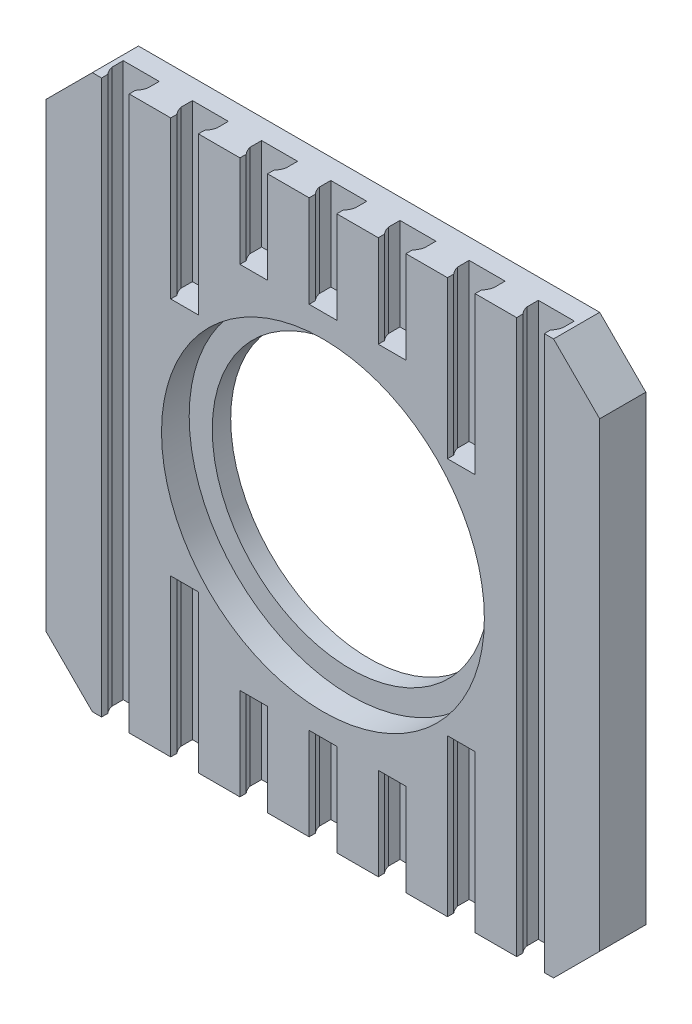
ISO-10303-21;
HEADER;
FILE_DESCRIPTION(('STEP AP214'),'2;1');
FILE_NAME('part.step','',(''),(''),'','','');
FILE_SCHEMA(('AUTOMOTIVE_DESIGN { 1 0 10303 214 1 1 1 1 }'));
ENDSEC;
DATA;
#1=APPLICATION_CONTEXT('core data for automotive mechanical design processes');
#2=APPLICATION_PROTOCOL_DEFINITION('international standard','automotive_design',2000,#1);
#3=PRODUCT_CONTEXT('',#1,'mechanical');
#4=PRODUCT('Part','Part','',(#3));
#5=PRODUCT_RELATED_PRODUCT_CATEGORY('part','',(#4));
#6=PRODUCT_DEFINITION_FORMATION('','',#4);
#7=PRODUCT_DEFINITION_CONTEXT('part definition',#1,'design');
#8=PRODUCT_DEFINITION('design','',#6,#7);
#9=PRODUCT_DEFINITION_SHAPE('','',#8);
#10=(LENGTH_UNIT() NAMED_UNIT(*) SI_UNIT(.MILLI.,.METRE.));
#11=(NAMED_UNIT(*) PLANE_ANGLE_UNIT() SI_UNIT($,.RADIAN.));
#12=(NAMED_UNIT(*) SI_UNIT($,.STERADIAN.) SOLID_ANGLE_UNIT());
#13=UNCERTAINTY_MEASURE_WITH_UNIT(LENGTH_MEASURE(1.E-05),#10,'distance_accuracy_value','');
#14=(GEOMETRIC_REPRESENTATION_CONTEXT(3) GLOBAL_UNCERTAINTY_ASSIGNED_CONTEXT((#13)) GLOBAL_UNIT_ASSIGNED_CONTEXT((#10,
#11,#12)) REPRESENTATION_CONTEXT('',''));
#15=CARTESIAN_POINT('',(0.,0.,0.));
#16=DIRECTION('',(0.,0.,1.));
#17=DIRECTION('',(1.,0.,0.));
#18=AXIS2_PLACEMENT_3D('',#15,#16,#17);
#19=CARTESIAN_POINT('',(-30.,-30.,5.));
#20=DIRECTION('',(0.,0.,1.));
#21=DIRECTION('',(1.,0.,0.));
#22=AXIS2_PLACEMENT_3D('',#19,#20,#21);
#23=PLANE('',#22);
#24=CARTESIAN_POINT('',(0.,0.,5.));
#25=DIRECTION('',(0.,0.,1.));
#26=DIRECTION('',(1.,0.,0.));
#27=AXIS2_PLACEMENT_3D('',#24,#25,#26);
#28=CIRCLE('',#27,17.5);
#29=CARTESIAN_POINT('',(17.5,0.,5.));
#30=VERTEX_POINT('',#29);
#31=EDGE_CURVE('E1473',#30,#30,#28,.T.);
#32=ORIENTED_EDGE('',*,*,#31,.F.);
#33=EDGE_LOOP('',(#32));
#34=FACE_BOUND('',#33,.T.);
#35=DIRECTION('',(0.,-1.,0.));
#36=VECTOR('',#35,1.);
#37=CARTESIAN_POINT('',(21.,45.001,5.));
#38=LINE('',#37,#36);
#39=CARTESIAN_POINT('',(21.,30.,5.));
#40=VERTEX_POINT('',#39);
#41=CARTESIAN_POINT('',(21.,-30.,5.));
#42=VERTEX_POINT('',#41);
#43=EDGE_CURVE('E1426',#40,#42,#38,.T.);
#44=ORIENTED_EDGE('',*,*,#43,.F.);
#45=DIRECTION('',(-1.,0.,0.));
#46=VECTOR('',#45,1.);
#47=CARTESIAN_POINT('',(-30.,30.,5.));
#48=LINE('',#47,#46);
#49=CARTESIAN_POINT('',(16.5,30.,5.));
#50=VERTEX_POINT('',#49);
#51=EDGE_CURVE('E698',#40,#50,#48,.T.);
#52=ORIENTED_EDGE('',*,*,#51,.T.);
#53=DIRECTION('',(0.,1.,0.));
#54=VECTOR('',#53,1.);
#55=CARTESIAN_POINT('',(16.5,13.,5.));
#56=LINE('',#55,#54);
#57=CARTESIAN_POINT('',(16.5,13.,5.));
#58=VERTEX_POINT('',#57);
#59=EDGE_CURVE('E1303',#58,#50,#56,.T.);
#60=ORIENTED_EDGE('',*,*,#59,.F.);
#61=DIRECTION('',(-1.,0.,0.));
#62=VECTOR('',#61,1.);
#63=CARTESIAN_POINT('',(13.5,13.,5.));
#64=LINE('',#63,#62);
#65=CARTESIAN_POINT('',(13.5,13.,5.));
#66=VERTEX_POINT('',#65);
#67=EDGE_CURVE('E1352',#58,#66,#64,.T.);
#68=ORIENTED_EDGE('',*,*,#67,.T.);
#69=DIRECTION('',(0.,1.,0.));
#70=VECTOR('',#69,1.);
#71=CARTESIAN_POINT('',(13.5,13.,5.));
#72=LINE('',#71,#70);
#73=CARTESIAN_POINT('',(13.5,30.,5.));
#74=VERTEX_POINT('',#73);
#75=EDGE_CURVE('E1306',#66,#74,#72,.T.);
#76=ORIENTED_EDGE('',*,*,#75,.T.);
#77=CARTESIAN_POINT('',(9.,30.,5.));
#78=VERTEX_POINT('',#77);
#79=EDGE_CURVE('E754',#74,#78,#48,.T.);
#80=ORIENTED_EDGE('',*,*,#79,.T.);
#81=DIRECTION('',(0.,1.,0.));
#82=VECTOR('',#81,1.);
#83=CARTESIAN_POINT('',(9.,20.,5.));
#84=LINE('',#83,#82);
#85=CARTESIAN_POINT('',(9.,20.,5.));
#86=VERTEX_POINT('',#85);
#87=EDGE_CURVE('E1014',#86,#78,#84,.T.);
#88=ORIENTED_EDGE('',*,*,#87,.F.);
#89=DIRECTION('',(-1.,0.,0.));
#90=VECTOR('',#89,1.);
#91=CARTESIAN_POINT('',(6.,20.,5.));
#92=LINE('',#91,#90);
#93=CARTESIAN_POINT('',(6.,20.,5.));
#94=VERTEX_POINT('',#93);
#95=EDGE_CURVE('E1051',#86,#94,#92,.T.);
#96=ORIENTED_EDGE('',*,*,#95,.T.);
#97=DIRECTION('',(0.,1.,0.));
#98=VECTOR('',#97,1.);
#99=CARTESIAN_POINT('',(6.,20.,5.));
#100=LINE('',#99,#98);
#101=CARTESIAN_POINT('',(6.,30.,5.));
#102=VERTEX_POINT('',#101);
#103=EDGE_CURVE('E1017',#94,#102,#100,.T.);
#104=ORIENTED_EDGE('',*,*,#103,.T.);
#105=CARTESIAN_POINT('',(1.5,30.,5.));
#106=VERTEX_POINT('',#105);
#107=EDGE_CURVE('E2048',#102,#106,#48,.T.);
#108=ORIENTED_EDGE('',*,*,#107,.T.);
#109=DIRECTION('',(0.,1.,0.));
#110=VECTOR('',#109,1.);
#111=CARTESIAN_POINT('',(1.5,20.,5.));
#112=LINE('',#111,#110);
#113=CARTESIAN_POINT('',(1.5,20.,5.));
#114=VERTEX_POINT('',#113);
#115=EDGE_CURVE('E956',#114,#106,#112,.T.);
#116=ORIENTED_EDGE('',*,*,#115,.F.);
#117=DIRECTION('',(-1.,0.,0.));
#118=VECTOR('',#117,1.);
#119=CARTESIAN_POINT('',(-1.5,20.,5.));
#120=LINE('',#119,#118);
#121=CARTESIAN_POINT('',(-1.5,20.,5.));
#122=VERTEX_POINT('',#121);
#123=EDGE_CURVE('E993',#114,#122,#120,.T.);
#124=ORIENTED_EDGE('',*,*,#123,.T.);
#125=DIRECTION('',(0.,1.,0.));
#126=VECTOR('',#125,1.);
#127=CARTESIAN_POINT('',(-1.5,20.,5.));
#128=LINE('',#127,#126);
#129=CARTESIAN_POINT('',(-1.5,30.,5.));
#130=VERTEX_POINT('',#129);
#131=EDGE_CURVE('E959',#122,#130,#128,.T.);
#132=ORIENTED_EDGE('',*,*,#131,.T.);
#133=CARTESIAN_POINT('',(-6.,30.,5.));
#134=VERTEX_POINT('',#133);
#135=EDGE_CURVE('E700',#130,#134,#48,.T.);
#136=ORIENTED_EDGE('',*,*,#135,.T.);
#137=DIRECTION('',(0.,1.,0.));
#138=VECTOR('',#137,1.);
#139=CARTESIAN_POINT('',(-6.,20.,5.));
#140=LINE('',#139,#138);
#141=CARTESIAN_POINT('',(-6.,20.,5.));
#142=VERTEX_POINT('',#141);
#143=EDGE_CURVE('E1072',#142,#134,#140,.T.);
#144=ORIENTED_EDGE('',*,*,#143,.F.);
#145=DIRECTION('',(-1.,0.,0.));
#146=VECTOR('',#145,1.);
#147=CARTESIAN_POINT('',(-9.,20.,5.));
#148=LINE('',#147,#146);
#149=CARTESIAN_POINT('',(-9.,20.,5.));
#150=VERTEX_POINT('',#149);
#151=EDGE_CURVE('E1108',#142,#150,#148,.T.);
#152=ORIENTED_EDGE('',*,*,#151,.T.);
#153=DIRECTION('',(0.,1.,0.));
#154=VECTOR('',#153,1.);
#155=CARTESIAN_POINT('',(-9.,20.,5.));
#156=LINE('',#155,#154);
#157=CARTESIAN_POINT('',(-9.,30.,5.));
#158=VERTEX_POINT('',#157);
#159=EDGE_CURVE('E1074',#150,#158,#156,.T.);
#160=ORIENTED_EDGE('',*,*,#159,.T.);
#161=CARTESIAN_POINT('',(-13.5,30.,5.));
#162=VERTEX_POINT('',#161);
#163=EDGE_CURVE('E2051',#158,#162,#48,.T.);
#164=ORIENTED_EDGE('',*,*,#163,.T.);
#165=DIRECTION('',(0.,1.,0.));
#166=VECTOR('',#165,1.);
#167=CARTESIAN_POINT('',(-13.5,13.,5.));
#168=LINE('',#167,#166);
#169=CARTESIAN_POINT('',(-13.5,13.,5.));
#170=VERTEX_POINT('',#169);
#171=EDGE_CURVE('E1246',#170,#162,#168,.T.);
#172=ORIENTED_EDGE('',*,*,#171,.F.);
#173=DIRECTION('',(-1.,0.,0.));
#174=VECTOR('',#173,1.);
#175=CARTESIAN_POINT('',(-16.5,13.,5.));
#176=LINE('',#175,#174);
#177=CARTESIAN_POINT('',(-16.5,13.,5.));
#178=VERTEX_POINT('',#177);
#179=EDGE_CURVE('E1294',#170,#178,#176,.T.);
#180=ORIENTED_EDGE('',*,*,#179,.T.);
#181=DIRECTION('',(0.,1.,0.));
#182=VECTOR('',#181,1.);
#183=CARTESIAN_POINT('',(-16.5,13.,5.));
#184=LINE('',#183,#182);
#185=CARTESIAN_POINT('',(-16.5,30.,5.));
#186=VERTEX_POINT('',#185);
#187=EDGE_CURVE('E1248',#178,#186,#184,.T.);
#188=ORIENTED_EDGE('',*,*,#187,.T.);
#189=CARTESIAN_POINT('',(-21.,30.,5.));
#190=VERTEX_POINT('',#189);
#191=EDGE_CURVE('E753',#186,#190,#48,.T.);
#192=ORIENTED_EDGE('',*,*,#191,.T.);
#193=DIRECTION('',(0.,-1.,0.));
#194=VECTOR('',#193,1.);
#195=CARTESIAN_POINT('',(-21.,45.001,5.));
#196=LINE('',#195,#194);
#197=CARTESIAN_POINT('',(-21.,-30.,5.));
#198=VERTEX_POINT('',#197);
#199=EDGE_CURVE('E1365',#190,#198,#196,.T.);
#200=ORIENTED_EDGE('',*,*,#199,.T.);
#201=DIRECTION('',(1.,0.,0.));
#202=VECTOR('',#201,1.);
#203=CARTESIAN_POINT('',(-30.,-30.,5.));
#204=LINE('',#203,#202);
#205=CARTESIAN_POINT('',(-16.5,-30.,5.));
#206=VERTEX_POINT('',#205);
#207=EDGE_CURVE('E755',#198,#206,#204,.T.);
#208=ORIENTED_EDGE('',*,*,#207,.T.);
#209=DIRECTION('',(0.,-1.,0.));
#210=VECTOR('',#209,1.);
#211=CARTESIAN_POINT('',(-16.5,-13.,5.));
#212=LINE('',#211,#210);
#213=CARTESIAN_POINT('',(-16.5,-13.,5.));
#214=VERTEX_POINT('',#213);
#215=EDGE_CURVE('E1128',#214,#206,#212,.T.);
#216=ORIENTED_EDGE('',*,*,#215,.F.);
#217=DIRECTION('',(-1.,0.,0.));
#218=VECTOR('',#217,1.);
#219=CARTESIAN_POINT('',(-16.5,-13.,5.));
#220=LINE('',#219,#218);
#221=CARTESIAN_POINT('',(-13.5,-13.,5.));
#222=VERTEX_POINT('',#221);
#223=EDGE_CURVE('E1175',#222,#214,#220,.T.);
#224=ORIENTED_EDGE('',*,*,#223,.F.);
#225=DIRECTION('',(0.,-1.,0.));
#226=VECTOR('',#225,1.);
#227=CARTESIAN_POINT('',(-13.5,-13.,5.));
#228=LINE('',#227,#226);
#229=CARTESIAN_POINT('',(-13.5,-30.,5.));
#230=VERTEX_POINT('',#229);
#231=EDGE_CURVE('E1124',#222,#230,#228,.T.);
#232=ORIENTED_EDGE('',*,*,#231,.T.);
#233=CARTESIAN_POINT('',(-9.,-30.,5.));
#234=VERTEX_POINT('',#233);
#235=EDGE_CURVE('E1937',#230,#234,#204,.T.);
#236=ORIENTED_EDGE('',*,*,#235,.T.);
#237=DIRECTION('',(0.,-1.,0.));
#238=VECTOR('',#237,1.);
#239=CARTESIAN_POINT('',(-9.,-20.,5.));
#240=LINE('',#239,#238);
#241=CARTESIAN_POINT('',(-9.,-20.,5.));
#242=VERTEX_POINT('',#241);
#243=EDGE_CURVE('E899',#242,#234,#240,.T.);
#244=ORIENTED_EDGE('',*,*,#243,.F.);
#245=DIRECTION('',(-1.,0.,0.));
#246=VECTOR('',#245,1.);
#247=CARTESIAN_POINT('',(-9.,-20.,5.));
#248=LINE('',#247,#246);
#249=CARTESIAN_POINT('',(-6.,-20.,5.));
#250=VERTEX_POINT('',#249);
#251=EDGE_CURVE('E932',#250,#242,#248,.T.);
#252=ORIENTED_EDGE('',*,*,#251,.F.);
#253=DIRECTION('',(0.,-1.,0.));
#254=VECTOR('',#253,1.);
#255=CARTESIAN_POINT('',(-6.,-20.,5.));
#256=LINE('',#255,#254);
#257=CARTESIAN_POINT('',(-6.,-30.,5.));
#258=VERTEX_POINT('',#257);
#259=EDGE_CURVE('E896',#250,#258,#256,.T.);
#260=ORIENTED_EDGE('',*,*,#259,.T.);
#261=CARTESIAN_POINT('',(-1.5,-30.,5.));
#262=VERTEX_POINT('',#261);
#263=EDGE_CURVE('E1931',#258,#262,#204,.T.);
#264=ORIENTED_EDGE('',*,*,#263,.T.);
#265=DIRECTION('',(0.,-1.,0.));
#266=VECTOR('',#265,1.);
#267=CARTESIAN_POINT('',(-1.5,-20.,5.));
#268=LINE('',#267,#266);
#269=CARTESIAN_POINT('',(-1.5,-20.,5.));
#270=VERTEX_POINT('',#269);
#271=EDGE_CURVE('E778',#270,#262,#268,.T.);
#272=ORIENTED_EDGE('',*,*,#271,.F.);
#273=DIRECTION('',(-1.,0.,0.));
#274=VECTOR('',#273,1.);
#275=CARTESIAN_POINT('',(-1.5,-20.,5.));
#276=LINE('',#275,#274);
#277=CARTESIAN_POINT('',(1.5,-20.,5.));
#278=VERTEX_POINT('',#277);
#279=EDGE_CURVE('E811',#278,#270,#276,.T.);
#280=ORIENTED_EDGE('',*,*,#279,.F.);
#281=DIRECTION('',(0.,-1.,0.));
#282=VECTOR('',#281,1.);
#283=CARTESIAN_POINT('',(1.5,-20.,5.));
#284=LINE('',#283,#282);
#285=CARTESIAN_POINT('',(1.5,-30.,5.));
#286=VERTEX_POINT('',#285);
#287=EDGE_CURVE('E775',#278,#286,#284,.T.);
#288=ORIENTED_EDGE('',*,*,#287,.T.);
#289=CARTESIAN_POINT('',(6.,-30.,5.));
#290=VERTEX_POINT('',#289);
#291=EDGE_CURVE('E757',#286,#290,#204,.T.);
#292=ORIENTED_EDGE('',*,*,#291,.T.);
#293=DIRECTION('',(0.,-1.,0.));
#294=VECTOR('',#293,1.);
#295=CARTESIAN_POINT('',(6.,-20.,5.));
#296=LINE('',#295,#294);
#297=CARTESIAN_POINT('',(6.,-20.,5.));
#298=VERTEX_POINT('',#297);
#299=EDGE_CURVE('E839',#298,#290,#296,.T.);
#300=ORIENTED_EDGE('',*,*,#299,.F.);
#301=DIRECTION('',(-1.,0.,0.));
#302=VECTOR('',#301,1.);
#303=CARTESIAN_POINT('',(6.,-20.,5.));
#304=LINE('',#303,#302);
#305=CARTESIAN_POINT('',(9.,-20.,5.));
#306=VERTEX_POINT('',#305);
#307=EDGE_CURVE('E871',#306,#298,#304,.T.);
#308=ORIENTED_EDGE('',*,*,#307,.F.);
#309=DIRECTION('',(0.,-1.,0.));
#310=VECTOR('',#309,1.);
#311=CARTESIAN_POINT('',(9.,-20.,5.));
#312=LINE('',#311,#310);
#313=CARTESIAN_POINT('',(9.,-30.,5.));
#314=VERTEX_POINT('',#313);
#315=EDGE_CURVE('E836',#306,#314,#312,.T.);
#316=ORIENTED_EDGE('',*,*,#315,.T.);
#317=CARTESIAN_POINT('',(13.5,-30.,5.));
#318=VERTEX_POINT('',#317);
#319=EDGE_CURVE('E1938',#314,#318,#204,.T.);
#320=ORIENTED_EDGE('',*,*,#319,.T.);
#321=DIRECTION('',(0.,-1.,0.));
#322=VECTOR('',#321,1.);
#323=CARTESIAN_POINT('',(13.5,-13.,5.));
#324=LINE('',#323,#322);
#325=CARTESIAN_POINT('',(13.5,-13.,5.));
#326=VERTEX_POINT('',#325);
#327=EDGE_CURVE('E1190',#326,#318,#324,.T.);
#328=ORIENTED_EDGE('',*,*,#327,.F.);
#329=DIRECTION('',(-1.,0.,0.));
#330=VECTOR('',#329,1.);
#331=CARTESIAN_POINT('',(13.5,-13.,5.));
#332=LINE('',#331,#330);
#333=CARTESIAN_POINT('',(16.5,-13.,5.));
#334=VERTEX_POINT('',#333);
#335=EDGE_CURVE('E1236',#334,#326,#332,.T.);
#336=ORIENTED_EDGE('',*,*,#335,.F.);
#337=DIRECTION('',(0.,-1.,0.));
#338=VECTOR('',#337,1.);
#339=CARTESIAN_POINT('',(16.5,-13.,5.));
#340=LINE('',#339,#338);
#341=CARTESIAN_POINT('',(16.5,-30.,5.));
#342=VERTEX_POINT('',#341);
#343=EDGE_CURVE('E1186',#334,#342,#340,.T.);
#344=ORIENTED_EDGE('',*,*,#343,.T.);
#345=EDGE_CURVE('E764',#342,#42,#204,.T.);
#346=ORIENTED_EDGE('',*,*,#345,.T.);
#347=EDGE_LOOP('',(#44,#52,#60,#68,#76,#80,#88,#96,#104,#108,#116,#124,#132,#136,#144,#152,#160,
#164,#172,#180,#188,#192,#200,#208,#216,#224,#232,#236,#244,#252,#260,#264,#272,#280,#288,#292,
#300,#308,#316,#320,#328,#336,#344,#346));
#348=FACE_BOUND('',#347,.T.);
#349=ADVANCED_FACE('F34',(#34,#348),#23,.T.);
#350=CARTESIAN_POINT('',(-24.,30.,5.));
#351=VERTEX_POINT('',#350);
#352=CARTESIAN_POINT('',(-25.,30.,5.));
#353=VERTEX_POINT('',#352);
#354=EDGE_CURVE('E749',#351,#353,#48,.T.);
#355=ORIENTED_EDGE('',*,*,#354,.T.);
#356=DIRECTION('',(0.707106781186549,0.707106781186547,0.));
#357=VECTOR('',#356,1.);
#358=CARTESIAN_POINT('',(-57.5,-2.49999999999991,5.));
#359=LINE('',#358,#357);
#360=CARTESIAN_POINT('',(-30.,25.,5.));
#361=VERTEX_POINT('',#360);
#362=EDGE_CURVE('E710',#353,#361,#359,.F.);
#363=ORIENTED_EDGE('',*,*,#362,.T.);
#364=DIRECTION('',(0.,-1.,0.));
#365=VECTOR('',#364,1.);
#366=CARTESIAN_POINT('',(-30.,30.,5.));
#367=LINE('',#366,#365);
#368=CARTESIAN_POINT('',(-30.,-25.,5.));
#369=VERTEX_POINT('',#368);
#370=EDGE_CURVE('E760',#361,#369,#367,.T.);
#371=ORIENTED_EDGE('',*,*,#370,.T.);
#372=DIRECTION('',(-0.707106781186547,0.707106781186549,0.));
#373=VECTOR('',#372,1.);
#374=CARTESIAN_POINT('',(-27.5,-27.5,5.));
#375=LINE('',#374,#373);
#376=CARTESIAN_POINT('',(-25.,-30.,5.));
#377=VERTEX_POINT('',#376);
#378=EDGE_CURVE('E693',#369,#377,#375,.F.);
#379=ORIENTED_EDGE('',*,*,#378,.T.);
#380=CARTESIAN_POINT('',(-24.,-30.,5.));
#381=VERTEX_POINT('',#380);
#382=EDGE_CURVE('E750',#377,#381,#204,.T.);
#383=ORIENTED_EDGE('',*,*,#382,.T.);
#384=DIRECTION('',(0.,-1.,0.));
#385=VECTOR('',#384,1.);
#386=CARTESIAN_POINT('',(-24.,45.001,5.));
#387=LINE('',#386,#385);
#388=EDGE_CURVE('E1369',#351,#381,#387,.T.);
#389=ORIENTED_EDGE('',*,*,#388,.F.);
#390=EDGE_LOOP('',(#355,#363,#371,#379,#383,#389));
#391=FACE_BOUND('',#390,.T.);
#392=ADVANCED_FACE('F1494',(#391),#23,.T.);
#393=CARTESIAN_POINT('',(-30.,30.,5.));
#394=DIRECTION('',(0.,-1.,0.));
#395=DIRECTION('',(0.,0.,-1.));
#396=AXIS2_PLACEMENT_3D('',#393,#394,#395);
#397=PLANE('',#396);
#398=DIRECTION('',(-1.,0.,0.));
#399=VECTOR('',#398,1.);
#400=CARTESIAN_POINT('',(-30.,30.,0.));
#401=LINE('',#400,#399);
#402=CARTESIAN_POINT('',(25.,30.,0.));
#403=VERTEX_POINT('',#402);
#404=CARTESIAN_POINT('',(-25.,30.,0.));
#405=VERTEX_POINT('',#404);
#406=EDGE_CURVE('E702',#403,#405,#401,.T.);
#407=ORIENTED_EDGE('',*,*,#406,.T.);
#408=DIRECTION('',(0.,0.,1.));
#409=VECTOR('',#408,1.);
#410=CARTESIAN_POINT('',(-25.,30.,5.));
#411=LINE('',#410,#409);
#412=EDGE_CURVE('E707',#405,#353,#411,.T.);
#413=ORIENTED_EDGE('',*,*,#412,.T.);
#414=ORIENTED_EDGE('',*,*,#354,.F.);
#415=DIRECTION('',(0.,0.,1.));
#416=VECTOR('',#415,1.);
#417=CARTESIAN_POINT('',(-24.,30.,5.));
#418=LINE('',#417,#416);
#419=CARTESIAN_POINT('',(-24.,30.,4.32287565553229));
#420=VERTEX_POINT('',#419);
#421=EDGE_CURVE('E1399',#420,#351,#418,.T.);
#422=ORIENTED_EDGE('',*,*,#421,.F.);
#423=CARTESIAN_POINT('',(-22.5,30.,3.));
#424=DIRECTION('',(0.,-1.,0.));
#425=DIRECTION('',(0.,0.,-1.));
#426=AXIS2_PLACEMENT_3D('',#423,#424,#425);
#427=CIRCLE('',#426,2.);
#428=CARTESIAN_POINT('',(-24.45,30.,3.44440972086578));
#429=VERTEX_POINT('',#428);
#430=EDGE_CURVE('E1401',#429,#420,#427,.F.);
#431=ORIENTED_EDGE('',*,*,#430,.F.);
#432=DIRECTION('',(0.,0.,1.));
#433=VECTOR('',#432,1.);
#434=CARTESIAN_POINT('',(-24.45,30.,2.2));
#435=LINE('',#434,#433);
#436=CARTESIAN_POINT('',(-24.45,30.,2.2));
#437=VERTEX_POINT('',#436);
#438=EDGE_CURVE('E1404',#437,#429,#435,.T.);
#439=ORIENTED_EDGE('',*,*,#438,.F.);
#440=DIRECTION('',(-1.,0.,0.));
#441=VECTOR('',#440,1.);
#442=CARTESIAN_POINT('',(-24.45,30.,2.2));
#443=LINE('',#442,#441);
#444=CARTESIAN_POINT('',(-20.55,30.,2.2));
#445=VERTEX_POINT('',#444);
#446=EDGE_CURVE('E1407',#445,#437,#443,.T.);
#447=ORIENTED_EDGE('',*,*,#446,.F.);
#448=DIRECTION('',(0.,0.,-1.));
#449=VECTOR('',#448,1.);
#450=CARTESIAN_POINT('',(-20.55,30.,2.2));
#451=LINE('',#450,#449);
#452=CARTESIAN_POINT('',(-20.55,30.,3.44440972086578));
#453=VERTEX_POINT('',#452);
#454=EDGE_CURVE('E1410',#453,#445,#451,.T.);
#455=ORIENTED_EDGE('',*,*,#454,.F.);
#456=CARTESIAN_POINT('',(-22.5,30.,3.));
#457=DIRECTION('',(0.,-1.,0.));
#458=DIRECTION('',(0.,0.,-1.));
#459=AXIS2_PLACEMENT_3D('',#456,#457,#458);
#460=CIRCLE('',#459,2.);
#461=CARTESIAN_POINT('',(-21.,30.,4.3228756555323));
#462=VERTEX_POINT('',#461);
#463=EDGE_CURVE('E1413',#462,#453,#460,.F.);
#464=ORIENTED_EDGE('',*,*,#463,.F.);
#465=DIRECTION('',(0.,0.,-1.));
#466=VECTOR('',#465,1.);
#467=CARTESIAN_POINT('',(-21.,30.,5.));
#468=LINE('',#467,#466);
#469=EDGE_CURVE('E1342',#190,#462,#468,.T.);
#470=ORIENTED_EDGE('',*,*,#469,.F.);
#471=ORIENTED_EDGE('',*,*,#191,.F.);
#472=DIRECTION('',(0.,0.,-1.));
#473=VECTOR('',#472,1.);
#474=CARTESIAN_POINT('',(-16.5,30.,5.));
#475=LINE('',#474,#473);
#476=CARTESIAN_POINT('',(-16.5,30.,4.32287565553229));
#477=VERTEX_POINT('',#476);
#478=EDGE_CURVE('E1275',#186,#477,#475,.T.);
#479=ORIENTED_EDGE('',*,*,#478,.T.);
#480=CARTESIAN_POINT('',(-15.,30.,3.));
#481=DIRECTION('',(0.,-1.,0.));
#482=DIRECTION('',(0.,0.,-1.));
#483=AXIS2_PLACEMENT_3D('',#480,#481,#482);
#484=CIRCLE('',#483,2.);
#485=CARTESIAN_POINT('',(-16.95,30.,3.44440972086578));
#486=VERTEX_POINT('',#485);
#487=EDGE_CURVE('E1272',#477,#486,#484,.T.);
#488=ORIENTED_EDGE('',*,*,#487,.T.);
#489=DIRECTION('',(0.,0.,-1.));
#490=VECTOR('',#489,1.);
#491=CARTESIAN_POINT('',(-16.95,30.,2.2));
#492=LINE('',#491,#490);
#493=CARTESIAN_POINT('',(-16.95,30.,2.2));
#494=VERTEX_POINT('',#493);
#495=EDGE_CURVE('E1269',#486,#494,#492,.T.);
#496=ORIENTED_EDGE('',*,*,#495,.T.);
#497=DIRECTION('',(1.,0.,0.));
#498=VECTOR('',#497,1.);
#499=CARTESIAN_POINT('',(-16.95,30.,2.2));
#500=LINE('',#499,#498);
#501=CARTESIAN_POINT('',(-13.05,30.,2.2));
#502=VERTEX_POINT('',#501);
#503=EDGE_CURVE('E1266',#494,#502,#500,.T.);
#504=ORIENTED_EDGE('',*,*,#503,.T.);
#505=DIRECTION('',(0.,0.,1.));
#506=VECTOR('',#505,1.);
#507=CARTESIAN_POINT('',(-13.05,30.,2.2));
#508=LINE('',#507,#506);
#509=CARTESIAN_POINT('',(-13.05,30.,3.44440972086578));
#510=VERTEX_POINT('',#509);
#511=EDGE_CURVE('E1262',#502,#510,#508,.T.);
#512=ORIENTED_EDGE('',*,*,#511,.T.);
#513=CARTESIAN_POINT('',(-15.,30.,3.));
#514=DIRECTION('',(0.,-1.,0.));
#515=DIRECTION('',(0.,0.,-1.));
#516=AXIS2_PLACEMENT_3D('',#513,#514,#515);
#517=CIRCLE('',#516,2.);
#518=CARTESIAN_POINT('',(-13.5,30.,4.3228756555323));
#519=VERTEX_POINT('',#518);
#520=EDGE_CURVE('E1281',#510,#519,#517,.T.);
#521=ORIENTED_EDGE('',*,*,#520,.T.);
#522=DIRECTION('',(0.,0.,1.));
#523=VECTOR('',#522,1.);
#524=CARTESIAN_POINT('',(-13.5,30.,5.));
#525=LINE('',#524,#523);
#526=EDGE_CURVE('E1278',#519,#162,#525,.T.);
#527=ORIENTED_EDGE('',*,*,#526,.T.);
#528=ORIENTED_EDGE('',*,*,#163,.F.);
#529=DIRECTION('',(0.,0.,-1.));
#530=VECTOR('',#529,1.);
#531=CARTESIAN_POINT('',(-9.,30.,5.));
#532=LINE('',#531,#530);
#533=CARTESIAN_POINT('',(-9.,30.,4.32287565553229));
#534=VERTEX_POINT('',#533);
#535=EDGE_CURVE('E1086',#158,#534,#532,.T.);
#536=ORIENTED_EDGE('',*,*,#535,.T.);
#537=CARTESIAN_POINT('',(-7.5,30.,3.));
#538=DIRECTION('',(0.,-1.,0.));
#539=DIRECTION('',(0.,0.,-1.));
#540=AXIS2_PLACEMENT_3D('',#537,#538,#539);
#541=CIRCLE('',#540,2.);
#542=CARTESIAN_POINT('',(-9.45,30.,3.44440972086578));
#543=VERTEX_POINT('',#542);
#544=EDGE_CURVE('E1082',#534,#543,#541,.T.);
#545=ORIENTED_EDGE('',*,*,#544,.T.);
#546=DIRECTION('',(0.,0.,-1.));
#547=VECTOR('',#546,1.);
#548=CARTESIAN_POINT('',(-9.45,30.,2.2));
#549=LINE('',#548,#547);
#550=CARTESIAN_POINT('',(-9.45,30.,2.2));
#551=VERTEX_POINT('',#550);
#552=EDGE_CURVE('E1101',#543,#551,#549,.T.);
#553=ORIENTED_EDGE('',*,*,#552,.T.);
#554=DIRECTION('',(1.,0.,0.));
#555=VECTOR('',#554,1.);
#556=CARTESIAN_POINT('',(-9.45,30.,2.2));
#557=LINE('',#556,#555);
#558=CARTESIAN_POINT('',(-5.55,30.,2.2));
#559=VERTEX_POINT('',#558);
#560=EDGE_CURVE('E1098',#551,#559,#557,.T.);
#561=ORIENTED_EDGE('',*,*,#560,.T.);
#562=DIRECTION('',(0.,0.,1.));
#563=VECTOR('',#562,1.);
#564=CARTESIAN_POINT('',(-5.55,30.,2.2));
#565=LINE('',#564,#563);
#566=CARTESIAN_POINT('',(-5.55,30.,3.44440972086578));
#567=VERTEX_POINT('',#566);
#568=EDGE_CURVE('E1095',#559,#567,#565,.T.);
#569=ORIENTED_EDGE('',*,*,#568,.T.);
#570=CARTESIAN_POINT('',(-7.5,30.,3.));
#571=DIRECTION('',(0.,-1.,0.));
#572=DIRECTION('',(0.,0.,-1.));
#573=AXIS2_PLACEMENT_3D('',#570,#571,#572);
#574=CIRCLE('',#573,2.);
#575=CARTESIAN_POINT('',(-6.,30.,4.3228756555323));
#576=VERTEX_POINT('',#575);
#577=EDGE_CURVE('E1092',#567,#576,#574,.T.);
#578=ORIENTED_EDGE('',*,*,#577,.T.);
#579=DIRECTION('',(0.,0.,1.));
#580=VECTOR('',#579,1.);
#581=CARTESIAN_POINT('',(-6.,30.,5.));
#582=LINE('',#581,#580);
#583=EDGE_CURVE('E1089',#576,#134,#582,.T.);
#584=ORIENTED_EDGE('',*,*,#583,.T.);
#585=ORIENTED_EDGE('',*,*,#135,.F.);
#586=DIRECTION('',(0.,0.,-1.));
#587=VECTOR('',#586,1.);
#588=CARTESIAN_POINT('',(-1.5,30.,5.));
#589=LINE('',#588,#587);
#590=CARTESIAN_POINT('',(-1.5,30.,4.32287565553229));
#591=VERTEX_POINT('',#590);
#592=EDGE_CURVE('E971',#130,#591,#589,.T.);
#593=ORIENTED_EDGE('',*,*,#592,.T.);
#594=CARTESIAN_POINT('',(0.,30.,3.));
#595=DIRECTION('',(0.,-1.,0.));
#596=DIRECTION('',(0.,0.,-1.));
#597=AXIS2_PLACEMENT_3D('',#594,#595,#596);
#598=CIRCLE('',#597,2.);
#599=CARTESIAN_POINT('',(-1.95,30.,3.44440972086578));
#600=VERTEX_POINT('',#599);
#601=EDGE_CURVE('E967',#591,#600,#598,.T.);
#602=ORIENTED_EDGE('',*,*,#601,.T.);
#603=DIRECTION('',(0.,0.,-1.));
#604=VECTOR('',#603,1.);
#605=CARTESIAN_POINT('',(-1.95,30.,2.2));
#606=LINE('',#605,#604);
#607=CARTESIAN_POINT('',(-1.95,30.,2.2));
#608=VERTEX_POINT('',#607);
#609=EDGE_CURVE('E986',#600,#608,#606,.T.);
#610=ORIENTED_EDGE('',*,*,#609,.T.);
#611=DIRECTION('',(1.,0.,0.));
#612=VECTOR('',#611,1.);
#613=CARTESIAN_POINT('',(-1.95,30.,2.2));
#614=LINE('',#613,#612);
#615=CARTESIAN_POINT('',(1.95,30.,2.2));
#616=VERTEX_POINT('',#615);
#617=EDGE_CURVE('E983',#608,#616,#614,.T.);
#618=ORIENTED_EDGE('',*,*,#617,.T.);
#619=DIRECTION('',(0.,0.,1.));
#620=VECTOR('',#619,1.);
#621=CARTESIAN_POINT('',(1.95,30.,2.2));
#622=LINE('',#621,#620);
#623=CARTESIAN_POINT('',(1.95,30.,3.44440972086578));
#624=VERTEX_POINT('',#623);
#625=EDGE_CURVE('E980',#616,#624,#622,.T.);
#626=ORIENTED_EDGE('',*,*,#625,.T.);
#627=CARTESIAN_POINT('',(0.,30.,3.));
#628=DIRECTION('',(0.,-1.,0.));
#629=DIRECTION('',(0.,0.,-1.));
#630=AXIS2_PLACEMENT_3D('',#627,#628,#629);
#631=CIRCLE('',#630,2.);
#632=CARTESIAN_POINT('',(1.5,30.,4.3228756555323));
#633=VERTEX_POINT('',#632);
#634=EDGE_CURVE('E977',#624,#633,#631,.T.);
#635=ORIENTED_EDGE('',*,*,#634,.T.);
#636=DIRECTION('',(0.,0.,1.));
#637=VECTOR('',#636,1.);
#638=CARTESIAN_POINT('',(1.5,30.,5.));
#639=LINE('',#638,#637);
#640=EDGE_CURVE('E974',#633,#106,#639,.T.);
#641=ORIENTED_EDGE('',*,*,#640,.T.);
#642=ORIENTED_EDGE('',*,*,#107,.F.);
#643=DIRECTION('',(0.,0.,-1.));
#644=VECTOR('',#643,1.);
#645=CARTESIAN_POINT('',(6.,30.,5.));
#646=LINE('',#645,#644);
#647=CARTESIAN_POINT('',(6.,30.,4.32287565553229));
#648=VERTEX_POINT('',#647);
#649=EDGE_CURVE('E1029',#102,#648,#646,.T.);
#650=ORIENTED_EDGE('',*,*,#649,.T.);
#651=CARTESIAN_POINT('',(7.5,30.,3.));
#652=DIRECTION('',(0.,-1.,0.));
#653=DIRECTION('',(0.,0.,-1.));
#654=AXIS2_PLACEMENT_3D('',#651,#652,#653);
#655=CIRCLE('',#654,2.);
#656=CARTESIAN_POINT('',(5.55,30.,3.44440972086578));
#657=VERTEX_POINT('',#656);
#658=EDGE_CURVE('E1025',#648,#657,#655,.T.);
#659=ORIENTED_EDGE('',*,*,#658,.T.);
#660=DIRECTION('',(0.,0.,-1.));
#661=VECTOR('',#660,1.);
#662=CARTESIAN_POINT('',(5.55,30.,2.2));
#663=LINE('',#662,#661);
#664=CARTESIAN_POINT('',(5.55,30.,2.2));
#665=VERTEX_POINT('',#664);
#666=EDGE_CURVE('E1044',#657,#665,#663,.T.);
#667=ORIENTED_EDGE('',*,*,#666,.T.);
#668=DIRECTION('',(1.,0.,0.));
#669=VECTOR('',#668,1.);
#670=CARTESIAN_POINT('',(5.55,30.,2.2));
#671=LINE('',#670,#669);
#672=CARTESIAN_POINT('',(9.45,30.,2.2));
#673=VERTEX_POINT('',#672);
#674=EDGE_CURVE('E1041',#665,#673,#671,.T.);
#675=ORIENTED_EDGE('',*,*,#674,.T.);
#676=DIRECTION('',(0.,0.,1.));
#677=VECTOR('',#676,1.);
#678=CARTESIAN_POINT('',(9.45,30.,2.2));
#679=LINE('',#678,#677);
#680=CARTESIAN_POINT('',(9.45,30.,3.44440972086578));
#681=VERTEX_POINT('',#680);
#682=EDGE_CURVE('E1038',#673,#681,#679,.T.);
#683=ORIENTED_EDGE('',*,*,#682,.T.);
#684=CARTESIAN_POINT('',(7.5,30.,3.));
#685=DIRECTION('',(0.,-1.,0.));
#686=DIRECTION('',(0.,0.,-1.));
#687=AXIS2_PLACEMENT_3D('',#684,#685,#686);
#688=CIRCLE('',#687,2.);
#689=CARTESIAN_POINT('',(9.,30.,4.3228756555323));
#690=VERTEX_POINT('',#689);
#691=EDGE_CURVE('E1035',#681,#690,#688,.T.);
#692=ORIENTED_EDGE('',*,*,#691,.T.);
#693=DIRECTION('',(0.,0.,1.));
#694=VECTOR('',#693,1.);
#695=CARTESIAN_POINT('',(9.,30.,5.));
#696=LINE('',#695,#694);
#697=EDGE_CURVE('E1032',#690,#78,#696,.T.);
#698=ORIENTED_EDGE('',*,*,#697,.T.);
#699=ORIENTED_EDGE('',*,*,#79,.F.);
#700=DIRECTION('',(0.,0.,-1.));
#701=VECTOR('',#700,1.);
#702=CARTESIAN_POINT('',(13.5,30.,5.));
#703=LINE('',#702,#701);
#704=CARTESIAN_POINT('',(13.5,30.,4.32287565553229));
#705=VERTEX_POINT('',#704);
#706=EDGE_CURVE('E1333',#74,#705,#703,.T.);
#707=ORIENTED_EDGE('',*,*,#706,.T.);
#708=CARTESIAN_POINT('',(15.,30.,3.));
#709=DIRECTION('',(0.,-1.,0.));
#710=DIRECTION('',(0.,0.,-1.));
#711=AXIS2_PLACEMENT_3D('',#708,#709,#710);
#712=CIRCLE('',#711,2.);
#713=CARTESIAN_POINT('',(13.05,30.,3.44440972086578));
#714=VERTEX_POINT('',#713);
#715=EDGE_CURVE('E1330',#705,#714,#712,.T.);
#716=ORIENTED_EDGE('',*,*,#715,.T.);
#717=DIRECTION('',(0.,0.,-1.));
#718=VECTOR('',#717,1.);
#719=CARTESIAN_POINT('',(13.05,30.,2.2));
#720=LINE('',#719,#718);
#721=CARTESIAN_POINT('',(13.05,30.,2.2));
#722=VERTEX_POINT('',#721);
#723=EDGE_CURVE('E1327',#714,#722,#720,.T.);
#724=ORIENTED_EDGE('',*,*,#723,.T.);
#725=DIRECTION('',(1.,0.,0.));
#726=VECTOR('',#725,1.);
#727=CARTESIAN_POINT('',(13.05,30.,2.2));
#728=LINE('',#727,#726);
#729=CARTESIAN_POINT('',(16.95,30.,2.2));
#730=VERTEX_POINT('',#729);
#731=EDGE_CURVE('E1324',#722,#730,#728,.T.);
#732=ORIENTED_EDGE('',*,*,#731,.T.);
#733=DIRECTION('',(0.,0.,1.));
#734=VECTOR('',#733,1.);
#735=CARTESIAN_POINT('',(16.95,30.,2.2));
#736=LINE('',#735,#734);
#737=CARTESIAN_POINT('',(16.95,30.,3.44440972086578));
#738=VERTEX_POINT('',#737);
#739=EDGE_CURVE('E1320',#730,#738,#736,.T.);
#740=ORIENTED_EDGE('',*,*,#739,.T.);
#741=CARTESIAN_POINT('',(15.,30.,3.));
#742=DIRECTION('',(0.,-1.,0.));
#743=DIRECTION('',(0.,0.,-1.));
#744=AXIS2_PLACEMENT_3D('',#741,#742,#743);
#745=CIRCLE('',#744,2.);
#746=CARTESIAN_POINT('',(16.5,30.,4.3228756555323));
#747=VERTEX_POINT('',#746);
#748=EDGE_CURVE('E1339',#738,#747,#745,.T.);
#749=ORIENTED_EDGE('',*,*,#748,.T.);
#750=DIRECTION('',(0.,0.,1.));
#751=VECTOR('',#750,1.);
#752=CARTESIAN_POINT('',(16.5,30.,5.));
#753=LINE('',#752,#751);
#754=EDGE_CURVE('E1336',#747,#50,#753,.T.);
#755=ORIENTED_EDGE('',*,*,#754,.T.);
#756=ORIENTED_EDGE('',*,*,#51,.F.);
#757=DIRECTION('',(0.,0.,1.));
#758=VECTOR('',#757,1.);
#759=CARTESIAN_POINT('',(21.,30.,5.));
#760=LINE('',#759,#758);
#761=CARTESIAN_POINT('',(21.,30.,4.32287565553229));
#762=VERTEX_POINT('',#761);
#763=EDGE_CURVE('E1455',#762,#40,#760,.T.);
#764=ORIENTED_EDGE('',*,*,#763,.F.);
#765=CARTESIAN_POINT('',(22.5,30.,3.));
#766=DIRECTION('',(0.,-1.,0.));
#767=DIRECTION('',(0.,0.,-1.));
#768=AXIS2_PLACEMENT_3D('',#765,#766,#767);
#769=CIRCLE('',#768,2.);
#770=CARTESIAN_POINT('',(20.55,30.,3.44440972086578));
#771=VERTEX_POINT('',#770);
#772=EDGE_CURVE('E1457',#771,#762,#769,.F.);
#773=ORIENTED_EDGE('',*,*,#772,.F.);
#774=DIRECTION('',(0.,0.,1.));
#775=VECTOR('',#774,1.);
#776=CARTESIAN_POINT('',(20.55,30.,2.2));
#777=LINE('',#776,#775);
#778=CARTESIAN_POINT('',(20.55,30.,2.2));
#779=VERTEX_POINT('',#778);
#780=EDGE_CURVE('E1460',#779,#771,#777,.T.);
#781=ORIENTED_EDGE('',*,*,#780,.F.);
#782=DIRECTION('',(-1.,0.,0.));
#783=VECTOR('',#782,1.);
#784=CARTESIAN_POINT('',(20.55,30.,2.2));
#785=LINE('',#784,#783);
#786=CARTESIAN_POINT('',(24.45,30.,2.2));
#787=VERTEX_POINT('',#786);
#788=EDGE_CURVE('E1463',#787,#779,#785,.T.);
#789=ORIENTED_EDGE('',*,*,#788,.F.);
#790=DIRECTION('',(0.,0.,-1.));
#791=VECTOR('',#790,1.);
#792=CARTESIAN_POINT('',(24.45,30.,2.2));
#793=LINE('',#792,#791);
#794=CARTESIAN_POINT('',(24.45,30.,3.44440972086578));
#795=VERTEX_POINT('',#794);
#796=EDGE_CURVE('E1466',#795,#787,#793,.T.);
#797=ORIENTED_EDGE('',*,*,#796,.F.);
#798=CARTESIAN_POINT('',(22.5,30.,3.));
#799=DIRECTION('',(0.,-1.,0.));
#800=DIRECTION('',(0.,0.,-1.));
#801=AXIS2_PLACEMENT_3D('',#798,#799,#800);
#802=CIRCLE('',#801,2.);
#803=CARTESIAN_POINT('',(24.,30.,4.3228756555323));
#804=VERTEX_POINT('',#803);
#805=EDGE_CURVE('E1469',#804,#795,#802,.F.);
#806=ORIENTED_EDGE('',*,*,#805,.F.);
#807=DIRECTION('',(0.,0.,-1.));
#808=VECTOR('',#807,1.);
#809=CARTESIAN_POINT('',(24.,30.,5.));
#810=LINE('',#809,#808);
#811=CARTESIAN_POINT('',(24.,30.,5.));
#812=VERTEX_POINT('',#811);
#813=EDGE_CURVE('E1416',#812,#804,#810,.T.);
#814=ORIENTED_EDGE('',*,*,#813,.F.);
#815=CARTESIAN_POINT('',(25.,30.,5.));
#816=VERTEX_POINT('',#815);
#817=EDGE_CURVE('E694',#816,#812,#48,.T.);
#818=ORIENTED_EDGE('',*,*,#817,.F.);
#819=DIRECTION('',(0.,0.,-1.));
#820=VECTOR('',#819,1.);
#821=CARTESIAN_POINT('',(25.,30.,5.));
#822=LINE('',#821,#820);
#823=EDGE_CURVE('E696',#816,#403,#822,.T.);
#824=ORIENTED_EDGE('',*,*,#823,.T.);
#825=EDGE_LOOP('',(#407,#413,#414,#422,#431,#439,#447,#455,#464,#470,#471,#479,#488,#496,#504,
#512,#521,#527,#528,#536,#545,#553,#561,#569,#578,#584,#585,#593,#602,#610,#618,#626,#635,#641,
#642,#650,#659,#667,#675,#683,#692,#698,#699,#707,#716,#724,#732,#740,#749,#755,#756,#764,#773,
#781,#789,#797,#806,#814,#818,#824));
#826=FACE_BOUND('',#825,.T.);
#827=ADVANCED_FACE('F1500',(#826),#397,.F.);
#828=DIRECTION('',(0.,1.,0.));
#829=VECTOR('',#828,1.);
#830=CARTESIAN_POINT('',(30.,30.,5.));
#831=LINE('',#830,#829);
#832=CARTESIAN_POINT('',(30.,-25.,5.));
#833=VERTEX_POINT('',#832);
#834=CARTESIAN_POINT('',(30.,25.,5.));
#835=VERTEX_POINT('',#834);
#836=EDGE_CURVE('E742',#833,#835,#831,.T.);
#837=ORIENTED_EDGE('',*,*,#836,.T.);
#838=DIRECTION('',(0.707106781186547,-0.707106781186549,0.));
#839=VECTOR('',#838,1.);
#840=CARTESIAN_POINT('',(27.5000000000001,27.4999999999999,5.));
#841=LINE('',#840,#839);
#842=EDGE_CURVE('E719',#835,#816,#841,.F.);
#843=ORIENTED_EDGE('',*,*,#842,.T.);
#844=ORIENTED_EDGE('',*,*,#817,.T.);
#845=DIRECTION('',(0.,-1.,0.));
#846=VECTOR('',#845,1.);
#847=CARTESIAN_POINT('',(24.,45.001,5.));
#848=LINE('',#847,#846);
#849=CARTESIAN_POINT('',(24.,-30.,5.));
#850=VERTEX_POINT('',#849);
#851=EDGE_CURVE('E1423',#812,#850,#848,.T.);
#852=ORIENTED_EDGE('',*,*,#851,.T.);
#853=CARTESIAN_POINT('',(25.,-30.,5.));
#854=VERTEX_POINT('',#853);
#855=EDGE_CURVE('E745',#850,#854,#204,.T.);
#856=ORIENTED_EDGE('',*,*,#855,.T.);
#857=DIRECTION('',(-0.707106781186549,-0.707106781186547,0.));
#858=VECTOR('',#857,1.);
#859=CARTESIAN_POINT('',(-2.50000000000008,-57.5,5.));
#860=LINE('',#859,#858);
#861=EDGE_CURVE('E717',#854,#833,#860,.F.);
#862=ORIENTED_EDGE('',*,*,#861,.T.);
#863=EDGE_LOOP('',(#837,#843,#844,#852,#856,#862));
#864=FACE_BOUND('',#863,.T.);
#865=ADVANCED_FACE('F741',(#864),#23,.T.);
#866=CARTESIAN_POINT('',(-30.,30.,5.));
#867=DIRECTION('',(1.,0.,0.));
#868=DIRECTION('',(0.,1.,0.));
#869=AXIS2_PLACEMENT_3D('',#866,#867,#868);
#870=PLANE('',#869);
#871=ORIENTED_EDGE('',*,*,#370,.F.);
#872=DIRECTION('',(0.,0.,-1.));
#873=VECTOR('',#872,1.);
#874=CARTESIAN_POINT('',(-30.,25.,5.));
#875=LINE('',#874,#873);
#876=CARTESIAN_POINT('',(-30.,25.,0.));
#877=VERTEX_POINT('',#876);
#878=EDGE_CURVE('E689',#361,#877,#875,.T.);
#879=ORIENTED_EDGE('',*,*,#878,.T.);
#880=DIRECTION('',(0.,-1.,0.));
#881=VECTOR('',#880,1.);
#882=CARTESIAN_POINT('',(-30.,30.,0.));
#883=LINE('',#882,#881);
#884=CARTESIAN_POINT('',(-30.,-25.,0.));
#885=VERTEX_POINT('',#884);
#886=EDGE_CURVE('E676',#877,#885,#883,.T.);
#887=ORIENTED_EDGE('',*,*,#886,.T.);
#888=DIRECTION('',(0.,0.,1.));
#889=VECTOR('',#888,1.);
#890=CARTESIAN_POINT('',(-30.,-25.,5.));
#891=LINE('',#890,#889);
#892=EDGE_CURVE('E686',#885,#369,#891,.T.);
#893=ORIENTED_EDGE('',*,*,#892,.T.);
#894=EDGE_LOOP('',(#871,#879,#887,#893));
#895=FACE_BOUND('',#894,.T.);
#896=ADVANCED_FACE('F685',(#895),#870,.F.);
#897=CARTESIAN_POINT('',(-30.,-30.,5.));
#898=DIRECTION('',(0.,1.,0.));
#899=DIRECTION('',(0.,0.,1.));
#900=AXIS2_PLACEMENT_3D('',#897,#898,#899);
#901=PLANE('',#900);
#902=DIRECTION('',(1.,0.,0.));
#903=VECTOR('',#902,1.);
#904=CARTESIAN_POINT('',(-30.,-30.,0.));
#905=LINE('',#904,#903);
#906=CARTESIAN_POINT('',(-25.,-30.,0.));
#907=VERTEX_POINT('',#906);
#908=CARTESIAN_POINT('',(25.,-30.,0.));
#909=VERTEX_POINT('',#908);
#910=EDGE_CURVE('E49',#907,#909,#905,.T.);
#911=ORIENTED_EDGE('',*,*,#910,.T.);
#912=DIRECTION('',(0.,0.,1.));
#913=VECTOR('',#912,1.);
#914=CARTESIAN_POINT('',(25.,-30.,5.));
#915=LINE('',#914,#913);
#916=EDGE_CURVE('E56',#909,#854,#915,.T.);
#917=ORIENTED_EDGE('',*,*,#916,.T.);
#918=ORIENTED_EDGE('',*,*,#855,.F.);
#919=DIRECTION('',(0.,0.,1.));
#920=VECTOR('',#919,1.);
#921=CARTESIAN_POINT('',(24.,-30.,5.));
#922=LINE('',#921,#920);
#923=CARTESIAN_POINT('',(24.,-30.,4.3228756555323));
#924=VERTEX_POINT('',#923);
#925=EDGE_CURVE('E1451',#924,#850,#922,.T.);
#926=ORIENTED_EDGE('',*,*,#925,.F.);
#927=CARTESIAN_POINT('',(22.5,-30.,3.));
#928=DIRECTION('',(0.,-1.,0.));
#929=DIRECTION('',(0.,0.,-1.));
#930=AXIS2_PLACEMENT_3D('',#927,#928,#929);
#931=CIRCLE('',#930,2.);
#932=CARTESIAN_POINT('',(24.45,-30.,3.44440972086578));
#933=VERTEX_POINT('',#932);
#934=EDGE_CURVE('E1453',#933,#924,#931,.T.);
#935=ORIENTED_EDGE('',*,*,#934,.F.);
#936=DIRECTION('',(0.,0.,1.));
#937=VECTOR('',#936,1.);
#938=CARTESIAN_POINT('',(24.45,-30.,2.2));
#939=LINE('',#938,#937);
#940=CARTESIAN_POINT('',(24.45,-30.,2.2));
#941=VERTEX_POINT('',#940);
#942=EDGE_CURVE('E1424',#941,#933,#939,.T.);
#943=ORIENTED_EDGE('',*,*,#942,.F.);
#944=DIRECTION('',(1.,0.,0.));
#945=VECTOR('',#944,1.);
#946=CARTESIAN_POINT('',(20.55,-30.,2.2));
#947=LINE('',#946,#945);
#948=CARTESIAN_POINT('',(20.55,-30.,2.2));
#949=VERTEX_POINT('',#948);
#950=EDGE_CURVE('E1439',#949,#941,#947,.T.);
#951=ORIENTED_EDGE('',*,*,#950,.F.);
#952=DIRECTION('',(0.,0.,-1.));
#953=VECTOR('',#952,1.);
#954=CARTESIAN_POINT('',(20.55,-30.,2.2));
#955=LINE('',#954,#953);
#956=CARTESIAN_POINT('',(20.55,-30.,3.44440972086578));
#957=VERTEX_POINT('',#956);
#958=EDGE_CURVE('E1442',#957,#949,#955,.T.);
#959=ORIENTED_EDGE('',*,*,#958,.F.);
#960=CARTESIAN_POINT('',(22.5,-30.,3.));
#961=DIRECTION('',(0.,-1.,0.));
#962=DIRECTION('',(0.,0.,-1.));
#963=AXIS2_PLACEMENT_3D('',#960,#961,#962);
#964=CIRCLE('',#963,2.);
#965=CARTESIAN_POINT('',(21.,-30.,4.32287565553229));
#966=VERTEX_POINT('',#965);
#967=EDGE_CURVE('E1445',#966,#957,#964,.T.);
#968=ORIENTED_EDGE('',*,*,#967,.F.);
#969=DIRECTION('',(0.,0.,-1.));
#970=VECTOR('',#969,1.);
#971=CARTESIAN_POINT('',(21.,-30.,5.));
#972=LINE('',#971,#970);
#973=EDGE_CURVE('E1448',#42,#966,#972,.T.);
#974=ORIENTED_EDGE('',*,*,#973,.F.);
#975=ORIENTED_EDGE('',*,*,#345,.F.);
#976=DIRECTION('',(0.,0.,1.));
#977=VECTOR('',#976,1.);
#978=CARTESIAN_POINT('',(16.5,-30.,5.));
#979=LINE('',#978,#977);
#980=CARTESIAN_POINT('',(16.5,-30.,4.3228756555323));
#981=VERTEX_POINT('',#980);
#982=EDGE_CURVE('E1217',#981,#342,#979,.T.);
#983=ORIENTED_EDGE('',*,*,#982,.F.);
#984=CARTESIAN_POINT('',(15.,-30.,3.));
#985=DIRECTION('',(0.,-1.,0.));
#986=DIRECTION('',(0.,0.,-1.));
#987=AXIS2_PLACEMENT_3D('',#984,#985,#986);
#988=CIRCLE('',#987,2.);
#989=CARTESIAN_POINT('',(16.95,-30.,3.44440972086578));
#990=VERTEX_POINT('',#989);
#991=EDGE_CURVE('E1219',#990,#981,#988,.T.);
#992=ORIENTED_EDGE('',*,*,#991,.F.);
#993=DIRECTION('',(0.,0.,1.));
#994=VECTOR('',#993,1.);
#995=CARTESIAN_POINT('',(16.95,-30.,2.2));
#996=LINE('',#995,#994);
#997=CARTESIAN_POINT('',(16.95,-30.,2.2));
#998=VERTEX_POINT('',#997);
#999=EDGE_CURVE('E1201',#998,#990,#996,.T.);
#1000=ORIENTED_EDGE('',*,*,#999,.F.);
#1001=DIRECTION('',(1.,0.,0.));
#1002=VECTOR('',#1001,1.);
#1003=CARTESIAN_POINT('',(13.05,-30.,2.2));
#1004=LINE('',#1003,#1002);
#1005=CARTESIAN_POINT('',(13.05,-30.,2.2));
#1006=VERTEX_POINT('',#1005);
#1007=EDGE_CURVE('E1205',#1006,#998,#1004,.T.);
#1008=ORIENTED_EDGE('',*,*,#1007,.F.);
#1009=DIRECTION('',(0.,0.,-1.));
#1010=VECTOR('',#1009,1.);
#1011=CARTESIAN_POINT('',(13.05,-30.,2.2));
#1012=LINE('',#1011,#1010);
#1013=CARTESIAN_POINT('',(13.05,-30.,3.44440972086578));
#1014=VERTEX_POINT('',#1013);
#1015=EDGE_CURVE('E1208',#1014,#1006,#1012,.T.);
#1016=ORIENTED_EDGE('',*,*,#1015,.F.);
#1017=CARTESIAN_POINT('',(15.,-30.,3.));
#1018=DIRECTION('',(0.,-1.,0.));
#1019=DIRECTION('',(0.,0.,-1.));
#1020=AXIS2_PLACEMENT_3D('',#1017,#1018,#1019);
#1021=CIRCLE('',#1020,2.);
#1022=CARTESIAN_POINT('',(13.5,-30.,4.32287565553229));
#1023=VERTEX_POINT('',#1022);
#1024=EDGE_CURVE('E1211',#1023,#1014,#1021,.T.);
#1025=ORIENTED_EDGE('',*,*,#1024,.F.);
#1026=DIRECTION('',(0.,0.,-1.));
#1027=VECTOR('',#1026,1.);
#1028=CARTESIAN_POINT('',(13.5,-30.,5.));
#1029=LINE('',#1028,#1027);
#1030=EDGE_CURVE('E1214',#318,#1023,#1029,.T.);
#1031=ORIENTED_EDGE('',*,*,#1030,.F.);
#1032=ORIENTED_EDGE('',*,*,#319,.F.);
#1033=DIRECTION('',(0.,0.,1.));
#1034=VECTOR('',#1033,1.);
#1035=CARTESIAN_POINT('',(9.,-30.,5.));
#1036=LINE('',#1035,#1034);
#1037=CARTESIAN_POINT('',(9.,-30.,4.3228756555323));
#1038=VERTEX_POINT('',#1037);
#1039=EDGE_CURVE('E851',#1038,#314,#1036,.T.);
#1040=ORIENTED_EDGE('',*,*,#1039,.F.);
#1041=CARTESIAN_POINT('',(7.5,-30.,3.));
#1042=DIRECTION('',(0.,-1.,0.));
#1043=DIRECTION('',(0.,0.,-1.));
#1044=AXIS2_PLACEMENT_3D('',#1041,#1042,#1043);
#1045=CIRCLE('',#1044,2.);
#1046=CARTESIAN_POINT('',(9.45,-30.,3.44440972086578));
#1047=VERTEX_POINT('',#1046);
#1048=EDGE_CURVE('E853',#1047,#1038,#1045,.T.);
#1049=ORIENTED_EDGE('',*,*,#1048,.F.);
#1050=DIRECTION('',(0.,0.,1.));
#1051=VECTOR('',#1050,1.);
#1052=CARTESIAN_POINT('',(9.45,-30.,2.2));
#1053=LINE('',#1052,#1051);
#1054=CARTESIAN_POINT('',(9.45,-30.,2.2));
#1055=VERTEX_POINT('',#1054);
#1056=EDGE_CURVE('E856',#1055,#1047,#1053,.T.);
#1057=ORIENTED_EDGE('',*,*,#1056,.F.);
#1058=DIRECTION('',(1.,0.,0.));
#1059=VECTOR('',#1058,1.);
#1060=CARTESIAN_POINT('',(5.55,-30.,2.2));
#1061=LINE('',#1060,#1059);
#1062=CARTESIAN_POINT('',(5.55,-30.,2.2));
#1063=VERTEX_POINT('',#1062);
#1064=EDGE_CURVE('E859',#1063,#1055,#1061,.T.);
#1065=ORIENTED_EDGE('',*,*,#1064,.F.);
#1066=DIRECTION('',(0.,0.,-1.));
#1067=VECTOR('',#1066,1.);
#1068=CARTESIAN_POINT('',(5.55,-30.,2.2));
#1069=LINE('',#1068,#1067);
#1070=CARTESIAN_POINT('',(5.55,-30.,3.44440972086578));
#1071=VERTEX_POINT('',#1070);
#1072=EDGE_CURVE('E862',#1071,#1063,#1069,.T.);
#1073=ORIENTED_EDGE('',*,*,#1072,.F.);
#1074=CARTESIAN_POINT('',(7.5,-30.,3.));
#1075=DIRECTION('',(0.,-1.,0.));
#1076=DIRECTION('',(0.,0.,-1.));
#1077=AXIS2_PLACEMENT_3D('',#1074,#1075,#1076);
#1078=CIRCLE('',#1077,2.);
#1079=CARTESIAN_POINT('',(6.,-30.,4.32287565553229));
#1080=VERTEX_POINT('',#1079);
#1081=EDGE_CURVE('E844',#1080,#1071,#1078,.T.);
#1082=ORIENTED_EDGE('',*,*,#1081,.F.);
#1083=DIRECTION('',(0.,0.,-1.));
#1084=VECTOR('',#1083,1.);
#1085=CARTESIAN_POINT('',(6.,-30.,5.));
#1086=LINE('',#1085,#1084);
#1087=EDGE_CURVE('E848',#290,#1080,#1086,.T.);
#1088=ORIENTED_EDGE('',*,*,#1087,.F.);
#1089=ORIENTED_EDGE('',*,*,#291,.F.);
#1090=DIRECTION('',(0.,0.,1.));
#1091=VECTOR('',#1090,1.);
#1092=CARTESIAN_POINT('',(1.5,-30.,5.));
#1093=LINE('',#1092,#1091);
#1094=CARTESIAN_POINT('',(1.5,-30.,4.3228756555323));
#1095=VERTEX_POINT('',#1094);
#1096=EDGE_CURVE('E791',#1095,#286,#1093,.T.);
#1097=ORIENTED_EDGE('',*,*,#1096,.F.);
#1098=CARTESIAN_POINT('',(0.,-30.,3.));
#1099=DIRECTION('',(0.,-1.,0.));
#1100=DIRECTION('',(0.,0.,-1.));
#1101=AXIS2_PLACEMENT_3D('',#1098,#1099,#1100);
#1102=CIRCLE('',#1101,2.);
#1103=CARTESIAN_POINT('',(1.95,-30.,3.44440972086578));
#1104=VERTEX_POINT('',#1103);
#1105=EDGE_CURVE('E793',#1104,#1095,#1102,.T.);
#1106=ORIENTED_EDGE('',*,*,#1105,.F.);
#1107=DIRECTION('',(0.,0.,1.));
#1108=VECTOR('',#1107,1.);
#1109=CARTESIAN_POINT('',(1.95,-30.,2.2));
#1110=LINE('',#1109,#1108);
#1111=CARTESIAN_POINT('',(1.95,-30.,2.2));
#1112=VERTEX_POINT('',#1111);
#1113=EDGE_CURVE('E796',#1112,#1104,#1110,.T.);
#1114=ORIENTED_EDGE('',*,*,#1113,.F.);
#1115=DIRECTION('',(1.,0.,0.));
#1116=VECTOR('',#1115,1.);
#1117=CARTESIAN_POINT('',(-1.95,-30.,2.2));
#1118=LINE('',#1117,#1116);
#1119=CARTESIAN_POINT('',(-1.95,-30.,2.2));
#1120=VERTEX_POINT('',#1119);
#1121=EDGE_CURVE('E799',#1120,#1112,#1118,.T.);
#1122=ORIENTED_EDGE('',*,*,#1121,.F.);
#1123=DIRECTION('',(0.,0.,-1.));
#1124=VECTOR('',#1123,1.);
#1125=CARTESIAN_POINT('',(-1.95,-30.,2.2));
#1126=LINE('',#1125,#1124);
#1127=CARTESIAN_POINT('',(-1.95,-30.,3.44440972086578));
#1128=VERTEX_POINT('',#1127);
#1129=EDGE_CURVE('E802',#1128,#1120,#1126,.T.);
#1130=ORIENTED_EDGE('',*,*,#1129,.F.);
#1131=CARTESIAN_POINT('',(0.,-30.,3.));
#1132=DIRECTION('',(0.,-1.,0.));
#1133=DIRECTION('',(0.,0.,-1.));
#1134=AXIS2_PLACEMENT_3D('',#1131,#1132,#1133);
#1135=CIRCLE('',#1134,2.);
#1136=CARTESIAN_POINT('',(-1.5,-30.,4.32287565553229));
#1137=VERTEX_POINT('',#1136);
#1138=EDGE_CURVE('E784',#1137,#1128,#1135,.T.);
#1139=ORIENTED_EDGE('',*,*,#1138,.F.);
#1140=DIRECTION('',(0.,0.,-1.));
#1141=VECTOR('',#1140,1.);
#1142=CARTESIAN_POINT('',(-1.5,-30.,5.));
#1143=LINE('',#1142,#1141);
#1144=EDGE_CURVE('E788',#262,#1137,#1143,.T.);
#1145=ORIENTED_EDGE('',*,*,#1144,.F.);
#1146=ORIENTED_EDGE('',*,*,#263,.F.);
#1147=DIRECTION('',(0.,0.,1.));
#1148=VECTOR('',#1147,1.);
#1149=CARTESIAN_POINT('',(-6.,-30.,5.));
#1150=LINE('',#1149,#1148);
#1151=CARTESIAN_POINT('',(-6.,-30.,4.3228756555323));
#1152=VERTEX_POINT('',#1151);
#1153=EDGE_CURVE('E912',#1152,#258,#1150,.T.);
#1154=ORIENTED_EDGE('',*,*,#1153,.F.);
#1155=CARTESIAN_POINT('',(-7.5,-30.,3.));
#1156=DIRECTION('',(0.,-1.,0.));
#1157=DIRECTION('',(0.,0.,-1.));
#1158=AXIS2_PLACEMENT_3D('',#1155,#1156,#1157);
#1159=CIRCLE('',#1158,2.);
#1160=CARTESIAN_POINT('',(-5.55,-30.,3.44440972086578));
#1161=VERTEX_POINT('',#1160);
#1162=EDGE_CURVE('E914',#1161,#1152,#1159,.T.);
#1163=ORIENTED_EDGE('',*,*,#1162,.F.);
#1164=DIRECTION('',(0.,0.,1.));
#1165=VECTOR('',#1164,1.);
#1166=CARTESIAN_POINT('',(-5.55,-30.,2.2));
#1167=LINE('',#1166,#1165);
#1168=CARTESIAN_POINT('',(-5.55,-30.,2.2));
#1169=VERTEX_POINT('',#1168);
#1170=EDGE_CURVE('E917',#1169,#1161,#1167,.T.);
#1171=ORIENTED_EDGE('',*,*,#1170,.F.);
#1172=DIRECTION('',(1.,0.,0.));
#1173=VECTOR('',#1172,1.);
#1174=CARTESIAN_POINT('',(-9.45,-30.,2.2));
#1175=LINE('',#1174,#1173);
#1176=CARTESIAN_POINT('',(-9.45,-30.,2.2));
#1177=VERTEX_POINT('',#1176);
#1178=EDGE_CURVE('E920',#1177,#1169,#1175,.T.);
#1179=ORIENTED_EDGE('',*,*,#1178,.F.);
#1180=DIRECTION('',(0.,0.,-1.));
#1181=VECTOR('',#1180,1.);
#1182=CARTESIAN_POINT('',(-9.45,-30.,2.2));
#1183=LINE('',#1182,#1181);
#1184=CARTESIAN_POINT('',(-9.45,-30.,3.44440972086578));
#1185=VERTEX_POINT('',#1184);
#1186=EDGE_CURVE('E923',#1185,#1177,#1183,.T.);
#1187=ORIENTED_EDGE('',*,*,#1186,.F.);
#1188=CARTESIAN_POINT('',(-7.5,-30.,3.));
#1189=DIRECTION('',(0.,-1.,0.));
#1190=DIRECTION('',(0.,0.,-1.));
#1191=AXIS2_PLACEMENT_3D('',#1188,#1189,#1190);
#1192=CIRCLE('',#1191,2.);
#1193=CARTESIAN_POINT('',(-9.,-30.,4.32287565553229));
#1194=VERTEX_POINT('',#1193);
#1195=EDGE_CURVE('E905',#1194,#1185,#1192,.T.);
#1196=ORIENTED_EDGE('',*,*,#1195,.F.);
#1197=DIRECTION('',(0.,0.,-1.));
#1198=VECTOR('',#1197,1.);
#1199=CARTESIAN_POINT('',(-9.,-30.,5.));
#1200=LINE('',#1199,#1198);
#1201=EDGE_CURVE('E909',#234,#1194,#1200,.T.);
#1202=ORIENTED_EDGE('',*,*,#1201,.F.);
#1203=ORIENTED_EDGE('',*,*,#235,.F.);
#1204=DIRECTION('',(0.,0.,1.));
#1205=VECTOR('',#1204,1.);
#1206=CARTESIAN_POINT('',(-13.5,-30.,5.));
#1207=LINE('',#1206,#1205);
#1208=CARTESIAN_POINT('',(-13.5,-30.,4.3228756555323));
#1209=VERTEX_POINT('',#1208);
#1210=EDGE_CURVE('E1156',#1209,#230,#1207,.T.);
#1211=ORIENTED_EDGE('',*,*,#1210,.F.);
#1212=CARTESIAN_POINT('',(-15.,-30.,3.));
#1213=DIRECTION('',(0.,-1.,0.));
#1214=DIRECTION('',(0.,0.,-1.));
#1215=AXIS2_PLACEMENT_3D('',#1212,#1213,#1214);
#1216=CIRCLE('',#1215,2.);
#1217=CARTESIAN_POINT('',(-13.05,-30.,3.44440972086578));
#1218=VERTEX_POINT('',#1217);
#1219=EDGE_CURVE('E1158',#1218,#1209,#1216,.T.);
#1220=ORIENTED_EDGE('',*,*,#1219,.F.);
#1221=DIRECTION('',(0.,0.,1.));
#1222=VECTOR('',#1221,1.);
#1223=CARTESIAN_POINT('',(-13.05,-30.,2.2));
#1224=LINE('',#1223,#1222);
#1225=CARTESIAN_POINT('',(-13.05,-30.,2.2));
#1226=VERTEX_POINT('',#1225);
#1227=EDGE_CURVE('E1140',#1226,#1218,#1224,.T.);
#1228=ORIENTED_EDGE('',*,*,#1227,.F.);
#1229=DIRECTION('',(1.,0.,0.));
#1230=VECTOR('',#1229,1.);
#1231=CARTESIAN_POINT('',(-16.95,-30.,2.2));
#1232=LINE('',#1231,#1230);
#1233=CARTESIAN_POINT('',(-16.95,-30.,2.2));
#1234=VERTEX_POINT('',#1233);
#1235=EDGE_CURVE('E1144',#1234,#1226,#1232,.T.);
#1236=ORIENTED_EDGE('',*,*,#1235,.F.);
#1237=DIRECTION('',(0.,0.,-1.));
#1238=VECTOR('',#1237,1.);
#1239=CARTESIAN_POINT('',(-16.95,-30.,2.2));
#1240=LINE('',#1239,#1238);
#1241=CARTESIAN_POINT('',(-16.95,-30.,3.44440972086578));
#1242=VERTEX_POINT('',#1241);
#1243=EDGE_CURVE('E1147',#1242,#1234,#1240,.T.);
#1244=ORIENTED_EDGE('',*,*,#1243,.F.);
#1245=CARTESIAN_POINT('',(-15.,-30.,3.));
#1246=DIRECTION('',(0.,-1.,0.));
#1247=DIRECTION('',(0.,0.,-1.));
#1248=AXIS2_PLACEMENT_3D('',#1245,#1246,#1247);
#1249=CIRCLE('',#1248,2.);
#1250=CARTESIAN_POINT('',(-16.5,-30.,4.32287565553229));
#1251=VERTEX_POINT('',#1250);
#1252=EDGE_CURVE('E1150',#1251,#1242,#1249,.T.);
#1253=ORIENTED_EDGE('',*,*,#1252,.F.);
#1254=DIRECTION('',(0.,0.,-1.));
#1255=VECTOR('',#1254,1.);
#1256=CARTESIAN_POINT('',(-16.5,-30.,5.));
#1257=LINE('',#1256,#1255);
#1258=EDGE_CURVE('E1153',#206,#1251,#1257,.T.);
#1259=ORIENTED_EDGE('',*,*,#1258,.F.);
#1260=ORIENTED_EDGE('',*,*,#207,.F.);
#1261=DIRECTION('',(0.,0.,1.));
#1262=VECTOR('',#1261,1.);
#1263=CARTESIAN_POINT('',(-21.,-30.,5.));
#1264=LINE('',#1263,#1262);
#1265=CARTESIAN_POINT('',(-21.,-30.,4.3228756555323));
#1266=VERTEX_POINT('',#1265);
#1267=EDGE_CURVE('E1395',#1266,#198,#1264,.T.);
#1268=ORIENTED_EDGE('',*,*,#1267,.F.);
#1269=CARTESIAN_POINT('',(-22.5,-30.,3.));
#1270=DIRECTION('',(0.,-1.,0.));
#1271=DIRECTION('',(0.,0.,-1.));
#1272=AXIS2_PLACEMENT_3D('',#1269,#1270,#1271);
#1273=CIRCLE('',#1272,2.);
#1274=CARTESIAN_POINT('',(-20.55,-30.,3.44440972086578));
#1275=VERTEX_POINT('',#1274);
#1276=EDGE_CURVE('E1397',#1275,#1266,#1273,.T.);
#1277=ORIENTED_EDGE('',*,*,#1276,.F.);
#1278=DIRECTION('',(0.,0.,1.));
#1279=VECTOR('',#1278,1.);
#1280=CARTESIAN_POINT('',(-20.55,-30.,2.2));
#1281=LINE('',#1280,#1279);
#1282=CARTESIAN_POINT('',(-20.55,-30.,2.2));
#1283=VERTEX_POINT('',#1282);
#1284=EDGE_CURVE('E1366',#1283,#1275,#1281,.T.);
#1285=ORIENTED_EDGE('',*,*,#1284,.F.);
#1286=DIRECTION('',(1.,0.,0.));
#1287=VECTOR('',#1286,1.);
#1288=CARTESIAN_POINT('',(-24.45,-30.,2.2));
#1289=LINE('',#1288,#1287);
#1290=CARTESIAN_POINT('',(-24.45,-30.,2.2));
#1291=VERTEX_POINT('',#1290);
#1292=EDGE_CURVE('E1383',#1291,#1283,#1289,.T.);
#1293=ORIENTED_EDGE('',*,*,#1292,.F.);
#1294=DIRECTION('',(0.,0.,-1.));
#1295=VECTOR('',#1294,1.);
#1296=CARTESIAN_POINT('',(-24.45,-30.,2.2));
#1297=LINE('',#1296,#1295);
#1298=CARTESIAN_POINT('',(-24.45,-30.,3.44440972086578));
#1299=VERTEX_POINT('',#1298);
#1300=EDGE_CURVE('E1386',#1299,#1291,#1297,.T.);
#1301=ORIENTED_EDGE('',*,*,#1300,.F.);
#1302=CARTESIAN_POINT('',(-22.5,-30.,3.));
#1303=DIRECTION('',(0.,-1.,0.));
#1304=DIRECTION('',(0.,0.,-1.));
#1305=AXIS2_PLACEMENT_3D('',#1302,#1303,#1304);
#1306=CIRCLE('',#1305,2.);
#1307=CARTESIAN_POINT('',(-24.,-30.,4.32287565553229));
#1308=VERTEX_POINT('',#1307);
#1309=EDGE_CURVE('E1389',#1308,#1299,#1306,.T.);
#1310=ORIENTED_EDGE('',*,*,#1309,.F.);
#1311=DIRECTION('',(0.,0.,-1.));
#1312=VECTOR('',#1311,1.);
#1313=CARTESIAN_POINT('',(-24.,-30.,5.));
#1314=LINE('',#1313,#1312);
#1315=EDGE_CURVE('E1392',#381,#1308,#1314,.T.);
#1316=ORIENTED_EDGE('',*,*,#1315,.F.);
#1317=ORIENTED_EDGE('',*,*,#382,.F.);
#1318=DIRECTION('',(0.,0.,-1.));
#1319=VECTOR('',#1318,1.);
#1320=CARTESIAN_POINT('',(-25.,-30.,5.));
#1321=LINE('',#1320,#1319);
#1322=EDGE_CURVE('E721',#377,#907,#1321,.T.);
#1323=ORIENTED_EDGE('',*,*,#1322,.T.);
#1324=EDGE_LOOP('',(#911,#917,#918,#926,#935,#943,#951,#959,#968,#974,#975,#983,#992,#1000,
#1008,#1016,#1025,#1031,#1032,#1040,#1049,#1057,#1065,#1073,#1082,#1088,#1089,#1097,#1106,#1114,
#1122,#1130,#1139,#1145,#1146,#1154,#1163,#1171,#1179,#1187,#1196,#1202,#1203,#1211,#1220,#1228,
#1236,#1244,#1253,#1259,#1260,#1268,#1277,#1285,#1293,#1301,#1310,#1316,#1317,#1323));
#1325=FACE_BOUND('',#1324,.T.);
#1326=ADVANCED_FACE('F733',(#1325),#901,.F.);
#1327=CARTESIAN_POINT('',(30.,30.,5.));
#1328=DIRECTION('',(-1.,0.,0.));
#1329=DIRECTION('',(0.,-1.,0.));
#1330=AXIS2_PLACEMENT_3D('',#1327,#1328,#1329);
#1331=PLANE('',#1330);
#1332=DIRECTION('',(0.,1.,0.));
#1333=VECTOR('',#1332,1.);
#1334=CARTESIAN_POINT('',(30.,30.,0.));
#1335=LINE('',#1334,#1333);
#1336=CARTESIAN_POINT('',(30.,-25.,0.));
#1337=VERTEX_POINT('',#1336);
#1338=CARTESIAN_POINT('',(30.,25.,0.));
#1339=VERTEX_POINT('',#1338);
#1340=EDGE_CURVE('E730',#1337,#1339,#1335,.T.);
#1341=ORIENTED_EDGE('',*,*,#1340,.T.);
#1342=DIRECTION('',(0.,0.,1.));
#1343=VECTOR('',#1342,1.);
#1344=CARTESIAN_POINT('',(30.,25.,5.));
#1345=LINE('',#1344,#1343);
#1346=EDGE_CURVE('E715',#1339,#835,#1345,.T.);
#1347=ORIENTED_EDGE('',*,*,#1346,.T.);
#1348=ORIENTED_EDGE('',*,*,#836,.F.);
#1349=DIRECTION('',(0.,0.,-1.));
#1350=VECTOR('',#1349,1.);
#1351=CARTESIAN_POINT('',(30.,-25.,5.));
#1352=LINE('',#1351,#1350);
#1353=EDGE_CURVE('E712',#833,#1337,#1352,.T.);
#1354=ORIENTED_EDGE('',*,*,#1353,.T.);
#1355=EDGE_LOOP('',(#1341,#1347,#1348,#1354));
#1356=FACE_BOUND('',#1355,.T.);
#1357=ADVANCED_FACE('F747',(#1356),#1331,.F.);
#1358=CARTESIAN_POINT('',(-1.95,-20.,2.2));
#1359=DIRECTION('',(-1.,0.,0.));
#1360=DIRECTION('',(0.,0.,1.));
#1361=AXIS2_PLACEMENT_3D('',#1358,#1359,#1360);
#1362=PLANE('',#1361);
#1363=ORIENTED_EDGE('',*,*,#1129,.T.);
#1364=DIRECTION('',(0.,-1.,0.));
#1365=VECTOR('',#1364,1.);
#1366=CARTESIAN_POINT('',(-1.95,-20.,2.2));
#1367=LINE('',#1366,#1365);
#1368=CARTESIAN_POINT('',(-1.95,-20.,2.2));
#1369=VERTEX_POINT('',#1368);
#1370=EDGE_CURVE('E766',#1369,#1120,#1367,.T.);
#1371=ORIENTED_EDGE('',*,*,#1370,.F.);
#1372=DIRECTION('',(0.,0.,-1.));
#1373=VECTOR('',#1372,1.);
#1374=CARTESIAN_POINT('',(-1.95,-20.,2.2));
#1375=LINE('',#1374,#1373);
#1376=CARTESIAN_POINT('',(-1.95,-20.,3.44440972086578));
#1377=VERTEX_POINT('',#1376);
#1378=EDGE_CURVE('E787',#1377,#1369,#1375,.T.);
#1379=ORIENTED_EDGE('',*,*,#1378,.F.);
#1380=DIRECTION('',(0.,-1.,0.));
#1381=VECTOR('',#1380,1.);
#1382=CARTESIAN_POINT('',(-1.95,-20.,3.44440972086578));
#1383=LINE('',#1382,#1381);
#1384=EDGE_CURVE('E690',#1377,#1128,#1383,.T.);
#1385=ORIENTED_EDGE('',*,*,#1384,.T.);
#1386=EDGE_LOOP('',(#1363,#1371,#1379,#1385));
#1387=FACE_BOUND('',#1386,.T.);
#1388=ADVANCED_FACE('F1516',(#1387),#1362,.F.);
#1389=CARTESIAN_POINT('',(0.,-20.,3.));
#1390=DIRECTION('',(0.,-1.,0.));
#1391=DIRECTION('',(0.,0.,-1.));
#1392=AXIS2_PLACEMENT_3D('',#1389,#1390,#1391);
#1393=CYLINDRICAL_SURFACE('',#1392,2.);
#1394=ORIENTED_EDGE('',*,*,#1138,.T.);
#1395=ORIENTED_EDGE('',*,*,#1384,.F.);
#1396=CARTESIAN_POINT('',(0.,-20.,3.));
#1397=DIRECTION('',(0.,-1.,0.));
#1398=DIRECTION('',(0.,0.,-1.));
#1399=AXIS2_PLACEMENT_3D('',#1396,#1397,#1398);
#1400=CIRCLE('',#1399,2.);
#1401=CARTESIAN_POINT('',(-1.5,-20.,4.32287565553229));
#1402=VERTEX_POINT('',#1401);
#1403=EDGE_CURVE('E769',#1402,#1377,#1400,.T.);
#1404=ORIENTED_EDGE('',*,*,#1403,.F.);
#1405=DIRECTION('',(0.,-1.,0.));
#1406=VECTOR('',#1405,1.);
#1407=CARTESIAN_POINT('',(-1.5,-20.,4.32287565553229));
#1408=LINE('',#1407,#1406);
#1409=EDGE_CURVE('E781',#1402,#1137,#1408,.T.);
#1410=ORIENTED_EDGE('',*,*,#1409,.T.);
#1411=EDGE_LOOP('',(#1394,#1395,#1404,#1410));
#1412=FACE_BOUND('',#1411,.T.);
#1413=ADVANCED_FACE('F1893',(#1412),#1393,.F.);
#1414=CARTESIAN_POINT('',(-1.5,-20.,5.));
#1415=DIRECTION('',(-1.,0.,0.));
#1416=DIRECTION('',(0.,0.,1.));
#1417=AXIS2_PLACEMENT_3D('',#1414,#1415,#1416);
#1418=PLANE('',#1417);
#1419=ORIENTED_EDGE('',*,*,#1144,.T.);
#1420=ORIENTED_EDGE('',*,*,#1409,.F.);
#1421=DIRECTION('',(0.,0.,-1.));
#1422=VECTOR('',#1421,1.);
#1423=CARTESIAN_POINT('',(-1.5,-20.,5.));
#1424=LINE('',#1423,#1422);
#1425=EDGE_CURVE('E808',#270,#1402,#1424,.T.);
#1426=ORIENTED_EDGE('',*,*,#1425,.F.);
#1427=ORIENTED_EDGE('',*,*,#271,.T.);
#1428=EDGE_LOOP('',(#1419,#1420,#1426,#1427));
#1429=FACE_BOUND('',#1428,.T.);
#1430=ADVANCED_FACE('F1896',(#1429),#1418,.F.);
#1431=CARTESIAN_POINT('',(1.5,-20.,5.));
#1432=DIRECTION('',(1.,0.,0.));
#1433=DIRECTION('',(0.,0.,-1.));
#1434=AXIS2_PLACEMENT_3D('',#1431,#1432,#1433);
#1435=PLANE('',#1434);
#1436=ORIENTED_EDGE('',*,*,#1096,.T.);
#1437=ORIENTED_EDGE('',*,*,#287,.F.);
#1438=DIRECTION('',(0.,0.,1.));
#1439=VECTOR('',#1438,1.);
#1440=CARTESIAN_POINT('',(1.5,-20.,5.));
#1441=LINE('',#1440,#1439);
#1442=CARTESIAN_POINT('',(1.5,-20.,4.3228756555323));
#1443=VERTEX_POINT('',#1442);
#1444=EDGE_CURVE('E814',#1443,#278,#1441,.T.);
#1445=ORIENTED_EDGE('',*,*,#1444,.F.);
#1446=DIRECTION('',(0.,-1.,0.));
#1447=VECTOR('',#1446,1.);
#1448=CARTESIAN_POINT('',(1.5,-20.,4.3228756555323));
#1449=LINE('',#1448,#1447);
#1450=EDGE_CURVE('E773',#1443,#1095,#1449,.T.);
#1451=ORIENTED_EDGE('',*,*,#1450,.T.);
#1452=EDGE_LOOP('',(#1436,#1437,#1445,#1451));
#1453=FACE_BOUND('',#1452,.T.);
#1454=ADVANCED_FACE('F1900',(#1453),#1435,.F.);
#1455=CARTESIAN_POINT('',(0.,-20.,3.));
#1456=DIRECTION('',(0.,-1.,0.));
#1457=DIRECTION('',(0.,0.,-1.));
#1458=AXIS2_PLACEMENT_3D('',#1455,#1456,#1457);
#1459=CYLINDRICAL_SURFACE('',#1458,2.);
#1460=ORIENTED_EDGE('',*,*,#1105,.T.);
#1461=ORIENTED_EDGE('',*,*,#1450,.F.);
#1462=CARTESIAN_POINT('',(0.,-20.,3.));
#1463=DIRECTION('',(0.,-1.,0.));
#1464=DIRECTION('',(0.,0.,-1.));
#1465=AXIS2_PLACEMENT_3D('',#1462,#1463,#1464);
#1466=CIRCLE('',#1465,2.);
#1467=CARTESIAN_POINT('',(1.95,-20.,3.44440972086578));
#1468=VERTEX_POINT('',#1467);
#1469=EDGE_CURVE('E816',#1468,#1443,#1466,.T.);
#1470=ORIENTED_EDGE('',*,*,#1469,.F.);
#1471=DIRECTION('',(0.,-1.,0.));
#1472=VECTOR('',#1471,1.);
#1473=CARTESIAN_POINT('',(1.95,-20.,3.44440972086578));
#1474=LINE('',#1473,#1472);
#1475=EDGE_CURVE('E771',#1468,#1104,#1474,.T.);
#1476=ORIENTED_EDGE('',*,*,#1475,.T.);
#1477=EDGE_LOOP('',(#1460,#1461,#1470,#1476));
#1478=FACE_BOUND('',#1477,.T.);
#1479=ADVANCED_FACE('F1904',(#1478),#1459,.F.);
#1480=CARTESIAN_POINT('',(1.95,-20.,2.2));
#1481=DIRECTION('',(1.,0.,0.));
#1482=DIRECTION('',(0.,0.,-1.));
#1483=AXIS2_PLACEMENT_3D('',#1480,#1481,#1482);
#1484=PLANE('',#1483);
#1485=ORIENTED_EDGE('',*,*,#1113,.T.);
#1486=ORIENTED_EDGE('',*,*,#1475,.F.);
#1487=DIRECTION('',(0.,0.,1.));
#1488=VECTOR('',#1487,1.);
#1489=CARTESIAN_POINT('',(1.95,-20.,2.2));
#1490=LINE('',#1489,#1488);
#1491=CARTESIAN_POINT('',(1.95,-20.,2.2));
#1492=VERTEX_POINT('',#1491);
#1493=EDGE_CURVE('E819',#1492,#1468,#1490,.T.);
#1494=ORIENTED_EDGE('',*,*,#1493,.F.);
#1495=DIRECTION('',(0.,-1.,0.));
#1496=VECTOR('',#1495,1.);
#1497=CARTESIAN_POINT('',(1.95,-20.,2.2));
#1498=LINE('',#1497,#1496);
#1499=EDGE_CURVE('E768',#1492,#1112,#1498,.T.);
#1500=ORIENTED_EDGE('',*,*,#1499,.T.);
#1501=EDGE_LOOP('',(#1485,#1486,#1494,#1500));
#1502=FACE_BOUND('',#1501,.T.);
#1503=ADVANCED_FACE('F1908',(#1502),#1484,.F.);
#1504=CARTESIAN_POINT('',(-1.95,-20.,2.2));
#1505=DIRECTION('',(0.,0.,-1.));
#1506=DIRECTION('',(-1.,0.,0.));
#1507=AXIS2_PLACEMENT_3D('',#1504,#1505,#1506);
#1508=PLANE('',#1507);
#1509=ORIENTED_EDGE('',*,*,#1121,.T.);
#1510=ORIENTED_EDGE('',*,*,#1499,.F.);
#1511=DIRECTION('',(1.,0.,0.));
#1512=VECTOR('',#1511,1.);
#1513=CARTESIAN_POINT('',(-1.95,-20.,2.2));
#1514=LINE('',#1513,#1512);
#1515=EDGE_CURVE('E822',#1369,#1492,#1514,.T.);
#1516=ORIENTED_EDGE('',*,*,#1515,.F.);
#1517=ORIENTED_EDGE('',*,*,#1370,.T.);
#1518=EDGE_LOOP('',(#1509,#1510,#1516,#1517));
#1519=FACE_BOUND('',#1518,.T.);
#1520=ADVANCED_FACE('F1891',(#1519),#1508,.F.);
#1521=CARTESIAN_POINT('',(0.,-20.,3.));
#1522=DIRECTION('',(0.,-1.,0.));
#1523=DIRECTION('',(0.,0.,-1.));
#1524=AXIS2_PLACEMENT_3D('',#1521,#1522,#1523);
#1525=PLANE('',#1524);
#1526=ORIENTED_EDGE('',*,*,#1378,.T.);
#1527=ORIENTED_EDGE('',*,*,#1515,.T.);
#1528=ORIENTED_EDGE('',*,*,#1493,.T.);
#1529=ORIENTED_EDGE('',*,*,#1469,.T.);
#1530=ORIENTED_EDGE('',*,*,#1444,.T.);
#1531=ORIENTED_EDGE('',*,*,#279,.T.);
#1532=ORIENTED_EDGE('',*,*,#1425,.T.);
#1533=ORIENTED_EDGE('',*,*,#1403,.T.);
#1534=EDGE_LOOP('',(#1526,#1527,#1528,#1529,#1530,#1531,#1532,#1533));
#1535=FACE_BOUND('',#1534,.T.);
#1536=ADVANCED_FACE('F1887',(#1535),#1525,.T.);
#1537=CARTESIAN_POINT('',(5.55,-20.,2.2));
#1538=DIRECTION('',(-1.,0.,0.));
#1539=DIRECTION('',(0.,0.,1.));
#1540=AXIS2_PLACEMENT_3D('',#1537,#1538,#1539);
#1541=PLANE('',#1540);
#1542=ORIENTED_EDGE('',*,*,#1072,.T.);
#1543=DIRECTION('',(0.,-1.,0.));
#1544=VECTOR('',#1543,1.);
#1545=CARTESIAN_POINT('',(5.55,-20.,2.2));
#1546=LINE('',#1545,#1544);
#1547=CARTESIAN_POINT('',(5.55,-20.,2.2));
#1548=VERTEX_POINT('',#1547);
#1549=EDGE_CURVE('E827',#1548,#1063,#1546,.T.);
#1550=ORIENTED_EDGE('',*,*,#1549,.F.);
#1551=DIRECTION('',(0.,0.,-1.));
#1552=VECTOR('',#1551,1.);
#1553=CARTESIAN_POINT('',(5.55,-20.,2.2));
#1554=LINE('',#1553,#1552);
#1555=CARTESIAN_POINT('',(5.55,-20.,3.44440972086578));
#1556=VERTEX_POINT('',#1555);
#1557=EDGE_CURVE('E847',#1556,#1548,#1554,.T.);
#1558=ORIENTED_EDGE('',*,*,#1557,.F.);
#1559=DIRECTION('',(0.,-1.,0.));
#1560=VECTOR('',#1559,1.);
#1561=CARTESIAN_POINT('',(5.55,-20.,3.44440972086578));
#1562=LINE('',#1561,#1560);
#1563=EDGE_CURVE('E805',#1556,#1071,#1562,.T.);
#1564=ORIENTED_EDGE('',*,*,#1563,.T.);
#1565=EDGE_LOOP('',(#1542,#1550,#1558,#1564));
#1566=FACE_BOUND('',#1565,.T.);
#1567=ADVANCED_FACE('F1865',(#1566),#1541,.F.);
#1568=CARTESIAN_POINT('',(7.5,-20.,3.));
#1569=DIRECTION('',(0.,-1.,0.));
#1570=DIRECTION('',(0.,0.,-1.));
#1571=AXIS2_PLACEMENT_3D('',#1568,#1569,#1570);
#1572=CYLINDRICAL_SURFACE('',#1571,2.);
#1573=ORIENTED_EDGE('',*,*,#1081,.T.);
#1574=ORIENTED_EDGE('',*,*,#1563,.F.);
#1575=CARTESIAN_POINT('',(7.5,-20.,3.));
#1576=DIRECTION('',(0.,-1.,0.));
#1577=DIRECTION('',(0.,0.,-1.));
#1578=AXIS2_PLACEMENT_3D('',#1575,#1576,#1577);
#1579=CIRCLE('',#1578,2.);
#1580=CARTESIAN_POINT('',(6.,-20.,4.32287565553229));
#1581=VERTEX_POINT('',#1580);
#1582=EDGE_CURVE('E830',#1581,#1556,#1579,.T.);
#1583=ORIENTED_EDGE('',*,*,#1582,.F.);
#1584=DIRECTION('',(0.,-1.,0.));
#1585=VECTOR('',#1584,1.);
#1586=CARTESIAN_POINT('',(6.,-20.,4.32287565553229));
#1587=LINE('',#1586,#1585);
#1588=EDGE_CURVE('E841',#1581,#1080,#1587,.T.);
#1589=ORIENTED_EDGE('',*,*,#1588,.T.);
#1590=EDGE_LOOP('',(#1573,#1574,#1583,#1589));
#1591=FACE_BOUND('',#1590,.T.);
#1592=ADVANCED_FACE('F1861',(#1591),#1572,.F.);
#1593=CARTESIAN_POINT('',(6.,-20.,5.));
#1594=DIRECTION('',(-1.,0.,0.));
#1595=DIRECTION('',(0.,0.,1.));
#1596=AXIS2_PLACEMENT_3D('',#1593,#1594,#1595);
#1597=PLANE('',#1596);
#1598=ORIENTED_EDGE('',*,*,#1087,.T.);
#1599=ORIENTED_EDGE('',*,*,#1588,.F.);
#1600=DIRECTION('',(0.,0.,-1.));
#1601=VECTOR('',#1600,1.);
#1602=CARTESIAN_POINT('',(6.,-20.,5.));
#1603=LINE('',#1602,#1601);
#1604=EDGE_CURVE('E868',#298,#1581,#1603,.T.);
#1605=ORIENTED_EDGE('',*,*,#1604,.F.);
#1606=ORIENTED_EDGE('',*,*,#299,.T.);
#1607=EDGE_LOOP('',(#1598,#1599,#1605,#1606));
#1608=FACE_BOUND('',#1607,.T.);
#1609=ADVANCED_FACE('F1864',(#1608),#1597,.F.);
#1610=CARTESIAN_POINT('',(9.,-20.,5.));
#1611=DIRECTION('',(1.,0.,0.));
#1612=DIRECTION('',(0.,0.,-1.));
#1613=AXIS2_PLACEMENT_3D('',#1610,#1611,#1612);
#1614=PLANE('',#1613);
#1615=ORIENTED_EDGE('',*,*,#1039,.T.);
#1616=ORIENTED_EDGE('',*,*,#315,.F.);
#1617=DIRECTION('',(0.,0.,1.));
#1618=VECTOR('',#1617,1.);
#1619=CARTESIAN_POINT('',(9.,-20.,5.));
#1620=LINE('',#1619,#1618);
#1621=CARTESIAN_POINT('',(9.,-20.,4.3228756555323));
#1622=VERTEX_POINT('',#1621);
#1623=EDGE_CURVE('E874',#1622,#306,#1620,.T.);
#1624=ORIENTED_EDGE('',*,*,#1623,.F.);
#1625=DIRECTION('',(0.,-1.,0.));
#1626=VECTOR('',#1625,1.);
#1627=CARTESIAN_POINT('',(9.,-20.,4.3228756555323));
#1628=LINE('',#1627,#1626);
#1629=EDGE_CURVE('E834',#1622,#1038,#1628,.T.);
#1630=ORIENTED_EDGE('',*,*,#1629,.T.);
#1631=EDGE_LOOP('',(#1615,#1616,#1624,#1630));
#1632=FACE_BOUND('',#1631,.T.);
#1633=ADVANCED_FACE('F1869',(#1632),#1614,.F.);
#1634=CARTESIAN_POINT('',(7.5,-20.,3.));
#1635=DIRECTION('',(0.,-1.,0.));
#1636=DIRECTION('',(0.,0.,-1.));
#1637=AXIS2_PLACEMENT_3D('',#1634,#1635,#1636);
#1638=CYLINDRICAL_SURFACE('',#1637,2.);
#1639=ORIENTED_EDGE('',*,*,#1048,.T.);
#1640=ORIENTED_EDGE('',*,*,#1629,.F.);
#1641=CARTESIAN_POINT('',(7.5,-20.,3.));
#1642=DIRECTION('',(0.,-1.,0.));
#1643=DIRECTION('',(0.,0.,-1.));
#1644=AXIS2_PLACEMENT_3D('',#1641,#1642,#1643);
#1645=CIRCLE('',#1644,2.);
#1646=CARTESIAN_POINT('',(9.45,-20.,3.44440972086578));
#1647=VERTEX_POINT('',#1646);
#1648=EDGE_CURVE('E876',#1647,#1622,#1645,.T.);
#1649=ORIENTED_EDGE('',*,*,#1648,.F.);
#1650=DIRECTION('',(0.,-1.,0.));
#1651=VECTOR('',#1650,1.);
#1652=CARTESIAN_POINT('',(9.45,-20.,3.44440972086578));
#1653=LINE('',#1652,#1651);
#1654=EDGE_CURVE('E832',#1647,#1047,#1653,.T.);
#1655=ORIENTED_EDGE('',*,*,#1654,.T.);
#1656=EDGE_LOOP('',(#1639,#1640,#1649,#1655));
#1657=FACE_BOUND('',#1656,.T.);
#1658=ADVANCED_FACE('F1873',(#1657),#1638,.F.);
#1659=CARTESIAN_POINT('',(9.45,-20.,2.2));
#1660=DIRECTION('',(1.,0.,0.));
#1661=DIRECTION('',(0.,0.,-1.));
#1662=AXIS2_PLACEMENT_3D('',#1659,#1660,#1661);
#1663=PLANE('',#1662);
#1664=ORIENTED_EDGE('',*,*,#1056,.T.);
#1665=ORIENTED_EDGE('',*,*,#1654,.F.);
#1666=DIRECTION('',(0.,0.,1.));
#1667=VECTOR('',#1666,1.);
#1668=CARTESIAN_POINT('',(9.45,-20.,2.2));
#1669=LINE('',#1668,#1667);
#1670=CARTESIAN_POINT('',(9.45,-20.,2.2));
#1671=VERTEX_POINT('',#1670);
#1672=EDGE_CURVE('E879',#1671,#1647,#1669,.T.);
#1673=ORIENTED_EDGE('',*,*,#1672,.F.);
#1674=DIRECTION('',(0.,-1.,0.));
#1675=VECTOR('',#1674,1.);
#1676=CARTESIAN_POINT('',(9.45,-20.,2.2));
#1677=LINE('',#1676,#1675);
#1678=EDGE_CURVE('E829',#1671,#1055,#1677,.T.);
#1679=ORIENTED_EDGE('',*,*,#1678,.T.);
#1680=EDGE_LOOP('',(#1664,#1665,#1673,#1679));
#1681=FACE_BOUND('',#1680,.T.);
#1682=ADVANCED_FACE('F1877',(#1681),#1663,.F.);
#1683=CARTESIAN_POINT('',(5.55,-20.,2.2));
#1684=DIRECTION('',(0.,0.,-1.));
#1685=DIRECTION('',(-1.,0.,0.));
#1686=AXIS2_PLACEMENT_3D('',#1683,#1684,#1685);
#1687=PLANE('',#1686);
#1688=ORIENTED_EDGE('',*,*,#1064,.T.);
#1689=ORIENTED_EDGE('',*,*,#1678,.F.);
#1690=DIRECTION('',(1.,0.,0.));
#1691=VECTOR('',#1690,1.);
#1692=CARTESIAN_POINT('',(5.55,-20.,2.2));
#1693=LINE('',#1692,#1691);
#1694=EDGE_CURVE('E882',#1548,#1671,#1693,.T.);
#1695=ORIENTED_EDGE('',*,*,#1694,.F.);
#1696=ORIENTED_EDGE('',*,*,#1549,.T.);
#1697=EDGE_LOOP('',(#1688,#1689,#1695,#1696));
#1698=FACE_BOUND('',#1697,.T.);
#1699=ADVANCED_FACE('F1859',(#1698),#1687,.F.);
#1700=CARTESIAN_POINT('',(7.5,-20.,3.));
#1701=DIRECTION('',(0.,-1.,0.));
#1702=DIRECTION('',(0.,0.,-1.));
#1703=AXIS2_PLACEMENT_3D('',#1700,#1701,#1702);
#1704=PLANE('',#1703);
#1705=ORIENTED_EDGE('',*,*,#1557,.T.);
#1706=ORIENTED_EDGE('',*,*,#1694,.T.);
#1707=ORIENTED_EDGE('',*,*,#1672,.T.);
#1708=ORIENTED_EDGE('',*,*,#1648,.T.);
#1709=ORIENTED_EDGE('',*,*,#1623,.T.);
#1710=ORIENTED_EDGE('',*,*,#307,.T.);
#1711=ORIENTED_EDGE('',*,*,#1604,.T.);
#1712=ORIENTED_EDGE('',*,*,#1582,.T.);
#1713=EDGE_LOOP('',(#1705,#1706,#1707,#1708,#1709,#1710,#1711,#1712));
#1714=FACE_BOUND('',#1713,.T.);
#1715=ADVANCED_FACE('F1855',(#1714),#1704,.T.);
#1716=CARTESIAN_POINT('',(-9.45,-20.,2.2));
#1717=DIRECTION('',(-1.,0.,0.));
#1718=DIRECTION('',(0.,0.,1.));
#1719=AXIS2_PLACEMENT_3D('',#1716,#1717,#1718);
#1720=PLANE('',#1719);
#1721=ORIENTED_EDGE('',*,*,#1186,.T.);
#1722=DIRECTION('',(0.,-1.,0.));
#1723=VECTOR('',#1722,1.);
#1724=CARTESIAN_POINT('',(-9.45,-20.,2.2));
#1725=LINE('',#1724,#1723);
#1726=CARTESIAN_POINT('',(-9.45,-20.,2.2));
#1727=VERTEX_POINT('',#1726);
#1728=EDGE_CURVE('E887',#1727,#1177,#1725,.T.);
#1729=ORIENTED_EDGE('',*,*,#1728,.F.);
#1730=DIRECTION('',(0.,0.,-1.));
#1731=VECTOR('',#1730,1.);
#1732=CARTESIAN_POINT('',(-9.45,-20.,2.2));
#1733=LINE('',#1732,#1731);
#1734=CARTESIAN_POINT('',(-9.45,-20.,3.44440972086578));
#1735=VERTEX_POINT('',#1734);
#1736=EDGE_CURVE('E908',#1735,#1727,#1733,.T.);
#1737=ORIENTED_EDGE('',*,*,#1736,.F.);
#1738=DIRECTION('',(0.,-1.,0.));
#1739=VECTOR('',#1738,1.);
#1740=CARTESIAN_POINT('',(-9.45,-20.,3.44440972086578));
#1741=LINE('',#1740,#1739);
#1742=EDGE_CURVE('E865',#1735,#1185,#1741,.T.);
#1743=ORIENTED_EDGE('',*,*,#1742,.T.);
#1744=EDGE_LOOP('',(#1721,#1729,#1737,#1743));
#1745=FACE_BOUND('',#1744,.T.);
#1746=ADVANCED_FACE('F1833',(#1745),#1720,.F.);
#1747=CARTESIAN_POINT('',(-7.5,-20.,3.));
#1748=DIRECTION('',(0.,-1.,0.));
#1749=DIRECTION('',(0.,0.,-1.));
#1750=AXIS2_PLACEMENT_3D('',#1747,#1748,#1749);
#1751=CYLINDRICAL_SURFACE('',#1750,2.);
#1752=ORIENTED_EDGE('',*,*,#1195,.T.);
#1753=ORIENTED_EDGE('',*,*,#1742,.F.);
#1754=CARTESIAN_POINT('',(-7.5,-20.,3.));
#1755=DIRECTION('',(0.,-1.,0.));
#1756=DIRECTION('',(0.,0.,-1.));
#1757=AXIS2_PLACEMENT_3D('',#1754,#1755,#1756);
#1758=CIRCLE('',#1757,2.);
#1759=CARTESIAN_POINT('',(-9.,-20.,4.32287565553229));
#1760=VERTEX_POINT('',#1759);
#1761=EDGE_CURVE('E890',#1760,#1735,#1758,.T.);
#1762=ORIENTED_EDGE('',*,*,#1761,.F.);
#1763=DIRECTION('',(0.,-1.,0.));
#1764=VECTOR('',#1763,1.);
#1765=CARTESIAN_POINT('',(-9.,-20.,4.32287565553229));
#1766=LINE('',#1765,#1764);
#1767=EDGE_CURVE('E902',#1760,#1194,#1766,.T.);
#1768=ORIENTED_EDGE('',*,*,#1767,.T.);
#1769=EDGE_LOOP('',(#1752,#1753,#1762,#1768));
#1770=FACE_BOUND('',#1769,.T.);
#1771=ADVANCED_FACE('F1829',(#1770),#1751,.F.);
#1772=CARTESIAN_POINT('',(-9.,-20.,5.));
#1773=DIRECTION('',(-1.,0.,0.));
#1774=DIRECTION('',(0.,0.,1.));
#1775=AXIS2_PLACEMENT_3D('',#1772,#1773,#1774);
#1776=PLANE('',#1775);
#1777=ORIENTED_EDGE('',*,*,#1201,.T.);
#1778=ORIENTED_EDGE('',*,*,#1767,.F.);
#1779=DIRECTION('',(0.,0.,-1.));
#1780=VECTOR('',#1779,1.);
#1781=CARTESIAN_POINT('',(-9.,-20.,5.));
#1782=LINE('',#1781,#1780);
#1783=EDGE_CURVE('E929',#242,#1760,#1782,.T.);
#1784=ORIENTED_EDGE('',*,*,#1783,.F.);
#1785=ORIENTED_EDGE('',*,*,#243,.T.);
#1786=EDGE_LOOP('',(#1777,#1778,#1784,#1785));
#1787=FACE_BOUND('',#1786,.T.);
#1788=ADVANCED_FACE('F1832',(#1787),#1776,.F.);
#1789=CARTESIAN_POINT('',(-6.,-20.,5.));
#1790=DIRECTION('',(1.,0.,0.));
#1791=DIRECTION('',(0.,0.,-1.));
#1792=AXIS2_PLACEMENT_3D('',#1789,#1790,#1791);
#1793=PLANE('',#1792);
#1794=ORIENTED_EDGE('',*,*,#1153,.T.);
#1795=ORIENTED_EDGE('',*,*,#259,.F.);
#1796=DIRECTION('',(0.,0.,1.));
#1797=VECTOR('',#1796,1.);
#1798=CARTESIAN_POINT('',(-6.,-20.,5.));
#1799=LINE('',#1798,#1797);
#1800=CARTESIAN_POINT('',(-6.,-20.,4.3228756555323));
#1801=VERTEX_POINT('',#1800);
#1802=EDGE_CURVE('E935',#1801,#250,#1799,.T.);
#1803=ORIENTED_EDGE('',*,*,#1802,.F.);
#1804=DIRECTION('',(0.,-1.,0.));
#1805=VECTOR('',#1804,1.);
#1806=CARTESIAN_POINT('',(-6.,-20.,4.3228756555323));
#1807=LINE('',#1806,#1805);
#1808=EDGE_CURVE('E894',#1801,#1152,#1807,.T.);
#1809=ORIENTED_EDGE('',*,*,#1808,.T.);
#1810=EDGE_LOOP('',(#1794,#1795,#1803,#1809));
#1811=FACE_BOUND('',#1810,.T.);
#1812=ADVANCED_FACE('F1837',(#1811),#1793,.F.);
#1813=CARTESIAN_POINT('',(-7.5,-20.,3.));
#1814=DIRECTION('',(0.,-1.,0.));
#1815=DIRECTION('',(0.,0.,-1.));
#1816=AXIS2_PLACEMENT_3D('',#1813,#1814,#1815);
#1817=CYLINDRICAL_SURFACE('',#1816,2.);
#1818=ORIENTED_EDGE('',*,*,#1162,.T.);
#1819=ORIENTED_EDGE('',*,*,#1808,.F.);
#1820=CARTESIAN_POINT('',(-7.5,-20.,3.));
#1821=DIRECTION('',(0.,-1.,0.));
#1822=DIRECTION('',(0.,0.,-1.));
#1823=AXIS2_PLACEMENT_3D('',#1820,#1821,#1822);
#1824=CIRCLE('',#1823,2.);
#1825=CARTESIAN_POINT('',(-5.55,-20.,3.44440972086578));
#1826=VERTEX_POINT('',#1825);
#1827=EDGE_CURVE('E937',#1826,#1801,#1824,.T.);
#1828=ORIENTED_EDGE('',*,*,#1827,.F.);
#1829=DIRECTION('',(0.,-1.,0.));
#1830=VECTOR('',#1829,1.);
#1831=CARTESIAN_POINT('',(-5.55,-20.,3.44440972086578));
#1832=LINE('',#1831,#1830);
#1833=EDGE_CURVE('E892',#1826,#1161,#1832,.T.);
#1834=ORIENTED_EDGE('',*,*,#1833,.T.);
#1835=EDGE_LOOP('',(#1818,#1819,#1828,#1834));
#1836=FACE_BOUND('',#1835,.T.);
#1837=ADVANCED_FACE('F1841',(#1836),#1817,.F.);
#1838=CARTESIAN_POINT('',(-5.55,-20.,2.2));
#1839=DIRECTION('',(1.,0.,0.));
#1840=DIRECTION('',(0.,0.,-1.));
#1841=AXIS2_PLACEMENT_3D('',#1838,#1839,#1840);
#1842=PLANE('',#1841);
#1843=ORIENTED_EDGE('',*,*,#1170,.T.);
#1844=ORIENTED_EDGE('',*,*,#1833,.F.);
#1845=DIRECTION('',(0.,0.,1.));
#1846=VECTOR('',#1845,1.);
#1847=CARTESIAN_POINT('',(-5.55,-20.,2.2));
#1848=LINE('',#1847,#1846);
#1849=CARTESIAN_POINT('',(-5.55,-20.,2.2));
#1850=VERTEX_POINT('',#1849);
#1851=EDGE_CURVE('E940',#1850,#1826,#1848,.T.);
#1852=ORIENTED_EDGE('',*,*,#1851,.F.);
#1853=DIRECTION('',(0.,-1.,0.));
#1854=VECTOR('',#1853,1.);
#1855=CARTESIAN_POINT('',(-5.55,-20.,2.2));
#1856=LINE('',#1855,#1854);
#1857=EDGE_CURVE('E889',#1850,#1169,#1856,.T.);
#1858=ORIENTED_EDGE('',*,*,#1857,.T.);
#1859=EDGE_LOOP('',(#1843,#1844,#1852,#1858));
#1860=FACE_BOUND('',#1859,.T.);
#1861=ADVANCED_FACE('F1845',(#1860),#1842,.F.);
#1862=CARTESIAN_POINT('',(-9.45,-20.,2.2));
#1863=DIRECTION('',(0.,0.,-1.));
#1864=DIRECTION('',(-1.,0.,0.));
#1865=AXIS2_PLACEMENT_3D('',#1862,#1863,#1864);
#1866=PLANE('',#1865);
#1867=ORIENTED_EDGE('',*,*,#1178,.T.);
#1868=ORIENTED_EDGE('',*,*,#1857,.F.);
#1869=DIRECTION('',(1.,0.,0.));
#1870=VECTOR('',#1869,1.);
#1871=CARTESIAN_POINT('',(-9.45,-20.,2.2));
#1872=LINE('',#1871,#1870);
#1873=EDGE_CURVE('E943',#1727,#1850,#1872,.T.);
#1874=ORIENTED_EDGE('',*,*,#1873,.F.);
#1875=ORIENTED_EDGE('',*,*,#1728,.T.);
#1876=EDGE_LOOP('',(#1867,#1868,#1874,#1875));
#1877=FACE_BOUND('',#1876,.T.);
#1878=ADVANCED_FACE('F1827',(#1877),#1866,.F.);
#1879=CARTESIAN_POINT('',(-7.5,-20.,3.));
#1880=DIRECTION('',(0.,-1.,0.));
#1881=DIRECTION('',(0.,0.,-1.));
#1882=AXIS2_PLACEMENT_3D('',#1879,#1880,#1881);
#1883=PLANE('',#1882);
#1884=ORIENTED_EDGE('',*,*,#1736,.T.);
#1885=ORIENTED_EDGE('',*,*,#1873,.T.);
#1886=ORIENTED_EDGE('',*,*,#1851,.T.);
#1887=ORIENTED_EDGE('',*,*,#1827,.T.);
#1888=ORIENTED_EDGE('',*,*,#1802,.T.);
#1889=ORIENTED_EDGE('',*,*,#251,.T.);
#1890=ORIENTED_EDGE('',*,*,#1783,.T.);
#1891=ORIENTED_EDGE('',*,*,#1761,.T.);
#1892=EDGE_LOOP('',(#1884,#1885,#1886,#1887,#1888,#1889,#1890,#1891));
#1893=FACE_BOUND('',#1892,.T.);
#1894=ADVANCED_FACE('F1823',(#1893),#1883,.T.);
#1895=CARTESIAN_POINT('',(-1.95,20.,2.2));
#1896=DIRECTION('',(1.,0.,0.));
#1897=DIRECTION('',(0.,0.,-1.));
#1898=AXIS2_PLACEMENT_3D('',#1895,#1896,#1897);
#1899=PLANE('',#1898);
#1900=ORIENTED_EDGE('',*,*,#609,.F.);
#1901=DIRECTION('',(0.,1.,0.));
#1902=VECTOR('',#1901,1.);
#1903=CARTESIAN_POINT('',(-1.95,20.,3.44440972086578));
#1904=LINE('',#1903,#1902);
#1905=CARTESIAN_POINT('',(-1.95,20.,3.44440972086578));
#1906=VERTEX_POINT('',#1905);
#1907=EDGE_CURVE('E964',#1906,#600,#1904,.T.);
#1908=ORIENTED_EDGE('',*,*,#1907,.F.);
#1909=DIRECTION('',(0.,0.,-1.));
#1910=VECTOR('',#1909,1.);
#1911=CARTESIAN_POINT('',(-1.95,20.,2.2));
#1912=LINE('',#1911,#1910);
#1913=CARTESIAN_POINT('',(-1.95,20.,2.2));
#1914=VERTEX_POINT('',#1913);
#1915=EDGE_CURVE('E970',#1906,#1914,#1912,.T.);
#1916=ORIENTED_EDGE('',*,*,#1915,.T.);
#1917=DIRECTION('',(0.,1.,0.));
#1918=VECTOR('',#1917,1.);
#1919=CARTESIAN_POINT('',(-1.95,20.,2.2));
#1920=LINE('',#1919,#1918);
#1921=EDGE_CURVE('E926',#1914,#608,#1920,.T.);
#1922=ORIENTED_EDGE('',*,*,#1921,.T.);
#1923=EDGE_LOOP('',(#1900,#1908,#1916,#1922));
#1924=FACE_BOUND('',#1923,.T.);
#1925=ADVANCED_FACE('F1819',(#1924),#1899,.T.);
#1926=CARTESIAN_POINT('',(-1.95,20.,2.2));
#1927=DIRECTION('',(0.,0.,1.));
#1928=DIRECTION('',(1.,0.,0.));
#1929=AXIS2_PLACEMENT_3D('',#1926,#1927,#1928);
#1930=PLANE('',#1929);
#1931=ORIENTED_EDGE('',*,*,#617,.F.);
#1932=ORIENTED_EDGE('',*,*,#1921,.F.);
#1933=DIRECTION('',(1.,0.,0.));
#1934=VECTOR('',#1933,1.);
#1935=CARTESIAN_POINT('',(-1.95,20.,2.2));
#1936=LINE('',#1935,#1934);
#1937=CARTESIAN_POINT('',(1.95,20.,2.2));
#1938=VERTEX_POINT('',#1937);
#1939=EDGE_CURVE('E1002',#1914,#1938,#1936,.T.);
#1940=ORIENTED_EDGE('',*,*,#1939,.T.);
#1941=DIRECTION('',(0.,1.,0.));
#1942=VECTOR('',#1941,1.);
#1943=CARTESIAN_POINT('',(1.95,20.,2.2));
#1944=LINE('',#1943,#1942);
#1945=EDGE_CURVE('E950',#1938,#616,#1944,.T.);
#1946=ORIENTED_EDGE('',*,*,#1945,.T.);
#1947=EDGE_LOOP('',(#1931,#1932,#1940,#1946));
#1948=FACE_BOUND('',#1947,.T.);
#1949=ADVANCED_FACE('F1815',(#1948),#1930,.T.);
#1950=CARTESIAN_POINT('',(1.95,20.,2.2));
#1951=DIRECTION('',(-1.,0.,0.));
#1952=DIRECTION('',(0.,0.,1.));
#1953=AXIS2_PLACEMENT_3D('',#1950,#1951,#1952);
#1954=PLANE('',#1953);
#1955=ORIENTED_EDGE('',*,*,#625,.F.);
#1956=ORIENTED_EDGE('',*,*,#1945,.F.);
#1957=DIRECTION('',(0.,0.,1.));
#1958=VECTOR('',#1957,1.);
#1959=CARTESIAN_POINT('',(1.95,20.,2.2));
#1960=LINE('',#1959,#1958);
#1961=CARTESIAN_POINT('',(1.95,20.,3.44440972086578));
#1962=VERTEX_POINT('',#1961);
#1963=EDGE_CURVE('E1000',#1938,#1962,#1960,.T.);
#1964=ORIENTED_EDGE('',*,*,#1963,.T.);
#1965=DIRECTION('',(0.,1.,0.));
#1966=VECTOR('',#1965,1.);
#1967=CARTESIAN_POINT('',(1.95,20.,3.44440972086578));
#1968=LINE('',#1967,#1966);
#1969=EDGE_CURVE('E952',#1962,#624,#1968,.T.);
#1970=ORIENTED_EDGE('',*,*,#1969,.T.);
#1971=EDGE_LOOP('',(#1955,#1956,#1964,#1970));
#1972=FACE_BOUND('',#1971,.T.);
#1973=ADVANCED_FACE('F1811',(#1972),#1954,.T.);
#1974=CARTESIAN_POINT('',(0.,20.,3.));
#1975=DIRECTION('',(0.,1.,0.));
#1976=DIRECTION('',(0.,0.,1.));
#1977=AXIS2_PLACEMENT_3D('',#1974,#1975,#1976);
#1978=CYLINDRICAL_SURFACE('',#1977,2.);
#1979=ORIENTED_EDGE('',*,*,#634,.F.);
#1980=ORIENTED_EDGE('',*,*,#1969,.F.);
#1981=CARTESIAN_POINT('',(0.,20.,3.));
#1982=DIRECTION('',(0.,-1.,0.));
#1983=DIRECTION('',(0.,0.,-1.));
#1984=AXIS2_PLACEMENT_3D('',#1981,#1982,#1983);
#1985=CIRCLE('',#1984,2.);
#1986=CARTESIAN_POINT('',(1.5,20.,4.3228756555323));
#1987=VERTEX_POINT('',#1986);
#1988=EDGE_CURVE('E998',#1962,#1987,#1985,.T.);
#1989=ORIENTED_EDGE('',*,*,#1988,.T.);
#1990=DIRECTION('',(0.,1.,0.));
#1991=VECTOR('',#1990,1.);
#1992=CARTESIAN_POINT('',(1.5,20.,4.3228756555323));
#1993=LINE('',#1992,#1991);
#1994=EDGE_CURVE('E954',#1987,#633,#1993,.T.);
#1995=ORIENTED_EDGE('',*,*,#1994,.T.);
#1996=EDGE_LOOP('',(#1979,#1980,#1989,#1995));
#1997=FACE_BOUND('',#1996,.T.);
#1998=ADVANCED_FACE('F1807',(#1997),#1978,.F.);
#1999=CARTESIAN_POINT('',(1.5,20.,5.));
#2000=DIRECTION('',(-1.,0.,0.));
#2001=DIRECTION('',(0.,0.,1.));
#2002=AXIS2_PLACEMENT_3D('',#1999,#2000,#2001);
#2003=PLANE('',#2002);
#2004=ORIENTED_EDGE('',*,*,#640,.F.);
#2005=ORIENTED_EDGE('',*,*,#1994,.F.);
#2006=DIRECTION('',(0.,0.,1.));
#2007=VECTOR('',#2006,1.);
#2008=CARTESIAN_POINT('',(1.5,20.,5.));
#2009=LINE('',#2008,#2007);
#2010=EDGE_CURVE('E996',#1987,#114,#2009,.T.);
#2011=ORIENTED_EDGE('',*,*,#2010,.T.);
#2012=ORIENTED_EDGE('',*,*,#115,.T.);
#2013=EDGE_LOOP('',(#2004,#2005,#2011,#2012));
#2014=FACE_BOUND('',#2013,.T.);
#2015=ADVANCED_FACE('F1803',(#2014),#2003,.T.);
#2016=CARTESIAN_POINT('',(-1.5,20.,5.));
#2017=DIRECTION('',(1.,0.,0.));
#2018=DIRECTION('',(0.,0.,-1.));
#2019=AXIS2_PLACEMENT_3D('',#2016,#2017,#2018);
#2020=PLANE('',#2019);
#2021=ORIENTED_EDGE('',*,*,#592,.F.);
#2022=ORIENTED_EDGE('',*,*,#131,.F.);
#2023=DIRECTION('',(0.,0.,-1.));
#2024=VECTOR('',#2023,1.);
#2025=CARTESIAN_POINT('',(-1.5,20.,5.));
#2026=LINE('',#2025,#2024);
#2027=CARTESIAN_POINT('',(-1.5,20.,4.32287565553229));
#2028=VERTEX_POINT('',#2027);
#2029=EDGE_CURVE('E991',#122,#2028,#2026,.T.);
#2030=ORIENTED_EDGE('',*,*,#2029,.T.);
#2031=DIRECTION('',(0.,1.,0.));
#2032=VECTOR('',#2031,1.);
#2033=CARTESIAN_POINT('',(-1.5,20.,4.32287565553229));
#2034=LINE('',#2033,#2032);
#2035=EDGE_CURVE('E962',#2028,#591,#2034,.T.);
#2036=ORIENTED_EDGE('',*,*,#2035,.T.);
#2037=EDGE_LOOP('',(#2021,#2022,#2030,#2036));
#2038=FACE_BOUND('',#2037,.T.);
#2039=ADVANCED_FACE('F1799',(#2038),#2020,.T.);
#2040=CARTESIAN_POINT('',(0.,20.,3.));
#2041=DIRECTION('',(0.,1.,0.));
#2042=DIRECTION('',(0.,0.,1.));
#2043=AXIS2_PLACEMENT_3D('',#2040,#2041,#2042);
#2044=CYLINDRICAL_SURFACE('',#2043,2.);
#2045=ORIENTED_EDGE('',*,*,#601,.F.);
#2046=ORIENTED_EDGE('',*,*,#2035,.F.);
#2047=CARTESIAN_POINT('',(0.,20.,3.));
#2048=DIRECTION('',(0.,-1.,0.));
#2049=DIRECTION('',(0.,0.,-1.));
#2050=AXIS2_PLACEMENT_3D('',#2047,#2048,#2049);
#2051=CIRCLE('',#2050,2.);
#2052=EDGE_CURVE('E966',#2028,#1906,#2051,.T.);
#2053=ORIENTED_EDGE('',*,*,#2052,.T.);
#2054=ORIENTED_EDGE('',*,*,#1907,.T.);
#2055=EDGE_LOOP('',(#2045,#2046,#2053,#2054));
#2056=FACE_BOUND('',#2055,.T.);
#2057=ADVANCED_FACE('F1795',(#2056),#2044,.F.);
#2058=CARTESIAN_POINT('',(0.,20.,3.));
#2059=DIRECTION('',(0.,-1.,0.));
#2060=DIRECTION('',(0.,0.,-1.));
#2061=AXIS2_PLACEMENT_3D('',#2058,#2059,#2060);
#2062=PLANE('',#2061);
#2063=ORIENTED_EDGE('',*,*,#1915,.F.);
#2064=ORIENTED_EDGE('',*,*,#2052,.F.);
#2065=ORIENTED_EDGE('',*,*,#2029,.F.);
#2066=ORIENTED_EDGE('',*,*,#123,.F.);
#2067=ORIENTED_EDGE('',*,*,#2010,.F.);
#2068=ORIENTED_EDGE('',*,*,#1988,.F.);
#2069=ORIENTED_EDGE('',*,*,#1963,.F.);
#2070=ORIENTED_EDGE('',*,*,#1939,.F.);
#2071=EDGE_LOOP('',(#2063,#2064,#2065,#2066,#2067,#2068,#2069,#2070));
#2072=FACE_BOUND('',#2071,.T.);
#2073=ADVANCED_FACE('F1791',(#2072),#2062,.F.);
#2074=CARTESIAN_POINT('',(5.55,20.,2.2));
#2075=DIRECTION('',(1.,0.,0.));
#2076=DIRECTION('',(0.,0.,-1.));
#2077=AXIS2_PLACEMENT_3D('',#2074,#2075,#2076);
#2078=PLANE('',#2077);
#2079=ORIENTED_EDGE('',*,*,#666,.F.);
#2080=DIRECTION('',(0.,1.,0.));
#2081=VECTOR('',#2080,1.);
#2082=CARTESIAN_POINT('',(5.55,20.,3.44440972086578));
#2083=LINE('',#2082,#2081);
#2084=CARTESIAN_POINT('',(5.55,20.,3.44440972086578));
#2085=VERTEX_POINT('',#2084);
#2086=EDGE_CURVE('E1022',#2085,#657,#2083,.T.);
#2087=ORIENTED_EDGE('',*,*,#2086,.F.);
#2088=DIRECTION('',(0.,0.,-1.));
#2089=VECTOR('',#2088,1.);
#2090=CARTESIAN_POINT('',(5.55,20.,2.2));
#2091=LINE('',#2090,#2089);
#2092=CARTESIAN_POINT('',(5.55,20.,2.2));
#2093=VERTEX_POINT('',#2092);
#2094=EDGE_CURVE('E1028',#2085,#2093,#2091,.T.);
#2095=ORIENTED_EDGE('',*,*,#2094,.T.);
#2096=DIRECTION('',(0.,1.,0.));
#2097=VECTOR('',#2096,1.);
#2098=CARTESIAN_POINT('',(5.55,20.,2.2));
#2099=LINE('',#2098,#2097);
#2100=EDGE_CURVE('E989',#2093,#665,#2099,.T.);
#2101=ORIENTED_EDGE('',*,*,#2100,.T.);
#2102=EDGE_LOOP('',(#2079,#2087,#2095,#2101));
#2103=FACE_BOUND('',#2102,.T.);
#2104=ADVANCED_FACE('F1787',(#2103),#2078,.T.);
#2105=CARTESIAN_POINT('',(5.55,20.,2.2));
#2106=DIRECTION('',(0.,0.,1.));
#2107=DIRECTION('',(1.,0.,0.));
#2108=AXIS2_PLACEMENT_3D('',#2105,#2106,#2107);
#2109=PLANE('',#2108);
#2110=ORIENTED_EDGE('',*,*,#674,.F.);
#2111=ORIENTED_EDGE('',*,*,#2100,.F.);
#2112=DIRECTION('',(1.,0.,0.));
#2113=VECTOR('',#2112,1.);
#2114=CARTESIAN_POINT('',(5.55,20.,2.2));
#2115=LINE('',#2114,#2113);
#2116=CARTESIAN_POINT('',(9.45,20.,2.2));
#2117=VERTEX_POINT('',#2116);
#2118=EDGE_CURVE('E1060',#2093,#2117,#2115,.T.);
#2119=ORIENTED_EDGE('',*,*,#2118,.T.);
#2120=DIRECTION('',(0.,1.,0.));
#2121=VECTOR('',#2120,1.);
#2122=CARTESIAN_POINT('',(9.45,20.,2.2));
#2123=LINE('',#2122,#2121);
#2124=EDGE_CURVE('E1008',#2117,#673,#2123,.T.);
#2125=ORIENTED_EDGE('',*,*,#2124,.T.);
#2126=EDGE_LOOP('',(#2110,#2111,#2119,#2125));
#2127=FACE_BOUND('',#2126,.T.);
#2128=ADVANCED_FACE('F1783',(#2127),#2109,.T.);
#2129=CARTESIAN_POINT('',(9.45,20.,2.2));
#2130=DIRECTION('',(-1.,0.,0.));
#2131=DIRECTION('',(0.,0.,1.));
#2132=AXIS2_PLACEMENT_3D('',#2129,#2130,#2131);
#2133=PLANE('',#2132);
#2134=ORIENTED_EDGE('',*,*,#682,.F.);
#2135=ORIENTED_EDGE('',*,*,#2124,.F.);
#2136=DIRECTION('',(0.,0.,1.));
#2137=VECTOR('',#2136,1.);
#2138=CARTESIAN_POINT('',(9.45,20.,2.2));
#2139=LINE('',#2138,#2137);
#2140=CARTESIAN_POINT('',(9.45,20.,3.44440972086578));
#2141=VERTEX_POINT('',#2140);
#2142=EDGE_CURVE('E1058',#2117,#2141,#2139,.T.);
#2143=ORIENTED_EDGE('',*,*,#2142,.T.);
#2144=DIRECTION('',(0.,1.,0.));
#2145=VECTOR('',#2144,1.);
#2146=CARTESIAN_POINT('',(9.45,20.,3.44440972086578));
#2147=LINE('',#2146,#2145);
#2148=EDGE_CURVE('E1010',#2141,#681,#2147,.T.);
#2149=ORIENTED_EDGE('',*,*,#2148,.T.);
#2150=EDGE_LOOP('',(#2134,#2135,#2143,#2149));
#2151=FACE_BOUND('',#2150,.T.);
#2152=ADVANCED_FACE('F1779',(#2151),#2133,.T.);
#2153=CARTESIAN_POINT('',(7.5,20.,3.));
#2154=DIRECTION('',(0.,1.,0.));
#2155=DIRECTION('',(0.,0.,1.));
#2156=AXIS2_PLACEMENT_3D('',#2153,#2154,#2155);
#2157=CYLINDRICAL_SURFACE('',#2156,2.);
#2158=ORIENTED_EDGE('',*,*,#691,.F.);
#2159=ORIENTED_EDGE('',*,*,#2148,.F.);
#2160=CARTESIAN_POINT('',(7.5,20.,3.));
#2161=DIRECTION('',(0.,-1.,0.));
#2162=DIRECTION('',(0.,0.,-1.));
#2163=AXIS2_PLACEMENT_3D('',#2160,#2161,#2162);
#2164=CIRCLE('',#2163,2.);
#2165=CARTESIAN_POINT('',(9.,20.,4.3228756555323));
#2166=VERTEX_POINT('',#2165);
#2167=EDGE_CURVE('E1056',#2141,#2166,#2164,.T.);
#2168=ORIENTED_EDGE('',*,*,#2167,.T.);
#2169=DIRECTION('',(0.,1.,0.));
#2170=VECTOR('',#2169,1.);
#2171=CARTESIAN_POINT('',(9.,20.,4.3228756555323));
#2172=LINE('',#2171,#2170);
#2173=EDGE_CURVE('E1012',#2166,#690,#2172,.T.);
#2174=ORIENTED_EDGE('',*,*,#2173,.T.);
#2175=EDGE_LOOP('',(#2158,#2159,#2168,#2174));
#2176=FACE_BOUND('',#2175,.T.);
#2177=ADVANCED_FACE('F1775',(#2176),#2157,.F.);
#2178=CARTESIAN_POINT('',(9.,20.,5.));
#2179=DIRECTION('',(-1.,0.,0.));
#2180=DIRECTION('',(0.,0.,1.));
#2181=AXIS2_PLACEMENT_3D('',#2178,#2179,#2180);
#2182=PLANE('',#2181);
#2183=ORIENTED_EDGE('',*,*,#697,.F.);
#2184=ORIENTED_EDGE('',*,*,#2173,.F.);
#2185=DIRECTION('',(0.,0.,1.));
#2186=VECTOR('',#2185,1.);
#2187=CARTESIAN_POINT('',(9.,20.,5.));
#2188=LINE('',#2187,#2186);
#2189=EDGE_CURVE('E1054',#2166,#86,#2188,.T.);
#2190=ORIENTED_EDGE('',*,*,#2189,.T.);
#2191=ORIENTED_EDGE('',*,*,#87,.T.);
#2192=EDGE_LOOP('',(#2183,#2184,#2190,#2191));
#2193=FACE_BOUND('',#2192,.T.);
#2194=ADVANCED_FACE('F1771',(#2193),#2182,.T.);
#2195=CARTESIAN_POINT('',(6.,20.,5.));
#2196=DIRECTION('',(1.,0.,0.));
#2197=DIRECTION('',(0.,0.,-1.));
#2198=AXIS2_PLACEMENT_3D('',#2195,#2196,#2197);
#2199=PLANE('',#2198);
#2200=ORIENTED_EDGE('',*,*,#649,.F.);
#2201=ORIENTED_EDGE('',*,*,#103,.F.);
#2202=DIRECTION('',(0.,0.,-1.));
#2203=VECTOR('',#2202,1.);
#2204=CARTESIAN_POINT('',(6.,20.,5.));
#2205=LINE('',#2204,#2203);
#2206=CARTESIAN_POINT('',(6.,20.,4.32287565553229));
#2207=VERTEX_POINT('',#2206);
#2208=EDGE_CURVE('E1049',#94,#2207,#2205,.T.);
#2209=ORIENTED_EDGE('',*,*,#2208,.T.);
#2210=DIRECTION('',(0.,1.,0.));
#2211=VECTOR('',#2210,1.);
#2212=CARTESIAN_POINT('',(6.,20.,4.32287565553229));
#2213=LINE('',#2212,#2211);
#2214=EDGE_CURVE('E1020',#2207,#648,#2213,.T.);
#2215=ORIENTED_EDGE('',*,*,#2214,.T.);
#2216=EDGE_LOOP('',(#2200,#2201,#2209,#2215));
#2217=FACE_BOUND('',#2216,.T.);
#2218=ADVANCED_FACE('F1767',(#2217),#2199,.T.);
#2219=CARTESIAN_POINT('',(7.5,20.,3.));
#2220=DIRECTION('',(0.,1.,0.));
#2221=DIRECTION('',(0.,0.,1.));
#2222=AXIS2_PLACEMENT_3D('',#2219,#2220,#2221);
#2223=CYLINDRICAL_SURFACE('',#2222,2.);
#2224=ORIENTED_EDGE('',*,*,#658,.F.);
#2225=ORIENTED_EDGE('',*,*,#2214,.F.);
#2226=CARTESIAN_POINT('',(7.5,20.,3.));
#2227=DIRECTION('',(0.,-1.,0.));
#2228=DIRECTION('',(0.,0.,-1.));
#2229=AXIS2_PLACEMENT_3D('',#2226,#2227,#2228);
#2230=CIRCLE('',#2229,2.);
#2231=EDGE_CURVE('E1024',#2207,#2085,#2230,.T.);
#2232=ORIENTED_EDGE('',*,*,#2231,.T.);
#2233=ORIENTED_EDGE('',*,*,#2086,.T.);
#2234=EDGE_LOOP('',(#2224,#2225,#2232,#2233));
#2235=FACE_BOUND('',#2234,.T.);
#2236=ADVANCED_FACE('F1763',(#2235),#2223,.F.);
#2237=CARTESIAN_POINT('',(7.5,20.,3.));
#2238=DIRECTION('',(0.,-1.,0.));
#2239=DIRECTION('',(0.,0.,-1.));
#2240=AXIS2_PLACEMENT_3D('',#2237,#2238,#2239);
#2241=PLANE('',#2240);
#2242=ORIENTED_EDGE('',*,*,#2094,.F.);
#2243=ORIENTED_EDGE('',*,*,#2231,.F.);
#2244=ORIENTED_EDGE('',*,*,#2208,.F.);
#2245=ORIENTED_EDGE('',*,*,#95,.F.);
#2246=ORIENTED_EDGE('',*,*,#2189,.F.);
#2247=ORIENTED_EDGE('',*,*,#2167,.F.);
#2248=ORIENTED_EDGE('',*,*,#2142,.F.);
#2249=ORIENTED_EDGE('',*,*,#2118,.F.);
#2250=EDGE_LOOP('',(#2242,#2243,#2244,#2245,#2246,#2247,#2248,#2249));
#2251=FACE_BOUND('',#2250,.T.);
#2252=ADVANCED_FACE('F1759',(#2251),#2241,.F.);
#2253=CARTESIAN_POINT('',(-9.45,20.,2.2));
#2254=DIRECTION('',(1.,0.,0.));
#2255=DIRECTION('',(0.,0.,-1.));
#2256=AXIS2_PLACEMENT_3D('',#2253,#2254,#2255);
#2257=PLANE('',#2256);
#2258=ORIENTED_EDGE('',*,*,#552,.F.);
#2259=DIRECTION('',(0.,1.,0.));
#2260=VECTOR('',#2259,1.);
#2261=CARTESIAN_POINT('',(-9.45,20.,3.44440972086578));
#2262=LINE('',#2261,#2260);
#2263=CARTESIAN_POINT('',(-9.45,20.,3.44440972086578));
#2264=VERTEX_POINT('',#2263);
#2265=EDGE_CURVE('E1079',#2264,#543,#2262,.T.);
#2266=ORIENTED_EDGE('',*,*,#2265,.F.);
#2267=DIRECTION('',(0.,0.,-1.));
#2268=VECTOR('',#2267,1.);
#2269=CARTESIAN_POINT('',(-9.45,20.,2.2));
#2270=LINE('',#2269,#2268);
#2271=CARTESIAN_POINT('',(-9.45,20.,2.2));
#2272=VERTEX_POINT('',#2271);
#2273=EDGE_CURVE('E1085',#2264,#2272,#2270,.T.);
#2274=ORIENTED_EDGE('',*,*,#2273,.T.);
#2275=DIRECTION('',(0.,1.,0.));
#2276=VECTOR('',#2275,1.);
#2277=CARTESIAN_POINT('',(-9.45,20.,2.2));
#2278=LINE('',#2277,#2276);
#2279=EDGE_CURVE('E1047',#2272,#551,#2278,.T.);
#2280=ORIENTED_EDGE('',*,*,#2279,.T.);
#2281=EDGE_LOOP('',(#2258,#2266,#2274,#2280));
#2282=FACE_BOUND('',#2281,.T.);
#2283=ADVANCED_FACE('F1755',(#2282),#2257,.T.);
#2284=CARTESIAN_POINT('',(-9.45,20.,2.2));
#2285=DIRECTION('',(0.,0.,1.));
#2286=DIRECTION('',(1.,0.,0.));
#2287=AXIS2_PLACEMENT_3D('',#2284,#2285,#2286);
#2288=PLANE('',#2287);
#2289=ORIENTED_EDGE('',*,*,#560,.F.);
#2290=ORIENTED_EDGE('',*,*,#2279,.F.);
#2291=DIRECTION('',(1.,0.,0.));
#2292=VECTOR('',#2291,1.);
#2293=CARTESIAN_POINT('',(-9.45,20.,2.2));
#2294=LINE('',#2293,#2292);
#2295=CARTESIAN_POINT('',(-5.55,20.,2.2));
#2296=VERTEX_POINT('',#2295);
#2297=EDGE_CURVE('E1117',#2272,#2296,#2294,.T.);
#2298=ORIENTED_EDGE('',*,*,#2297,.T.);
#2299=DIRECTION('',(0.,1.,0.));
#2300=VECTOR('',#2299,1.);
#2301=CARTESIAN_POINT('',(-5.55,20.,2.2));
#2302=LINE('',#2301,#2300);
#2303=EDGE_CURVE('E1066',#2296,#559,#2302,.T.);
#2304=ORIENTED_EDGE('',*,*,#2303,.T.);
#2305=EDGE_LOOP('',(#2289,#2290,#2298,#2304));
#2306=FACE_BOUND('',#2305,.T.);
#2307=ADVANCED_FACE('F1751',(#2306),#2288,.T.);
#2308=CARTESIAN_POINT('',(-5.55,20.,2.2));
#2309=DIRECTION('',(-1.,0.,0.));
#2310=DIRECTION('',(0.,0.,1.));
#2311=AXIS2_PLACEMENT_3D('',#2308,#2309,#2310);
#2312=PLANE('',#2311);
#2313=ORIENTED_EDGE('',*,*,#568,.F.);
#2314=ORIENTED_EDGE('',*,*,#2303,.F.);
#2315=DIRECTION('',(0.,0.,1.));
#2316=VECTOR('',#2315,1.);
#2317=CARTESIAN_POINT('',(-5.55,20.,2.2));
#2318=LINE('',#2317,#2316);
#2319=CARTESIAN_POINT('',(-5.55,20.,3.44440972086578));
#2320=VERTEX_POINT('',#2319);
#2321=EDGE_CURVE('E1115',#2296,#2320,#2318,.T.);
#2322=ORIENTED_EDGE('',*,*,#2321,.T.);
#2323=DIRECTION('',(0.,1.,0.));
#2324=VECTOR('',#2323,1.);
#2325=CARTESIAN_POINT('',(-5.55,20.,3.44440972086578));
#2326=LINE('',#2325,#2324);
#2327=EDGE_CURVE('E1068',#2320,#567,#2326,.T.);
#2328=ORIENTED_EDGE('',*,*,#2327,.T.);
#2329=EDGE_LOOP('',(#2313,#2314,#2322,#2328));
#2330=FACE_BOUND('',#2329,.T.);
#2331=ADVANCED_FACE('F1747',(#2330),#2312,.T.);
#2332=CARTESIAN_POINT('',(-7.5,20.,3.));
#2333=DIRECTION('',(0.,1.,0.));
#2334=DIRECTION('',(0.,0.,1.));
#2335=AXIS2_PLACEMENT_3D('',#2332,#2333,#2334);
#2336=CYLINDRICAL_SURFACE('',#2335,2.);
#2337=ORIENTED_EDGE('',*,*,#577,.F.);
#2338=ORIENTED_EDGE('',*,*,#2327,.F.);
#2339=CARTESIAN_POINT('',(-7.5,20.,3.));
#2340=DIRECTION('',(0.,-1.,0.));
#2341=DIRECTION('',(0.,0.,-1.));
#2342=AXIS2_PLACEMENT_3D('',#2339,#2340,#2341);
#2343=CIRCLE('',#2342,2.);
#2344=CARTESIAN_POINT('',(-6.,20.,4.3228756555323));
#2345=VERTEX_POINT('',#2344);
#2346=EDGE_CURVE('E1113',#2320,#2345,#2343,.T.);
#2347=ORIENTED_EDGE('',*,*,#2346,.T.);
#2348=DIRECTION('',(0.,1.,0.));
#2349=VECTOR('',#2348,1.);
#2350=CARTESIAN_POINT('',(-6.,20.,4.3228756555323));
#2351=LINE('',#2350,#2349);
#2352=EDGE_CURVE('E1070',#2345,#576,#2351,.T.);
#2353=ORIENTED_EDGE('',*,*,#2352,.T.);
#2354=EDGE_LOOP('',(#2337,#2338,#2347,#2353));
#2355=FACE_BOUND('',#2354,.T.);
#2356=ADVANCED_FACE('F1743',(#2355),#2336,.F.);
#2357=CARTESIAN_POINT('',(-6.,20.,5.));
#2358=DIRECTION('',(-1.,0.,0.));
#2359=DIRECTION('',(0.,0.,1.));
#2360=AXIS2_PLACEMENT_3D('',#2357,#2358,#2359);
#2361=PLANE('',#2360);
#2362=ORIENTED_EDGE('',*,*,#583,.F.);
#2363=ORIENTED_EDGE('',*,*,#2352,.F.);
#2364=DIRECTION('',(0.,0.,1.));
#2365=VECTOR('',#2364,1.);
#2366=CARTESIAN_POINT('',(-6.,20.,5.));
#2367=LINE('',#2366,#2365);
#2368=EDGE_CURVE('E1111',#2345,#142,#2367,.T.);
#2369=ORIENTED_EDGE('',*,*,#2368,.T.);
#2370=ORIENTED_EDGE('',*,*,#143,.T.);
#2371=EDGE_LOOP('',(#2362,#2363,#2369,#2370));
#2372=FACE_BOUND('',#2371,.T.);
#2373=ADVANCED_FACE('F1739',(#2372),#2361,.T.);
#2374=CARTESIAN_POINT('',(-9.,20.,5.));
#2375=DIRECTION('',(1.,0.,0.));
#2376=DIRECTION('',(0.,0.,-1.));
#2377=AXIS2_PLACEMENT_3D('',#2374,#2375,#2376);
#2378=PLANE('',#2377);
#2379=ORIENTED_EDGE('',*,*,#535,.F.);
#2380=ORIENTED_EDGE('',*,*,#159,.F.);
#2381=DIRECTION('',(0.,0.,-1.));
#2382=VECTOR('',#2381,1.);
#2383=CARTESIAN_POINT('',(-9.,20.,5.));
#2384=LINE('',#2383,#2382);
#2385=CARTESIAN_POINT('',(-9.,20.,4.32287565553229));
#2386=VERTEX_POINT('',#2385);
#2387=EDGE_CURVE('E1106',#150,#2386,#2384,.T.);
#2388=ORIENTED_EDGE('',*,*,#2387,.T.);
#2389=DIRECTION('',(0.,1.,0.));
#2390=VECTOR('',#2389,1.);
#2391=CARTESIAN_POINT('',(-9.,20.,4.32287565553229));
#2392=LINE('',#2391,#2390);
#2393=EDGE_CURVE('E1077',#2386,#534,#2392,.T.);
#2394=ORIENTED_EDGE('',*,*,#2393,.T.);
#2395=EDGE_LOOP('',(#2379,#2380,#2388,#2394));
#2396=FACE_BOUND('',#2395,.T.);
#2397=ADVANCED_FACE('F1735',(#2396),#2378,.T.);
#2398=CARTESIAN_POINT('',(-7.5,20.,3.));
#2399=DIRECTION('',(0.,1.,0.));
#2400=DIRECTION('',(0.,0.,1.));
#2401=AXIS2_PLACEMENT_3D('',#2398,#2399,#2400);
#2402=CYLINDRICAL_SURFACE('',#2401,2.);
#2403=ORIENTED_EDGE('',*,*,#544,.F.);
#2404=ORIENTED_EDGE('',*,*,#2393,.F.);
#2405=CARTESIAN_POINT('',(-7.5,20.,3.));
#2406=DIRECTION('',(0.,-1.,0.));
#2407=DIRECTION('',(0.,0.,-1.));
#2408=AXIS2_PLACEMENT_3D('',#2405,#2406,#2407);
#2409=CIRCLE('',#2408,2.);
#2410=EDGE_CURVE('E1081',#2386,#2264,#2409,.T.);
#2411=ORIENTED_EDGE('',*,*,#2410,.T.);
#2412=ORIENTED_EDGE('',*,*,#2265,.T.);
#2413=EDGE_LOOP('',(#2403,#2404,#2411,#2412));
#2414=FACE_BOUND('',#2413,.T.);
#2415=ADVANCED_FACE('F1731',(#2414),#2402,.F.);
#2416=CARTESIAN_POINT('',(-7.5,20.,3.));
#2417=DIRECTION('',(0.,-1.,0.));
#2418=DIRECTION('',(0.,0.,-1.));
#2419=AXIS2_PLACEMENT_3D('',#2416,#2417,#2418);
#2420=PLANE('',#2419);
#2421=ORIENTED_EDGE('',*,*,#2273,.F.);
#2422=ORIENTED_EDGE('',*,*,#2410,.F.);
#2423=ORIENTED_EDGE('',*,*,#2387,.F.);
#2424=ORIENTED_EDGE('',*,*,#151,.F.);
#2425=ORIENTED_EDGE('',*,*,#2368,.F.);
#2426=ORIENTED_EDGE('',*,*,#2346,.F.);
#2427=ORIENTED_EDGE('',*,*,#2321,.F.);
#2428=ORIENTED_EDGE('',*,*,#2297,.F.);
#2429=EDGE_LOOP('',(#2421,#2422,#2423,#2424,#2425,#2426,#2427,#2428));
#2430=FACE_BOUND('',#2429,.T.);
#2431=ADVANCED_FACE('F1727',(#2430),#2420,.F.);
#2432=CARTESIAN_POINT('',(-15.,-13.,3.));
#2433=DIRECTION('',(0.,-1.,0.));
#2434=DIRECTION('',(0.,0.,-1.));
#2435=AXIS2_PLACEMENT_3D('',#2432,#2433,#2434);
#2436=CYLINDRICAL_SURFACE('',#2435,2.);
#2437=ORIENTED_EDGE('',*,*,#1219,.T.);
#2438=DIRECTION('',(0.,-1.,0.));
#2439=VECTOR('',#2438,1.);
#2440=CARTESIAN_POINT('',(-13.5,-13.,4.3228756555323));
#2441=LINE('',#2440,#2439);
#2442=CARTESIAN_POINT('',(-13.5,-13.,4.3228756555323));
#2443=VERTEX_POINT('',#2442);
#2444=EDGE_CURVE('E1121',#2443,#1209,#2441,.T.);
#2445=ORIENTED_EDGE('',*,*,#2444,.F.);
#2446=CARTESIAN_POINT('',(-15.,-13.,3.));
#2447=DIRECTION('',(0.,-1.,0.));
#2448=DIRECTION('',(0.,0.,-1.));
#2449=AXIS2_PLACEMENT_3D('',#2446,#2447,#2448);
#2450=CIRCLE('',#2449,2.);
#2451=CARTESIAN_POINT('',(-13.05,-13.,3.44440972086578));
#2452=VERTEX_POINT('',#2451);
#2453=EDGE_CURVE('E1143',#2452,#2443,#2450,.T.);
#2454=ORIENTED_EDGE('',*,*,#2453,.F.);
#2455=DIRECTION('',(0.,-1.,0.));
#2456=VECTOR('',#2455,1.);
#2457=CARTESIAN_POINT('',(-13.05,-13.,3.44440972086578));
#2458=LINE('',#2457,#2456);
#2459=EDGE_CURVE('E1104',#2452,#1218,#2458,.T.);
#2460=ORIENTED_EDGE('',*,*,#2459,.T.);
#2461=EDGE_LOOP('',(#2437,#2445,#2454,#2460));
#2462=FACE_BOUND('',#2461,.T.);
#2463=ADVANCED_FACE('F1705',(#2462),#2436,.F.);
#2464=CARTESIAN_POINT('',(-13.05,-13.,2.2));
#2465=DIRECTION('',(1.,0.,0.));
#2466=DIRECTION('',(0.,0.,-1.));
#2467=AXIS2_PLACEMENT_3D('',#2464,#2465,#2466);
#2468=PLANE('',#2467);
#2469=ORIENTED_EDGE('',*,*,#1227,.T.);
#2470=ORIENTED_EDGE('',*,*,#2459,.F.);
#2471=DIRECTION('',(0.,0.,1.));
#2472=VECTOR('',#2471,1.);
#2473=CARTESIAN_POINT('',(-13.05,-13.,2.2));
#2474=LINE('',#2473,#2472);
#2475=CARTESIAN_POINT('',(-13.05,-13.,2.2));
#2476=VERTEX_POINT('',#2475);
#2477=EDGE_CURVE('E1125',#2476,#2452,#2474,.T.);
#2478=ORIENTED_EDGE('',*,*,#2477,.F.);
#2479=DIRECTION('',(0.,-1.,0.));
#2480=VECTOR('',#2479,1.);
#2481=CARTESIAN_POINT('',(-13.05,-13.,2.2));
#2482=LINE('',#2481,#2480);
#2483=EDGE_CURVE('E1137',#2476,#1226,#2482,.T.);
#2484=ORIENTED_EDGE('',*,*,#2483,.T.);
#2485=EDGE_LOOP('',(#2469,#2470,#2478,#2484));
#2486=FACE_BOUND('',#2485,.T.);
#2487=ADVANCED_FACE('F1701',(#2486),#2468,.F.);
#2488=CARTESIAN_POINT('',(-16.95,-13.,2.2));
#2489=DIRECTION('',(0.,0.,-1.));
#2490=DIRECTION('',(-1.,0.,0.));
#2491=AXIS2_PLACEMENT_3D('',#2488,#2489,#2490);
#2492=PLANE('',#2491);
#2493=ORIENTED_EDGE('',*,*,#1235,.T.);
#2494=ORIENTED_EDGE('',*,*,#2483,.F.);
#2495=DIRECTION('',(1.,0.,0.));
#2496=VECTOR('',#2495,1.);
#2497=CARTESIAN_POINT('',(-16.95,-13.,2.2));
#2498=LINE('',#2497,#2496);
#2499=CARTESIAN_POINT('',(-16.95,-13.,2.2));
#2500=VERTEX_POINT('',#2499);
#2501=EDGE_CURVE('E1163',#2500,#2476,#2498,.T.);
#2502=ORIENTED_EDGE('',*,*,#2501,.F.);
#2503=DIRECTION('',(0.,-1.,0.));
#2504=VECTOR('',#2503,1.);
#2505=CARTESIAN_POINT('',(-16.95,-13.,2.2));
#2506=LINE('',#2505,#2504);
#2507=EDGE_CURVE('E1135',#2500,#1234,#2506,.T.);
#2508=ORIENTED_EDGE('',*,*,#2507,.T.);
#2509=EDGE_LOOP('',(#2493,#2494,#2502,#2508));
#2510=FACE_BOUND('',#2509,.T.);
#2511=ADVANCED_FACE('F1704',(#2510),#2492,.F.);
#2512=CARTESIAN_POINT('',(-16.95,-13.,2.2));
#2513=DIRECTION('',(-1.,0.,0.));
#2514=DIRECTION('',(0.,0.,1.));
#2515=AXIS2_PLACEMENT_3D('',#2512,#2513,#2514);
#2516=PLANE('',#2515);
#2517=ORIENTED_EDGE('',*,*,#1243,.T.);
#2518=ORIENTED_EDGE('',*,*,#2507,.F.);
#2519=DIRECTION('',(0.,0.,-1.));
#2520=VECTOR('',#2519,1.);
#2521=CARTESIAN_POINT('',(-16.95,-13.,2.2));
#2522=LINE('',#2521,#2520);
#2523=CARTESIAN_POINT('',(-16.95,-13.,3.44440972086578));
#2524=VERTEX_POINT('',#2523);
#2525=EDGE_CURVE('E1166',#2524,#2500,#2522,.T.);
#2526=ORIENTED_EDGE('',*,*,#2525,.F.);
#2527=DIRECTION('',(0.,-1.,0.));
#2528=VECTOR('',#2527,1.);
#2529=CARTESIAN_POINT('',(-16.95,-13.,3.44440972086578));
#2530=LINE('',#2529,#2528);
#2531=EDGE_CURVE('E1133',#2524,#1242,#2530,.T.);
#2532=ORIENTED_EDGE('',*,*,#2531,.T.);
#2533=EDGE_LOOP('',(#2517,#2518,#2526,#2532));
#2534=FACE_BOUND('',#2533,.T.);
#2535=ADVANCED_FACE('F1709',(#2534),#2516,.F.);
#2536=CARTESIAN_POINT('',(-15.,-13.,3.));
#2537=DIRECTION('',(0.,-1.,0.));
#2538=DIRECTION('',(0.,0.,-1.));
#2539=AXIS2_PLACEMENT_3D('',#2536,#2537,#2538);
#2540=CYLINDRICAL_SURFACE('',#2539,2.);
#2541=ORIENTED_EDGE('',*,*,#1252,.T.);
#2542=ORIENTED_EDGE('',*,*,#2531,.F.);
#2543=CARTESIAN_POINT('',(-15.,-13.,3.));
#2544=DIRECTION('',(0.,-1.,0.));
#2545=DIRECTION('',(0.,0.,-1.));
#2546=AXIS2_PLACEMENT_3D('',#2543,#2544,#2545);
#2547=CIRCLE('',#2546,2.);
#2548=CARTESIAN_POINT('',(-16.5,-13.,4.32287565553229));
#2549=VERTEX_POINT('',#2548);
#2550=EDGE_CURVE('E1169',#2549,#2524,#2547,.T.);
#2551=ORIENTED_EDGE('',*,*,#2550,.F.);
#2552=DIRECTION('',(0.,-1.,0.));
#2553=VECTOR('',#2552,1.);
#2554=CARTESIAN_POINT('',(-16.5,-13.,4.32287565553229));
#2555=LINE('',#2554,#2553);
#2556=EDGE_CURVE('E1131',#2549,#1251,#2555,.T.);
#2557=ORIENTED_EDGE('',*,*,#2556,.T.);
#2558=EDGE_LOOP('',(#2541,#2542,#2551,#2557));
#2559=FACE_BOUND('',#2558,.T.);
#2560=ADVANCED_FACE('F1713',(#2559),#2540,.F.);
#2561=CARTESIAN_POINT('',(-16.5,-13.,5.));
#2562=DIRECTION('',(-1.,0.,0.));
#2563=DIRECTION('',(0.,0.,1.));
#2564=AXIS2_PLACEMENT_3D('',#2561,#2562,#2563);
#2565=PLANE('',#2564);
#2566=ORIENTED_EDGE('',*,*,#1258,.T.);
#2567=ORIENTED_EDGE('',*,*,#2556,.F.);
#2568=DIRECTION('',(0.,0.,-1.));
#2569=VECTOR('',#2568,1.);
#2570=CARTESIAN_POINT('',(-16.5,-13.,5.));
#2571=LINE('',#2570,#2569);
#2572=EDGE_CURVE('E1172',#214,#2549,#2571,.T.);
#2573=ORIENTED_EDGE('',*,*,#2572,.F.);
#2574=ORIENTED_EDGE('',*,*,#215,.T.);
#2575=EDGE_LOOP('',(#2566,#2567,#2573,#2574));
#2576=FACE_BOUND('',#2575,.T.);
#2577=ADVANCED_FACE('F1717',(#2576),#2565,.F.);
#2578=CARTESIAN_POINT('',(-13.5,-13.,5.));
#2579=DIRECTION('',(1.,0.,0.));
#2580=DIRECTION('',(0.,0.,-1.));
#2581=AXIS2_PLACEMENT_3D('',#2578,#2579,#2580);
#2582=PLANE('',#2581);
#2583=ORIENTED_EDGE('',*,*,#1210,.T.);
#2584=ORIENTED_EDGE('',*,*,#231,.F.);
#2585=DIRECTION('',(0.,0.,1.));
#2586=VECTOR('',#2585,1.);
#2587=CARTESIAN_POINT('',(-13.5,-13.,5.));
#2588=LINE('',#2587,#2586);
#2589=EDGE_CURVE('E1178',#2443,#222,#2588,.T.);
#2590=ORIENTED_EDGE('',*,*,#2589,.F.);
#2591=ORIENTED_EDGE('',*,*,#2444,.T.);
#2592=EDGE_LOOP('',(#2583,#2584,#2590,#2591));
#2593=FACE_BOUND('',#2592,.T.);
#2594=ADVANCED_FACE('F1699',(#2593),#2582,.F.);
#2595=CARTESIAN_POINT('',(-15.,-13.,3.));
#2596=DIRECTION('',(0.,-1.,0.));
#2597=DIRECTION('',(0.,0.,-1.));
#2598=AXIS2_PLACEMENT_3D('',#2595,#2596,#2597);
#2599=PLANE('',#2598);
#2600=ORIENTED_EDGE('',*,*,#2453,.T.);
#2601=ORIENTED_EDGE('',*,*,#2589,.T.);
#2602=ORIENTED_EDGE('',*,*,#223,.T.);
#2603=ORIENTED_EDGE('',*,*,#2572,.T.);
#2604=ORIENTED_EDGE('',*,*,#2550,.T.);
#2605=ORIENTED_EDGE('',*,*,#2525,.T.);
#2606=ORIENTED_EDGE('',*,*,#2501,.T.);
#2607=ORIENTED_EDGE('',*,*,#2477,.T.);
#2608=EDGE_LOOP('',(#2600,#2601,#2602,#2603,#2604,#2605,#2606,#2607));
#2609=FACE_BOUND('',#2608,.T.);
#2610=ADVANCED_FACE('F1695',(#2609),#2599,.T.);
#2611=CARTESIAN_POINT('',(15.,-13.,3.));
#2612=DIRECTION('',(0.,-1.,0.));
#2613=DIRECTION('',(0.,0.,-1.));
#2614=AXIS2_PLACEMENT_3D('',#2611,#2612,#2613);
#2615=CYLINDRICAL_SURFACE('',#2614,2.);
#2616=ORIENTED_EDGE('',*,*,#991,.T.);
#2617=DIRECTION('',(0.,-1.,0.));
#2618=VECTOR('',#2617,1.);
#2619=CARTESIAN_POINT('',(16.5,-13.,4.3228756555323));
#2620=LINE('',#2619,#2618);
#2621=CARTESIAN_POINT('',(16.5,-13.,4.3228756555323));
#2622=VERTEX_POINT('',#2621);
#2623=EDGE_CURVE('E1183',#2622,#981,#2620,.T.);
#2624=ORIENTED_EDGE('',*,*,#2623,.F.);
#2625=CARTESIAN_POINT('',(15.,-13.,3.));
#2626=DIRECTION('',(0.,-1.,0.));
#2627=DIRECTION('',(0.,0.,-1.));
#2628=AXIS2_PLACEMENT_3D('',#2625,#2626,#2627);
#2629=CIRCLE('',#2628,2.);
#2630=CARTESIAN_POINT('',(16.95,-13.,3.44440972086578));
#2631=VERTEX_POINT('',#2630);
#2632=EDGE_CURVE('E1204',#2631,#2622,#2629,.T.);
#2633=ORIENTED_EDGE('',*,*,#2632,.F.);
#2634=DIRECTION('',(0.,-1.,0.));
#2635=VECTOR('',#2634,1.);
#2636=CARTESIAN_POINT('',(16.95,-13.,3.44440972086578));
#2637=LINE('',#2636,#2635);
#2638=EDGE_CURVE('E1160',#2631,#990,#2637,.T.);
#2639=ORIENTED_EDGE('',*,*,#2638,.T.);
#2640=EDGE_LOOP('',(#2616,#2624,#2633,#2639));
#2641=FACE_BOUND('',#2640,.T.);
#2642=ADVANCED_FACE('F1673',(#2641),#2615,.F.);
#2643=CARTESIAN_POINT('',(16.95,-13.,2.2));
#2644=DIRECTION('',(1.,0.,0.));
#2645=DIRECTION('',(0.,0.,-1.));
#2646=AXIS2_PLACEMENT_3D('',#2643,#2644,#2645);
#2647=PLANE('',#2646);
#2648=ORIENTED_EDGE('',*,*,#999,.T.);
#2649=ORIENTED_EDGE('',*,*,#2638,.F.);
#2650=DIRECTION('',(0.,0.,1.));
#2651=VECTOR('',#2650,1.);
#2652=CARTESIAN_POINT('',(16.95,-13.,2.2));
#2653=LINE('',#2652,#2651);
#2654=CARTESIAN_POINT('',(16.95,-13.,2.2));
#2655=VERTEX_POINT('',#2654);
#2656=EDGE_CURVE('E1187',#2655,#2631,#2653,.T.);
#2657=ORIENTED_EDGE('',*,*,#2656,.F.);
#2658=DIRECTION('',(0.,-1.,0.));
#2659=VECTOR('',#2658,1.);
#2660=CARTESIAN_POINT('',(16.95,-13.,2.2));
#2661=LINE('',#2660,#2659);
#2662=EDGE_CURVE('E1198',#2655,#998,#2661,.T.);
#2663=ORIENTED_EDGE('',*,*,#2662,.T.);
#2664=EDGE_LOOP('',(#2648,#2649,#2657,#2663));
#2665=FACE_BOUND('',#2664,.T.);
#2666=ADVANCED_FACE('F1669',(#2665),#2647,.F.);
#2667=CARTESIAN_POINT('',(13.05,-13.,2.2));
#2668=DIRECTION('',(0.,0.,-1.));
#2669=DIRECTION('',(-1.,0.,0.));
#2670=AXIS2_PLACEMENT_3D('',#2667,#2668,#2669);
#2671=PLANE('',#2670);
#2672=ORIENTED_EDGE('',*,*,#1007,.T.);
#2673=ORIENTED_EDGE('',*,*,#2662,.F.);
#2674=DIRECTION('',(1.,0.,0.));
#2675=VECTOR('',#2674,1.);
#2676=CARTESIAN_POINT('',(13.05,-13.,2.2));
#2677=LINE('',#2676,#2675);
#2678=CARTESIAN_POINT('',(13.05,-13.,2.2));
#2679=VERTEX_POINT('',#2678);
#2680=EDGE_CURVE('E1224',#2679,#2655,#2677,.T.);
#2681=ORIENTED_EDGE('',*,*,#2680,.F.);
#2682=DIRECTION('',(0.,-1.,0.));
#2683=VECTOR('',#2682,1.);
#2684=CARTESIAN_POINT('',(13.05,-13.,2.2));
#2685=LINE('',#2684,#2683);
#2686=EDGE_CURVE('E1196',#2679,#1006,#2685,.T.);
#2687=ORIENTED_EDGE('',*,*,#2686,.T.);
#2688=EDGE_LOOP('',(#2672,#2673,#2681,#2687));
#2689=FACE_BOUND('',#2688,.T.);
#2690=ADVANCED_FACE('F1672',(#2689),#2671,.F.);
#2691=CARTESIAN_POINT('',(13.05,-13.,2.2));
#2692=DIRECTION('',(-1.,0.,0.));
#2693=DIRECTION('',(0.,0.,1.));
#2694=AXIS2_PLACEMENT_3D('',#2691,#2692,#2693);
#2695=PLANE('',#2694);
#2696=ORIENTED_EDGE('',*,*,#1015,.T.);
#2697=ORIENTED_EDGE('',*,*,#2686,.F.);
#2698=DIRECTION('',(0.,0.,-1.));
#2699=VECTOR('',#2698,1.);
#2700=CARTESIAN_POINT('',(13.05,-13.,2.2));
#2701=LINE('',#2700,#2699);
#2702=CARTESIAN_POINT('',(13.05,-13.,3.44440972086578));
#2703=VERTEX_POINT('',#2702);
#2704=EDGE_CURVE('E1227',#2703,#2679,#2701,.T.);
#2705=ORIENTED_EDGE('',*,*,#2704,.F.);
#2706=DIRECTION('',(0.,-1.,0.));
#2707=VECTOR('',#2706,1.);
#2708=CARTESIAN_POINT('',(13.05,-13.,3.44440972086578));
#2709=LINE('',#2708,#2707);
#2710=EDGE_CURVE('E1194',#2703,#1014,#2709,.T.);
#2711=ORIENTED_EDGE('',*,*,#2710,.T.);
#2712=EDGE_LOOP('',(#2696,#2697,#2705,#2711));
#2713=FACE_BOUND('',#2712,.T.);
#2714=ADVANCED_FACE('F1677',(#2713),#2695,.F.);
#2715=CARTESIAN_POINT('',(15.,-13.,3.));
#2716=DIRECTION('',(0.,-1.,0.));
#2717=DIRECTION('',(0.,0.,-1.));
#2718=AXIS2_PLACEMENT_3D('',#2715,#2716,#2717);
#2719=CYLINDRICAL_SURFACE('',#2718,2.);
#2720=ORIENTED_EDGE('',*,*,#1024,.T.);
#2721=ORIENTED_EDGE('',*,*,#2710,.F.);
#2722=CARTESIAN_POINT('',(15.,-13.,3.));
#2723=DIRECTION('',(0.,-1.,0.));
#2724=DIRECTION('',(0.,0.,-1.));
#2725=AXIS2_PLACEMENT_3D('',#2722,#2723,#2724);
#2726=CIRCLE('',#2725,2.);
#2727=CARTESIAN_POINT('',(13.5,-13.,4.32287565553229));
#2728=VERTEX_POINT('',#2727);
#2729=EDGE_CURVE('E1230',#2728,#2703,#2726,.T.);
#2730=ORIENTED_EDGE('',*,*,#2729,.F.);
#2731=DIRECTION('',(0.,-1.,0.));
#2732=VECTOR('',#2731,1.);
#2733=CARTESIAN_POINT('',(13.5,-13.,4.32287565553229));
#2734=LINE('',#2733,#2732);
#2735=EDGE_CURVE('E1192',#2728,#1023,#2734,.T.);
#2736=ORIENTED_EDGE('',*,*,#2735,.T.);
#2737=EDGE_LOOP('',(#2720,#2721,#2730,#2736));
#2738=FACE_BOUND('',#2737,.T.);
#2739=ADVANCED_FACE('F1681',(#2738),#2719,.F.);
#2740=CARTESIAN_POINT('',(13.5,-13.,5.));
#2741=DIRECTION('',(-1.,0.,0.));
#2742=DIRECTION('',(0.,0.,1.));
#2743=AXIS2_PLACEMENT_3D('',#2740,#2741,#2742);
#2744=PLANE('',#2743);
#2745=ORIENTED_EDGE('',*,*,#1030,.T.);
#2746=ORIENTED_EDGE('',*,*,#2735,.F.);
#2747=DIRECTION('',(0.,0.,-1.));
#2748=VECTOR('',#2747,1.);
#2749=CARTESIAN_POINT('',(13.5,-13.,5.));
#2750=LINE('',#2749,#2748);
#2751=EDGE_CURVE('E1233',#326,#2728,#2750,.T.);
#2752=ORIENTED_EDGE('',*,*,#2751,.F.);
#2753=ORIENTED_EDGE('',*,*,#327,.T.);
#2754=EDGE_LOOP('',(#2745,#2746,#2752,#2753));
#2755=FACE_BOUND('',#2754,.T.);
#2756=ADVANCED_FACE('F1685',(#2755),#2744,.F.);
#2757=CARTESIAN_POINT('',(16.5,-13.,5.));
#2758=DIRECTION('',(1.,0.,0.));
#2759=DIRECTION('',(0.,0.,-1.));
#2760=AXIS2_PLACEMENT_3D('',#2757,#2758,#2759);
#2761=PLANE('',#2760);
#2762=ORIENTED_EDGE('',*,*,#982,.T.);
#2763=ORIENTED_EDGE('',*,*,#343,.F.);
#2764=DIRECTION('',(0.,0.,1.));
#2765=VECTOR('',#2764,1.);
#2766=CARTESIAN_POINT('',(16.5,-13.,5.));
#2767=LINE('',#2766,#2765);
#2768=EDGE_CURVE('E1239',#2622,#334,#2767,.T.);
#2769=ORIENTED_EDGE('',*,*,#2768,.F.);
#2770=ORIENTED_EDGE('',*,*,#2623,.T.);
#2771=EDGE_LOOP('',(#2762,#2763,#2769,#2770));
#2772=FACE_BOUND('',#2771,.T.);
#2773=ADVANCED_FACE('F1667',(#2772),#2761,.F.);
#2774=CARTESIAN_POINT('',(15.,-13.,3.));
#2775=DIRECTION('',(0.,-1.,0.));
#2776=DIRECTION('',(0.,0.,-1.));
#2777=AXIS2_PLACEMENT_3D('',#2774,#2775,#2776);
#2778=PLANE('',#2777);
#2779=ORIENTED_EDGE('',*,*,#2632,.T.);
#2780=ORIENTED_EDGE('',*,*,#2768,.T.);
#2781=ORIENTED_EDGE('',*,*,#335,.T.);
#2782=ORIENTED_EDGE('',*,*,#2751,.T.);
#2783=ORIENTED_EDGE('',*,*,#2729,.T.);
#2784=ORIENTED_EDGE('',*,*,#2704,.T.);
#2785=ORIENTED_EDGE('',*,*,#2680,.T.);
#2786=ORIENTED_EDGE('',*,*,#2656,.T.);
#2787=EDGE_LOOP('',(#2779,#2780,#2781,#2782,#2783,#2784,#2785,#2786));
#2788=FACE_BOUND('',#2787,.T.);
#2789=ADVANCED_FACE('F1663',(#2788),#2778,.T.);
#2790=CARTESIAN_POINT('',(-15.,13.,3.));
#2791=DIRECTION('',(0.,1.,0.));
#2792=DIRECTION('',(0.,0.,1.));
#2793=AXIS2_PLACEMENT_3D('',#2790,#2791,#2792);
#2794=CYLINDRICAL_SURFACE('',#2793,2.);
#2795=ORIENTED_EDGE('',*,*,#520,.F.);
#2796=DIRECTION('',(0.,1.,0.));
#2797=VECTOR('',#2796,1.);
#2798=CARTESIAN_POINT('',(-13.05,13.,3.44440972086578));
#2799=LINE('',#2798,#2797);
#2800=CARTESIAN_POINT('',(-13.05,13.,3.44440972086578));
#2801=VERTEX_POINT('',#2800);
#2802=EDGE_CURVE('E1259',#2801,#510,#2799,.T.);
#2803=ORIENTED_EDGE('',*,*,#2802,.F.);
#2804=CARTESIAN_POINT('',(-15.,13.,3.));
#2805=DIRECTION('',(0.,-1.,0.));
#2806=DIRECTION('',(0.,0.,-1.));
#2807=AXIS2_PLACEMENT_3D('',#2804,#2805,#2806);
#2808=CIRCLE('',#2807,2.);
#2809=CARTESIAN_POINT('',(-13.5,13.,4.3228756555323));
#2810=VERTEX_POINT('',#2809);
#2811=EDGE_CURVE('E1265',#2801,#2810,#2808,.T.);
#2812=ORIENTED_EDGE('',*,*,#2811,.T.);
#2813=DIRECTION('',(0.,1.,0.));
#2814=VECTOR('',#2813,1.);
#2815=CARTESIAN_POINT('',(-13.5,13.,4.3228756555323));
#2816=LINE('',#2815,#2814);
#2817=EDGE_CURVE('E1221',#2810,#519,#2816,.T.);
#2818=ORIENTED_EDGE('',*,*,#2817,.T.);
#2819=EDGE_LOOP('',(#2795,#2803,#2812,#2818));
#2820=FACE_BOUND('',#2819,.T.);
#2821=ADVANCED_FACE('F1659',(#2820),#2794,.F.);
#2822=CARTESIAN_POINT('',(-13.5,13.,5.));
#2823=DIRECTION('',(-1.,0.,0.));
#2824=DIRECTION('',(0.,0.,1.));
#2825=AXIS2_PLACEMENT_3D('',#2822,#2823,#2824);
#2826=PLANE('',#2825);
#2827=ORIENTED_EDGE('',*,*,#526,.F.);
#2828=ORIENTED_EDGE('',*,*,#2817,.F.);
#2829=DIRECTION('',(0.,0.,1.));
#2830=VECTOR('',#2829,1.);
#2831=CARTESIAN_POINT('',(-13.5,13.,5.));
#2832=LINE('',#2831,#2830);
#2833=EDGE_CURVE('E1297',#2810,#170,#2832,.T.);
#2834=ORIENTED_EDGE('',*,*,#2833,.T.);
#2835=ORIENTED_EDGE('',*,*,#171,.T.);
#2836=EDGE_LOOP('',(#2827,#2828,#2834,#2835));
#2837=FACE_BOUND('',#2836,.T.);
#2838=ADVANCED_FACE('F1655',(#2837),#2826,.T.);
#2839=CARTESIAN_POINT('',(-16.5,13.,5.));
#2840=DIRECTION('',(1.,0.,0.));
#2841=DIRECTION('',(0.,0.,-1.));
#2842=AXIS2_PLACEMENT_3D('',#2839,#2840,#2841);
#2843=PLANE('',#2842);
#2844=ORIENTED_EDGE('',*,*,#478,.F.);
#2845=ORIENTED_EDGE('',*,*,#187,.F.);
#2846=DIRECTION('',(0.,0.,-1.));
#2847=VECTOR('',#2846,1.);
#2848=CARTESIAN_POINT('',(-16.5,13.,5.));
#2849=LINE('',#2848,#2847);
#2850=CARTESIAN_POINT('',(-16.5,13.,4.32287565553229));
#2851=VERTEX_POINT('',#2850);
#2852=EDGE_CURVE('E1292',#178,#2851,#2849,.T.);
#2853=ORIENTED_EDGE('',*,*,#2852,.T.);
#2854=DIRECTION('',(0.,1.,0.));
#2855=VECTOR('',#2854,1.);
#2856=CARTESIAN_POINT('',(-16.5,13.,4.32287565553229));
#2857=LINE('',#2856,#2855);
#2858=EDGE_CURVE('E1251',#2851,#477,#2857,.T.);
#2859=ORIENTED_EDGE('',*,*,#2858,.T.);
#2860=EDGE_LOOP('',(#2844,#2845,#2853,#2859));
#2861=FACE_BOUND('',#2860,.T.);
#2862=ADVANCED_FACE('F1651',(#2861),#2843,.T.);
#2863=CARTESIAN_POINT('',(-15.,13.,3.));
#2864=DIRECTION('',(0.,1.,0.));
#2865=DIRECTION('',(0.,0.,1.));
#2866=AXIS2_PLACEMENT_3D('',#2863,#2864,#2865);
#2867=CYLINDRICAL_SURFACE('',#2866,2.);
#2868=ORIENTED_EDGE('',*,*,#487,.F.);
#2869=ORIENTED_EDGE('',*,*,#2858,.F.);
#2870=CARTESIAN_POINT('',(-15.,13.,3.));
#2871=DIRECTION('',(0.,-1.,0.));
#2872=DIRECTION('',(0.,0.,-1.));
#2873=AXIS2_PLACEMENT_3D('',#2870,#2871,#2872);
#2874=CIRCLE('',#2873,2.);
#2875=CARTESIAN_POINT('',(-16.95,13.,3.44440972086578));
#2876=VERTEX_POINT('',#2875);
#2877=EDGE_CURVE('E1290',#2851,#2876,#2874,.T.);
#2878=ORIENTED_EDGE('',*,*,#2877,.T.);
#2879=DIRECTION('',(0.,1.,0.));
#2880=VECTOR('',#2879,1.);
#2881=CARTESIAN_POINT('',(-16.95,13.,3.44440972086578));
#2882=LINE('',#2881,#2880);
#2883=EDGE_CURVE('E1253',#2876,#486,#2882,.T.);
#2884=ORIENTED_EDGE('',*,*,#2883,.T.);
#2885=EDGE_LOOP('',(#2868,#2869,#2878,#2884));
#2886=FACE_BOUND('',#2885,.T.);
#2887=ADVANCED_FACE('F1647',(#2886),#2867,.F.);
#2888=CARTESIAN_POINT('',(-16.95,13.,2.2));
#2889=DIRECTION('',(1.,0.,0.));
#2890=DIRECTION('',(0.,0.,-1.));
#2891=AXIS2_PLACEMENT_3D('',#2888,#2889,#2890);
#2892=PLANE('',#2891);
#2893=ORIENTED_EDGE('',*,*,#495,.F.);
#2894=ORIENTED_EDGE('',*,*,#2883,.F.);
#2895=DIRECTION('',(0.,0.,-1.));
#2896=VECTOR('',#2895,1.);
#2897=CARTESIAN_POINT('',(-16.95,13.,2.2));
#2898=LINE('',#2897,#2896);
#2899=CARTESIAN_POINT('',(-16.95,13.,2.2));
#2900=VERTEX_POINT('',#2899);
#2901=EDGE_CURVE('E1288',#2876,#2900,#2898,.T.);
#2902=ORIENTED_EDGE('',*,*,#2901,.T.);
#2903=DIRECTION('',(0.,1.,0.));
#2904=VECTOR('',#2903,1.);
#2905=CARTESIAN_POINT('',(-16.95,13.,2.2));
#2906=LINE('',#2905,#2904);
#2907=EDGE_CURVE('E1255',#2900,#494,#2906,.T.);
#2908=ORIENTED_EDGE('',*,*,#2907,.T.);
#2909=EDGE_LOOP('',(#2893,#2894,#2902,#2908));
#2910=FACE_BOUND('',#2909,.T.);
#2911=ADVANCED_FACE('F1643',(#2910),#2892,.T.);
#2912=CARTESIAN_POINT('',(-16.95,13.,2.2));
#2913=DIRECTION('',(0.,0.,1.));
#2914=DIRECTION('',(1.,0.,0.));
#2915=AXIS2_PLACEMENT_3D('',#2912,#2913,#2914);
#2916=PLANE('',#2915);
#2917=ORIENTED_EDGE('',*,*,#503,.F.);
#2918=ORIENTED_EDGE('',*,*,#2907,.F.);
#2919=DIRECTION('',(1.,0.,0.));
#2920=VECTOR('',#2919,1.);
#2921=CARTESIAN_POINT('',(-16.95,13.,2.2));
#2922=LINE('',#2921,#2920);
#2923=CARTESIAN_POINT('',(-13.05,13.,2.2));
#2924=VERTEX_POINT('',#2923);
#2925=EDGE_CURVE('E1286',#2900,#2924,#2922,.T.);
#2926=ORIENTED_EDGE('',*,*,#2925,.T.);
#2927=DIRECTION('',(0.,1.,0.));
#2928=VECTOR('',#2927,1.);
#2929=CARTESIAN_POINT('',(-13.05,13.,2.2));
#2930=LINE('',#2929,#2928);
#2931=EDGE_CURVE('E1257',#2924,#502,#2930,.T.);
#2932=ORIENTED_EDGE('',*,*,#2931,.T.);
#2933=EDGE_LOOP('',(#2917,#2918,#2926,#2932));
#2934=FACE_BOUND('',#2933,.T.);
#2935=ADVANCED_FACE('F1639',(#2934),#2916,.T.);
#2936=CARTESIAN_POINT('',(-13.05,13.,2.2));
#2937=DIRECTION('',(-1.,0.,0.));
#2938=DIRECTION('',(0.,0.,1.));
#2939=AXIS2_PLACEMENT_3D('',#2936,#2937,#2938);
#2940=PLANE('',#2939);
#2941=ORIENTED_EDGE('',*,*,#511,.F.);
#2942=ORIENTED_EDGE('',*,*,#2931,.F.);
#2943=DIRECTION('',(0.,0.,1.));
#2944=VECTOR('',#2943,1.);
#2945=CARTESIAN_POINT('',(-13.05,13.,2.2));
#2946=LINE('',#2945,#2944);
#2947=EDGE_CURVE('E1261',#2924,#2801,#2946,.T.);
#2948=ORIENTED_EDGE('',*,*,#2947,.T.);
#2949=ORIENTED_EDGE('',*,*,#2802,.T.);
#2950=EDGE_LOOP('',(#2941,#2942,#2948,#2949));
#2951=FACE_BOUND('',#2950,.T.);
#2952=ADVANCED_FACE('F1635',(#2951),#2940,.T.);
#2953=CARTESIAN_POINT('',(-15.,13.,3.));
#2954=DIRECTION('',(0.,-1.,0.));
#2955=DIRECTION('',(0.,0.,-1.));
#2956=AXIS2_PLACEMENT_3D('',#2953,#2954,#2955);
#2957=PLANE('',#2956);
#2958=ORIENTED_EDGE('',*,*,#2811,.F.);
#2959=ORIENTED_EDGE('',*,*,#2947,.F.);
#2960=ORIENTED_EDGE('',*,*,#2925,.F.);
#2961=ORIENTED_EDGE('',*,*,#2901,.F.);
#2962=ORIENTED_EDGE('',*,*,#2877,.F.);
#2963=ORIENTED_EDGE('',*,*,#2852,.F.);
#2964=ORIENTED_EDGE('',*,*,#179,.F.);
#2965=ORIENTED_EDGE('',*,*,#2833,.F.);
#2966=EDGE_LOOP('',(#2958,#2959,#2960,#2961,#2962,#2963,#2964,#2965));
#2967=FACE_BOUND('',#2966,.T.);
#2968=ADVANCED_FACE('F1631',(#2967),#2957,.F.);
#2969=CARTESIAN_POINT('',(15.,13.,3.));
#2970=DIRECTION('',(0.,1.,0.));
#2971=DIRECTION('',(0.,0.,1.));
#2972=AXIS2_PLACEMENT_3D('',#2969,#2970,#2971);
#2973=CYLINDRICAL_SURFACE('',#2972,2.);
#2974=ORIENTED_EDGE('',*,*,#748,.F.);
#2975=DIRECTION('',(0.,1.,0.));
#2976=VECTOR('',#2975,1.);
#2977=CARTESIAN_POINT('',(16.95,13.,3.44440972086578));
#2978=LINE('',#2977,#2976);
#2979=CARTESIAN_POINT('',(16.95,13.,3.44440972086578));
#2980=VERTEX_POINT('',#2979);
#2981=EDGE_CURVE('E1317',#2980,#738,#2978,.T.);
#2982=ORIENTED_EDGE('',*,*,#2981,.F.);
#2983=CARTESIAN_POINT('',(15.,13.,3.));
#2984=DIRECTION('',(0.,-1.,0.));
#2985=DIRECTION('',(0.,0.,-1.));
#2986=AXIS2_PLACEMENT_3D('',#2983,#2984,#2985);
#2987=CIRCLE('',#2986,2.);
#2988=CARTESIAN_POINT('',(16.5,13.,4.3228756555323));
#2989=VERTEX_POINT('',#2988);
#2990=EDGE_CURVE('E1323',#2980,#2989,#2987,.T.);
#2991=ORIENTED_EDGE('',*,*,#2990,.T.);
#2992=DIRECTION('',(0.,1.,0.));
#2993=VECTOR('',#2992,1.);
#2994=CARTESIAN_POINT('',(16.5,13.,4.3228756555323));
#2995=LINE('',#2994,#2993);
#2996=EDGE_CURVE('E1284',#2989,#747,#2995,.T.);
#2997=ORIENTED_EDGE('',*,*,#2996,.T.);
#2998=EDGE_LOOP('',(#2974,#2982,#2991,#2997));
#2999=FACE_BOUND('',#2998,.T.);
#3000=ADVANCED_FACE('F1627',(#2999),#2973,.F.);
#3001=CARTESIAN_POINT('',(16.5,13.,5.));
#3002=DIRECTION('',(-1.,0.,0.));
#3003=DIRECTION('',(0.,0.,1.));
#3004=AXIS2_PLACEMENT_3D('',#3001,#3002,#3003);
#3005=PLANE('',#3004);
#3006=ORIENTED_EDGE('',*,*,#754,.F.);
#3007=ORIENTED_EDGE('',*,*,#2996,.F.);
#3008=DIRECTION('',(0.,0.,1.));
#3009=VECTOR('',#3008,1.);
#3010=CARTESIAN_POINT('',(16.5,13.,5.));
#3011=LINE('',#3010,#3009);
#3012=EDGE_CURVE('E1355',#2989,#58,#3011,.T.);
#3013=ORIENTED_EDGE('',*,*,#3012,.T.);
#3014=ORIENTED_EDGE('',*,*,#59,.T.);
#3015=EDGE_LOOP('',(#3006,#3007,#3013,#3014));
#3016=FACE_BOUND('',#3015,.T.);
#3017=ADVANCED_FACE('F1623',(#3016),#3005,.T.);
#3018=CARTESIAN_POINT('',(13.5,13.,5.));
#3019=DIRECTION('',(1.,0.,0.));
#3020=DIRECTION('',(0.,0.,-1.));
#3021=AXIS2_PLACEMENT_3D('',#3018,#3019,#3020);
#3022=PLANE('',#3021);
#3023=ORIENTED_EDGE('',*,*,#706,.F.);
#3024=ORIENTED_EDGE('',*,*,#75,.F.);
#3025=DIRECTION('',(0.,0.,-1.));
#3026=VECTOR('',#3025,1.);
#3027=CARTESIAN_POINT('',(13.5,13.,5.));
#3028=LINE('',#3027,#3026);
#3029=CARTESIAN_POINT('',(13.5,13.,4.32287565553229));
#3030=VERTEX_POINT('',#3029);
#3031=EDGE_CURVE('E1350',#66,#3030,#3028,.T.);
#3032=ORIENTED_EDGE('',*,*,#3031,.T.);
#3033=DIRECTION('',(0.,1.,0.));
#3034=VECTOR('',#3033,1.);
#3035=CARTESIAN_POINT('',(13.5,13.,4.32287565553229));
#3036=LINE('',#3035,#3034);
#3037=EDGE_CURVE('E1309',#3030,#705,#3036,.T.);
#3038=ORIENTED_EDGE('',*,*,#3037,.T.);
#3039=EDGE_LOOP('',(#3023,#3024,#3032,#3038));
#3040=FACE_BOUND('',#3039,.T.);
#3041=ADVANCED_FACE('F1619',(#3040),#3022,.T.);
#3042=CARTESIAN_POINT('',(15.,13.,3.));
#3043=DIRECTION('',(0.,1.,0.));
#3044=DIRECTION('',(0.,0.,1.));
#3045=AXIS2_PLACEMENT_3D('',#3042,#3043,#3044);
#3046=CYLINDRICAL_SURFACE('',#3045,2.);
#3047=ORIENTED_EDGE('',*,*,#715,.F.);
#3048=ORIENTED_EDGE('',*,*,#3037,.F.);
#3049=CARTESIAN_POINT('',(15.,13.,3.));
#3050=DIRECTION('',(0.,-1.,0.));
#3051=DIRECTION('',(0.,0.,-1.));
#3052=AXIS2_PLACEMENT_3D('',#3049,#3050,#3051);
#3053=CIRCLE('',#3052,2.);
#3054=CARTESIAN_POINT('',(13.05,13.,3.44440972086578));
#3055=VERTEX_POINT('',#3054);
#3056=EDGE_CURVE('E1348',#3030,#3055,#3053,.T.);
#3057=ORIENTED_EDGE('',*,*,#3056,.T.);
#3058=DIRECTION('',(0.,1.,0.));
#3059=VECTOR('',#3058,1.);
#3060=CARTESIAN_POINT('',(13.05,13.,3.44440972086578));
#3061=LINE('',#3060,#3059);
#3062=EDGE_CURVE('E1311',#3055,#714,#3061,.T.);
#3063=ORIENTED_EDGE('',*,*,#3062,.T.);
#3064=EDGE_LOOP('',(#3047,#3048,#3057,#3063));
#3065=FACE_BOUND('',#3064,.T.);
#3066=ADVANCED_FACE('F1615',(#3065),#3046,.F.);
#3067=CARTESIAN_POINT('',(13.05,13.,2.2));
#3068=DIRECTION('',(1.,0.,0.));
#3069=DIRECTION('',(0.,0.,-1.));
#3070=AXIS2_PLACEMENT_3D('',#3067,#3068,#3069);
#3071=PLANE('',#3070);
#3072=ORIENTED_EDGE('',*,*,#723,.F.);
#3073=ORIENTED_EDGE('',*,*,#3062,.F.);
#3074=DIRECTION('',(0.,0.,-1.));
#3075=VECTOR('',#3074,1.);
#3076=CARTESIAN_POINT('',(13.05,13.,2.2));
#3077=LINE('',#3076,#3075);
#3078=CARTESIAN_POINT('',(13.05,13.,2.2));
#3079=VERTEX_POINT('',#3078);
#3080=EDGE_CURVE('E1346',#3055,#3079,#3077,.T.);
#3081=ORIENTED_EDGE('',*,*,#3080,.T.);
#3082=DIRECTION('',(0.,1.,0.));
#3083=VECTOR('',#3082,1.);
#3084=CARTESIAN_POINT('',(13.05,13.,2.2));
#3085=LINE('',#3084,#3083);
#3086=EDGE_CURVE('E1313',#3079,#722,#3085,.T.);
#3087=ORIENTED_EDGE('',*,*,#3086,.T.);
#3088=EDGE_LOOP('',(#3072,#3073,#3081,#3087));
#3089=FACE_BOUND('',#3088,.T.);
#3090=ADVANCED_FACE('F1611',(#3089),#3071,.T.);
#3091=CARTESIAN_POINT('',(13.05,13.,2.2));
#3092=DIRECTION('',(0.,0.,1.));
#3093=DIRECTION('',(1.,0.,0.));
#3094=AXIS2_PLACEMENT_3D('',#3091,#3092,#3093);
#3095=PLANE('',#3094);
#3096=ORIENTED_EDGE('',*,*,#731,.F.);
#3097=ORIENTED_EDGE('',*,*,#3086,.F.);
#3098=DIRECTION('',(1.,0.,0.));
#3099=VECTOR('',#3098,1.);
#3100=CARTESIAN_POINT('',(13.05,13.,2.2));
#3101=LINE('',#3100,#3099);
#3102=CARTESIAN_POINT('',(16.95,13.,2.2));
#3103=VERTEX_POINT('',#3102);
#3104=EDGE_CURVE('E1344',#3079,#3103,#3101,.T.);
#3105=ORIENTED_EDGE('',*,*,#3104,.T.);
#3106=DIRECTION('',(0.,1.,0.));
#3107=VECTOR('',#3106,1.);
#3108=CARTESIAN_POINT('',(16.95,13.,2.2));
#3109=LINE('',#3108,#3107);
#3110=EDGE_CURVE('E1315',#3103,#730,#3109,.T.);
#3111=ORIENTED_EDGE('',*,*,#3110,.T.);
#3112=EDGE_LOOP('',(#3096,#3097,#3105,#3111));
#3113=FACE_BOUND('',#3112,.T.);
#3114=ADVANCED_FACE('F1607',(#3113),#3095,.T.);
#3115=CARTESIAN_POINT('',(16.95,13.,2.2));
#3116=DIRECTION('',(-1.,0.,0.));
#3117=DIRECTION('',(0.,0.,1.));
#3118=AXIS2_PLACEMENT_3D('',#3115,#3116,#3117);
#3119=PLANE('',#3118);
#3120=ORIENTED_EDGE('',*,*,#739,.F.);
#3121=ORIENTED_EDGE('',*,*,#3110,.F.);
#3122=DIRECTION('',(0.,0.,1.));
#3123=VECTOR('',#3122,1.);
#3124=CARTESIAN_POINT('',(16.95,13.,2.2));
#3125=LINE('',#3124,#3123);
#3126=EDGE_CURVE('E1319',#3103,#2980,#3125,.T.);
#3127=ORIENTED_EDGE('',*,*,#3126,.T.);
#3128=ORIENTED_EDGE('',*,*,#2981,.T.);
#3129=EDGE_LOOP('',(#3120,#3121,#3127,#3128));
#3130=FACE_BOUND('',#3129,.T.);
#3131=ADVANCED_FACE('F1603',(#3130),#3119,.T.);
#3132=CARTESIAN_POINT('',(15.,13.,3.));
#3133=DIRECTION('',(0.,-1.,0.));
#3134=DIRECTION('',(0.,0.,-1.));
#3135=AXIS2_PLACEMENT_3D('',#3132,#3133,#3134);
#3136=PLANE('',#3135);
#3137=ORIENTED_EDGE('',*,*,#2990,.F.);
#3138=ORIENTED_EDGE('',*,*,#3126,.F.);
#3139=ORIENTED_EDGE('',*,*,#3104,.F.);
#3140=ORIENTED_EDGE('',*,*,#3080,.F.);
#3141=ORIENTED_EDGE('',*,*,#3056,.F.);
#3142=ORIENTED_EDGE('',*,*,#3031,.F.);
#3143=ORIENTED_EDGE('',*,*,#67,.F.);
#3144=ORIENTED_EDGE('',*,*,#3012,.F.);
#3145=EDGE_LOOP('',(#3137,#3138,#3139,#3140,#3141,#3142,#3143,#3144));
#3146=FACE_BOUND('',#3145,.T.);
#3147=ADVANCED_FACE('F1599',(#3146),#3136,.F.);
#3148=CARTESIAN_POINT('',(-22.5,45.001,3.));
#3149=DIRECTION('',(0.,-1.,0.));
#3150=DIRECTION('',(0.,0.,-1.));
#3151=AXIS2_PLACEMENT_3D('',#3148,#3149,#3150);
#3152=CYLINDRICAL_SURFACE('',#3151,2.);
#3153=ORIENTED_EDGE('',*,*,#463,.T.);
#3154=DIRECTION('',(0.,-1.,0.));
#3155=VECTOR('',#3154,1.);
#3156=CARTESIAN_POINT('',(-20.55,45.001,3.44440972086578));
#3157=LINE('',#3156,#3155);
#3158=EDGE_CURVE('E1361',#453,#1275,#3157,.T.);
#3159=ORIENTED_EDGE('',*,*,#3158,.T.);
#3160=ORIENTED_EDGE('',*,*,#1276,.T.);
#3161=DIRECTION('',(0.,-1.,0.));
#3162=VECTOR('',#3161,1.);
#3163=CARTESIAN_POINT('',(-21.,45.001,4.3228756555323));
#3164=LINE('',#3163,#3162);
#3165=EDGE_CURVE('E1362',#462,#1266,#3164,.T.);
#3166=ORIENTED_EDGE('',*,*,#3165,.F.);
#3167=EDGE_LOOP('',(#3153,#3159,#3160,#3166));
#3168=FACE_BOUND('',#3167,.T.);
#3169=ADVANCED_FACE('F1577',(#3168),#3152,.F.);
#3170=CARTESIAN_POINT('',(-20.55,45.001,2.2));
#3171=DIRECTION('',(1.,0.,0.));
#3172=DIRECTION('',(0.,0.,-1.));
#3173=AXIS2_PLACEMENT_3D('',#3170,#3171,#3172);
#3174=PLANE('',#3173);
#3175=ORIENTED_EDGE('',*,*,#454,.T.);
#3176=DIRECTION('',(0.,-1.,0.));
#3177=VECTOR('',#3176,1.);
#3178=CARTESIAN_POINT('',(-20.55,45.001,2.2));
#3179=LINE('',#3178,#3177);
#3180=EDGE_CURVE('E1378',#445,#1283,#3179,.T.);
#3181=ORIENTED_EDGE('',*,*,#3180,.T.);
#3182=ORIENTED_EDGE('',*,*,#1284,.T.);
#3183=ORIENTED_EDGE('',*,*,#3158,.F.);
#3184=EDGE_LOOP('',(#3175,#3181,#3182,#3183));
#3185=FACE_BOUND('',#3184,.T.);
#3186=ADVANCED_FACE('F1573',(#3185),#3174,.F.);
#3187=CARTESIAN_POINT('',(-24.45,45.001,2.2));
#3188=DIRECTION('',(0.,0.,-1.));
#3189=DIRECTION('',(-1.,0.,0.));
#3190=AXIS2_PLACEMENT_3D('',#3187,#3188,#3189);
#3191=PLANE('',#3190);
#3192=ORIENTED_EDGE('',*,*,#446,.T.);
#3193=DIRECTION('',(0.,-1.,0.));
#3194=VECTOR('',#3193,1.);
#3195=CARTESIAN_POINT('',(-24.45,45.001,2.2));
#3196=LINE('',#3195,#3194);
#3197=EDGE_CURVE('E1376',#437,#1291,#3196,.T.);
#3198=ORIENTED_EDGE('',*,*,#3197,.T.);
#3199=ORIENTED_EDGE('',*,*,#1292,.T.);
#3200=ORIENTED_EDGE('',*,*,#3180,.F.);
#3201=EDGE_LOOP('',(#3192,#3198,#3199,#3200));
#3202=FACE_BOUND('',#3201,.T.);
#3203=ADVANCED_FACE('F1576',(#3202),#3191,.F.);
#3204=CARTESIAN_POINT('',(-24.45,45.001,2.2));
#3205=DIRECTION('',(-1.,0.,0.));
#3206=DIRECTION('',(0.,0.,1.));
#3207=AXIS2_PLACEMENT_3D('',#3204,#3205,#3206);
#3208=PLANE('',#3207);
#3209=ORIENTED_EDGE('',*,*,#438,.T.);
#3210=DIRECTION('',(0.,-1.,0.));
#3211=VECTOR('',#3210,1.);
#3212=CARTESIAN_POINT('',(-24.45,45.001,3.44440972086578));
#3213=LINE('',#3212,#3211);
#3214=EDGE_CURVE('E1374',#429,#1299,#3213,.T.);
#3215=ORIENTED_EDGE('',*,*,#3214,.T.);
#3216=ORIENTED_EDGE('',*,*,#1300,.T.);
#3217=ORIENTED_EDGE('',*,*,#3197,.F.);
#3218=EDGE_LOOP('',(#3209,#3215,#3216,#3217));
#3219=FACE_BOUND('',#3218,.T.);
#3220=ADVANCED_FACE('F1581',(#3219),#3208,.F.);
#3221=CARTESIAN_POINT('',(-22.5,45.001,3.));
#3222=DIRECTION('',(0.,-1.,0.));
#3223=DIRECTION('',(0.,0.,-1.));
#3224=AXIS2_PLACEMENT_3D('',#3221,#3222,#3223);
#3225=CYLINDRICAL_SURFACE('',#3224,2.);
#3226=ORIENTED_EDGE('',*,*,#430,.T.);
#3227=DIRECTION('',(0.,-1.,0.));
#3228=VECTOR('',#3227,1.);
#3229=CARTESIAN_POINT('',(-24.,45.001,4.32287565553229));
#3230=LINE('',#3229,#3228);
#3231=EDGE_CURVE('E1372',#420,#1308,#3230,.T.);
#3232=ORIENTED_EDGE('',*,*,#3231,.T.);
#3233=ORIENTED_EDGE('',*,*,#1309,.T.);
#3234=ORIENTED_EDGE('',*,*,#3214,.F.);
#3235=EDGE_LOOP('',(#3226,#3232,#3233,#3234));
#3236=FACE_BOUND('',#3235,.T.);
#3237=ADVANCED_FACE('F1585',(#3236),#3225,.F.);
#3238=CARTESIAN_POINT('',(-24.,45.001,5.));
#3239=DIRECTION('',(-1.,0.,0.));
#3240=DIRECTION('',(0.,0.,1.));
#3241=AXIS2_PLACEMENT_3D('',#3238,#3239,#3240);
#3242=PLANE('',#3241);
#3243=ORIENTED_EDGE('',*,*,#421,.T.);
#3244=ORIENTED_EDGE('',*,*,#388,.T.);
#3245=ORIENTED_EDGE('',*,*,#1315,.T.);
#3246=ORIENTED_EDGE('',*,*,#3231,.F.);
#3247=EDGE_LOOP('',(#3243,#3244,#3245,#3246));
#3248=FACE_BOUND('',#3247,.T.);
#3249=ADVANCED_FACE('F1589',(#3248),#3242,.F.);
#3250=CARTESIAN_POINT('',(-21.,45.001,5.));
#3251=DIRECTION('',(1.,0.,0.));
#3252=DIRECTION('',(0.,0.,-1.));
#3253=AXIS2_PLACEMENT_3D('',#3250,#3251,#3252);
#3254=PLANE('',#3253);
#3255=ORIENTED_EDGE('',*,*,#469,.T.);
#3256=ORIENTED_EDGE('',*,*,#3165,.T.);
#3257=ORIENTED_EDGE('',*,*,#1267,.T.);
#3258=ORIENTED_EDGE('',*,*,#199,.F.);
#3259=EDGE_LOOP('',(#3255,#3256,#3257,#3258));
#3260=FACE_BOUND('',#3259,.T.);
#3261=ADVANCED_FACE('F1571',(#3260),#3254,.F.);
#3262=CARTESIAN_POINT('',(22.5,45.001,3.));
#3263=DIRECTION('',(0.,-1.,0.));
#3264=DIRECTION('',(0.,0.,-1.));
#3265=AXIS2_PLACEMENT_3D('',#3262,#3263,#3264);
#3266=CYLINDRICAL_SURFACE('',#3265,2.);
#3267=ORIENTED_EDGE('',*,*,#805,.T.);
#3268=DIRECTION('',(0.,-1.,0.));
#3269=VECTOR('',#3268,1.);
#3270=CARTESIAN_POINT('',(24.45,45.001,3.44440972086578));
#3271=LINE('',#3270,#3269);
#3272=EDGE_CURVE('E1419',#795,#933,#3271,.T.);
#3273=ORIENTED_EDGE('',*,*,#3272,.T.);
#3274=ORIENTED_EDGE('',*,*,#934,.T.);
#3275=DIRECTION('',(0.,-1.,0.));
#3276=VECTOR('',#3275,1.);
#3277=CARTESIAN_POINT('',(24.,45.001,4.3228756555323));
#3278=LINE('',#3277,#3276);
#3279=EDGE_CURVE('E1420',#804,#924,#3278,.T.);
#3280=ORIENTED_EDGE('',*,*,#3279,.F.);
#3281=EDGE_LOOP('',(#3267,#3273,#3274,#3280));
#3282=FACE_BOUND('',#3281,.T.);
#3283=ADVANCED_FACE('F1549',(#3282),#3266,.F.);
#3284=CARTESIAN_POINT('',(24.45,45.001,2.2));
#3285=DIRECTION('',(1.,0.,0.));
#3286=DIRECTION('',(0.,0.,-1.));
#3287=AXIS2_PLACEMENT_3D('',#3284,#3285,#3286);
#3288=PLANE('',#3287);
#3289=ORIENTED_EDGE('',*,*,#796,.T.);
#3290=DIRECTION('',(0.,-1.,0.));
#3291=VECTOR('',#3290,1.);
#3292=CARTESIAN_POINT('',(24.45,45.001,2.2));
#3293=LINE('',#3292,#3291);
#3294=EDGE_CURVE('E1434',#787,#941,#3293,.T.);
#3295=ORIENTED_EDGE('',*,*,#3294,.T.);
#3296=ORIENTED_EDGE('',*,*,#942,.T.);
#3297=ORIENTED_EDGE('',*,*,#3272,.F.);
#3298=EDGE_LOOP('',(#3289,#3295,#3296,#3297));
#3299=FACE_BOUND('',#3298,.T.);
#3300=ADVANCED_FACE('F1545',(#3299),#3288,.F.);
#3301=CARTESIAN_POINT('',(20.55,45.001,2.2));
#3302=DIRECTION('',(0.,0.,-1.));
#3303=DIRECTION('',(-1.,0.,0.));
#3304=AXIS2_PLACEMENT_3D('',#3301,#3302,#3303);
#3305=PLANE('',#3304);
#3306=ORIENTED_EDGE('',*,*,#788,.T.);
#3307=DIRECTION('',(0.,-1.,0.));
#3308=VECTOR('',#3307,1.);
#3309=CARTESIAN_POINT('',(20.55,45.001,2.2));
#3310=LINE('',#3309,#3308);
#3311=EDGE_CURVE('E1432',#779,#949,#3310,.T.);
#3312=ORIENTED_EDGE('',*,*,#3311,.T.);
#3313=ORIENTED_EDGE('',*,*,#950,.T.);
#3314=ORIENTED_EDGE('',*,*,#3294,.F.);
#3315=EDGE_LOOP('',(#3306,#3312,#3313,#3314));
#3316=FACE_BOUND('',#3315,.T.);
#3317=ADVANCED_FACE('F1548',(#3316),#3305,.F.);
#3318=CARTESIAN_POINT('',(20.55,45.001,2.2));
#3319=DIRECTION('',(-1.,0.,0.));
#3320=DIRECTION('',(0.,0.,1.));
#3321=AXIS2_PLACEMENT_3D('',#3318,#3319,#3320);
#3322=PLANE('',#3321);
#3323=ORIENTED_EDGE('',*,*,#780,.T.);
#3324=DIRECTION('',(0.,-1.,0.));
#3325=VECTOR('',#3324,1.);
#3326=CARTESIAN_POINT('',(20.55,45.001,3.44440972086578));
#3327=LINE('',#3326,#3325);
#3328=EDGE_CURVE('E1430',#771,#957,#3327,.T.);
#3329=ORIENTED_EDGE('',*,*,#3328,.T.);
#3330=ORIENTED_EDGE('',*,*,#958,.T.);
#3331=ORIENTED_EDGE('',*,*,#3311,.F.);
#3332=EDGE_LOOP('',(#3323,#3329,#3330,#3331));
#3333=FACE_BOUND('',#3332,.T.);
#3334=ADVANCED_FACE('F1553',(#3333),#3322,.F.);
#3335=CARTESIAN_POINT('',(22.5,45.001,3.));
#3336=DIRECTION('',(0.,-1.,0.));
#3337=DIRECTION('',(0.,0.,-1.));
#3338=AXIS2_PLACEMENT_3D('',#3335,#3336,#3337);
#3339=CYLINDRICAL_SURFACE('',#3338,2.);
#3340=ORIENTED_EDGE('',*,*,#772,.T.);
#3341=DIRECTION('',(0.,-1.,0.));
#3342=VECTOR('',#3341,1.);
#3343=CARTESIAN_POINT('',(21.,45.001,4.32287565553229));
#3344=LINE('',#3343,#3342);
#3345=EDGE_CURVE('E1428',#762,#966,#3344,.T.);
#3346=ORIENTED_EDGE('',*,*,#3345,.T.);
#3347=ORIENTED_EDGE('',*,*,#967,.T.);
#3348=ORIENTED_EDGE('',*,*,#3328,.F.);
#3349=EDGE_LOOP('',(#3340,#3346,#3347,#3348));
#3350=FACE_BOUND('',#3349,.T.);
#3351=ADVANCED_FACE('F1557',(#3350),#3339,.F.);
#3352=CARTESIAN_POINT('',(21.,45.001,5.));
#3353=DIRECTION('',(-1.,0.,0.));
#3354=DIRECTION('',(0.,0.,1.));
#3355=AXIS2_PLACEMENT_3D('',#3352,#3353,#3354);
#3356=PLANE('',#3355);
#3357=ORIENTED_EDGE('',*,*,#763,.T.);
#3358=ORIENTED_EDGE('',*,*,#43,.T.);
#3359=ORIENTED_EDGE('',*,*,#973,.T.);
#3360=ORIENTED_EDGE('',*,*,#3345,.F.);
#3361=EDGE_LOOP('',(#3357,#3358,#3359,#3360));
#3362=FACE_BOUND('',#3361,.T.);
#3363=ADVANCED_FACE('F1561',(#3362),#3356,.F.);
#3364=CARTESIAN_POINT('',(24.,45.001,5.));
#3365=DIRECTION('',(1.,0.,0.));
#3366=DIRECTION('',(0.,0.,-1.));
#3367=AXIS2_PLACEMENT_3D('',#3364,#3365,#3366);
#3368=PLANE('',#3367);
#3369=ORIENTED_EDGE('',*,*,#813,.T.);
#3370=ORIENTED_EDGE('',*,*,#3279,.T.);
#3371=ORIENTED_EDGE('',*,*,#925,.T.);
#3372=ORIENTED_EDGE('',*,*,#851,.F.);
#3373=EDGE_LOOP('',(#3369,#3370,#3371,#3372));
#3374=FACE_BOUND('',#3373,.T.);
#3375=ADVANCED_FACE('F1523',(#3374),#3368,.F.);
#3376=CARTESIAN_POINT('',(-30.,25.,5.));
#3377=DIRECTION('',(0.707106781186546,-0.707106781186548,0.));
#3378=DIRECTION('',(0.707106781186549,0.707106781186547,0.));
#3379=AXIS2_PLACEMENT_3D('',#3376,#3377,#3378);
#3380=PLANE('',#3379);
#3381=ORIENTED_EDGE('',*,*,#362,.F.);
#3382=ORIENTED_EDGE('',*,*,#412,.F.);
#3383=DIRECTION('',(-0.707106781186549,-0.707106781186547,0.));
#3384=VECTOR('',#3383,1.);
#3385=CARTESIAN_POINT('',(-30.,25.,0.));
#3386=LINE('',#3385,#3384);
#3387=EDGE_CURVE('E724',#877,#405,#3386,.F.);
#3388=ORIENTED_EDGE('',*,*,#3387,.F.);
#3389=ORIENTED_EDGE('',*,*,#878,.F.);
#3390=EDGE_LOOP('',(#3381,#3382,#3388,#3389));
#3391=FACE_BOUND('',#3390,.T.);
#3392=ADVANCED_FACE('F1519',(#3391),#3380,.F.);
#3393=CARTESIAN_POINT('',(25.,30.,5.));
#3394=DIRECTION('',(-0.707106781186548,-0.707106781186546,0.));
#3395=DIRECTION('',(0.707106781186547,-0.707106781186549,0.));
#3396=AXIS2_PLACEMENT_3D('',#3393,#3394,#3395);
#3397=PLANE('',#3396);
#3398=ORIENTED_EDGE('',*,*,#842,.F.);
#3399=ORIENTED_EDGE('',*,*,#1346,.F.);
#3400=DIRECTION('',(-0.707106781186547,0.707106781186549,0.));
#3401=VECTOR('',#3400,1.);
#3402=CARTESIAN_POINT('',(25.,30.,0.));
#3403=LINE('',#3402,#3401);
#3404=EDGE_CURVE('E726',#403,#1339,#3403,.F.);
#3405=ORIENTED_EDGE('',*,*,#3404,.F.);
#3406=ORIENTED_EDGE('',*,*,#823,.F.);
#3407=EDGE_LOOP('',(#3398,#3399,#3405,#3406));
#3408=FACE_BOUND('',#3407,.T.);
#3409=ADVANCED_FACE('F1522',(#3408),#3397,.F.);
#3410=CARTESIAN_POINT('',(30.,-25.,5.));
#3411=DIRECTION('',(-0.707106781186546,0.707106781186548,0.));
#3412=DIRECTION('',(-0.707106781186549,-0.707106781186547,0.));
#3413=AXIS2_PLACEMENT_3D('',#3410,#3411,#3412);
#3414=PLANE('',#3413);
#3415=ORIENTED_EDGE('',*,*,#861,.F.);
#3416=ORIENTED_EDGE('',*,*,#916,.F.);
#3417=DIRECTION('',(0.707106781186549,0.707106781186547,0.));
#3418=VECTOR('',#3417,1.);
#3419=CARTESIAN_POINT('',(30.,-25.,0.));
#3420=LINE('',#3419,#3418);
#3421=EDGE_CURVE('E43',#1337,#909,#3420,.F.);
#3422=ORIENTED_EDGE('',*,*,#3421,.F.);
#3423=ORIENTED_EDGE('',*,*,#1353,.F.);
#3424=EDGE_LOOP('',(#3415,#3416,#3422,#3423));
#3425=FACE_BOUND('',#3424,.T.);
#3426=ADVANCED_FACE('F737',(#3425),#3414,.F.);
#3427=CARTESIAN_POINT('',(-25.,-30.,5.));
#3428=DIRECTION('',(0.707106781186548,0.707106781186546,0.));
#3429=DIRECTION('',(-0.707106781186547,0.707106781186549,0.));
#3430=AXIS2_PLACEMENT_3D('',#3427,#3428,#3429);
#3431=PLANE('',#3430);
#3432=ORIENTED_EDGE('',*,*,#378,.F.);
#3433=ORIENTED_EDGE('',*,*,#892,.F.);
#3434=DIRECTION('',(0.707106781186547,-0.707106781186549,0.));
#3435=VECTOR('',#3434,1.);
#3436=CARTESIAN_POINT('',(-25.,-30.,0.));
#3437=LINE('',#3436,#3435);
#3438=EDGE_CURVE('E11',#907,#885,#3437,.F.);
#3439=ORIENTED_EDGE('',*,*,#3438,.F.);
#3440=ORIENTED_EDGE('',*,*,#1322,.F.);
#3441=EDGE_LOOP('',(#3432,#3433,#3439,#3440));
#3442=FACE_BOUND('',#3441,.T.);
#3443=ADVANCED_FACE('F36',(#3442),#3431,.F.);
#3444=CARTESIAN_POINT('',(0.,0.,2.));
#3445=DIRECTION('',(0.,0.,1.));
#3446=DIRECTION('',(1.,0.,0.));
#3447=AXIS2_PLACEMENT_3D('',#3444,#3445,#3446);
#3448=CYLINDRICAL_SURFACE('',#3447,17.5);
#3449=CARTESIAN_POINT('',(0.,0.,2.));
#3450=DIRECTION('',(0.,0.,1.));
#3451=DIRECTION('',(1.,0.,0.));
#3452=AXIS2_PLACEMENT_3D('',#3449,#3450,#3451);
#3453=CIRCLE('',#3452,17.5);
#3454=CARTESIAN_POINT('',(17.5,0.,2.));
#3455=VERTEX_POINT('',#3454);
#3456=EDGE_CURVE('E1472',#3455,#3455,#3453,.T.);
#3457=ORIENTED_EDGE('',*,*,#3456,.F.);
#3458=EDGE_LOOP('',(#3457));
#3459=FACE_BOUND('',#3458,.T.);
#3460=ORIENTED_EDGE('',*,*,#31,.T.);
#3461=EDGE_LOOP('',(#3460));
#3462=FACE_BOUND('',#3461,.T.);
#3463=ADVANCED_FACE('F1531',(#3459,#3462),#3448,.F.);
#3464=CARTESIAN_POINT('',(0.,0.,2.));
#3465=DIRECTION('',(0.,0.,1.));
#3466=DIRECTION('',(1.,0.,0.));
#3467=AXIS2_PLACEMENT_3D('',#3464,#3465,#3466);
#3468=PLANE('',#3467);
#3469=CARTESIAN_POINT('',(0.,0.,2.));
#3470=DIRECTION('',(0.,0.,1.));
#3471=DIRECTION('',(1.,0.,0.));
#3472=AXIS2_PLACEMENT_3D('',#3469,#3470,#3471);
#3473=CIRCLE('',#3472,15.);
#3474=CARTESIAN_POINT('',(15.,0.,2.));
#3475=VERTEX_POINT('',#3474);
#3476=EDGE_CURVE('E1476',#3475,#3475,#3473,.T.);
#3477=ORIENTED_EDGE('',*,*,#3476,.F.);
#3478=EDGE_LOOP('',(#3477));
#3479=FACE_BOUND('',#3478,.T.);
#3480=ORIENTED_EDGE('',*,*,#3456,.T.);
#3481=EDGE_LOOP('',(#3480));
#3482=FACE_BOUND('',#3481,.T.);
#3483=ADVANCED_FACE('F1491',(#3479,#3482),#3468,.T.);
#3484=CARTESIAN_POINT('',(0.,0.,-5.));
#3485=DIRECTION('',(0.,0.,1.));
#3486=DIRECTION('',(1.,0.,0.));
#3487=AXIS2_PLACEMENT_3D('',#3484,#3485,#3486);
#3488=CYLINDRICAL_SURFACE('',#3487,15.);
#3489=CARTESIAN_POINT('',(0.,0.,0.));
#3490=DIRECTION('',(0.,0.,1.));
#3491=DIRECTION('',(1.,0.,0.));
#3492=AXIS2_PLACEMENT_3D('',#3489,#3490,#3491);
#3493=CIRCLE('',#3492,15.);
#3494=CARTESIAN_POINT('',(15.,0.,0.));
#3495=VERTEX_POINT('',#3494);
#3496=EDGE_CURVE('E38',#3495,#3495,#3493,.F.);
#3497=ORIENTED_EDGE('',*,*,#3496,.T.);
#3498=EDGE_LOOP('',(#3497));
#3499=FACE_BOUND('',#3498,.T.);
#3500=ORIENTED_EDGE('',*,*,#3476,.T.);
#3501=EDGE_LOOP('',(#3500));
#3502=FACE_BOUND('',#3501,.T.);
#3503=ADVANCED_FACE('F1485',(#3499,#3502),#3488,.F.);
#3504=CARTESIAN_POINT('',(0.,0.,0.));
#3505=DIRECTION('',(0.,0.,1.));
#3506=DIRECTION('',(1.,0.,0.));
#3507=AXIS2_PLACEMENT_3D('',#3504,#3505,#3506);
#3508=PLANE('',#3507);
#3509=ORIENTED_EDGE('',*,*,#3404,.T.);
#3510=ORIENTED_EDGE('',*,*,#1340,.F.);
#3511=ORIENTED_EDGE('',*,*,#3421,.T.);
#3512=ORIENTED_EDGE('',*,*,#910,.F.);
#3513=ORIENTED_EDGE('',*,*,#3438,.T.);
#3514=ORIENTED_EDGE('',*,*,#886,.F.);
#3515=ORIENTED_EDGE('',*,*,#3387,.T.);
#3516=ORIENTED_EDGE('',*,*,#406,.F.);
#3517=EDGE_LOOP('',(#3509,#3510,#3511,#3512,#3513,#3514,#3515,#3516));
#3518=FACE_BOUND('',#3517,.T.);
#3519=ORIENTED_EDGE('',*,*,#3496,.F.);
#3520=EDGE_LOOP('',(#3519));
#3521=FACE_BOUND('',#3520,.T.);
#3522=ADVANCED_FACE('F674',(#3518,#3521),#3508,.F.);
#3523=CLOSED_SHELL('',(#349,#392,#827,#865,#896,#1326,#1357,#1388,#1413,#1430,#1454,#1479,#1503,
#1520,#1536,#1567,#1592,#1609,#1633,#1658,#1682,#1699,#1715,#1746,#1771,#1788,#1812,#1837,#1861,
#1878,#1894,#1925,#1949,#1973,#1998,#2015,#2039,#2057,#2073,#2104,#2128,#2152,#2177,#2194,#2218,
#2236,#2252,#2283,#2307,#2331,#2356,#2373,#2397,#2415,#2431,#2463,#2487,#2511,#2535,#2560,#2577,
#2594,#2610,#2642,#2666,#2690,#2714,#2739,#2756,#2773,#2789,#2821,#2838,#2862,#2887,#2911,#2935,
#2952,#2968,#3000,#3017,#3041,#3066,#3090,#3114,#3131,#3147,#3169,#3186,#3203,#3220,#3237,#3249,
#3261,#3283,#3300,#3317,#3334,#3351,#3363,#3375,#3392,#3409,#3426,#3443,#3463,#3483,#3503,#3522));
#3524=MANIFOLD_SOLID_BREP('B2',#3523);
#3525=ADVANCED_BREP_SHAPE_REPRESENTATION('',(#18,#3524),#14);
#3526=SHAPE_DEFINITION_REPRESENTATION(#9,#3525);
ENDSEC;
END-ISO-10303-21;
